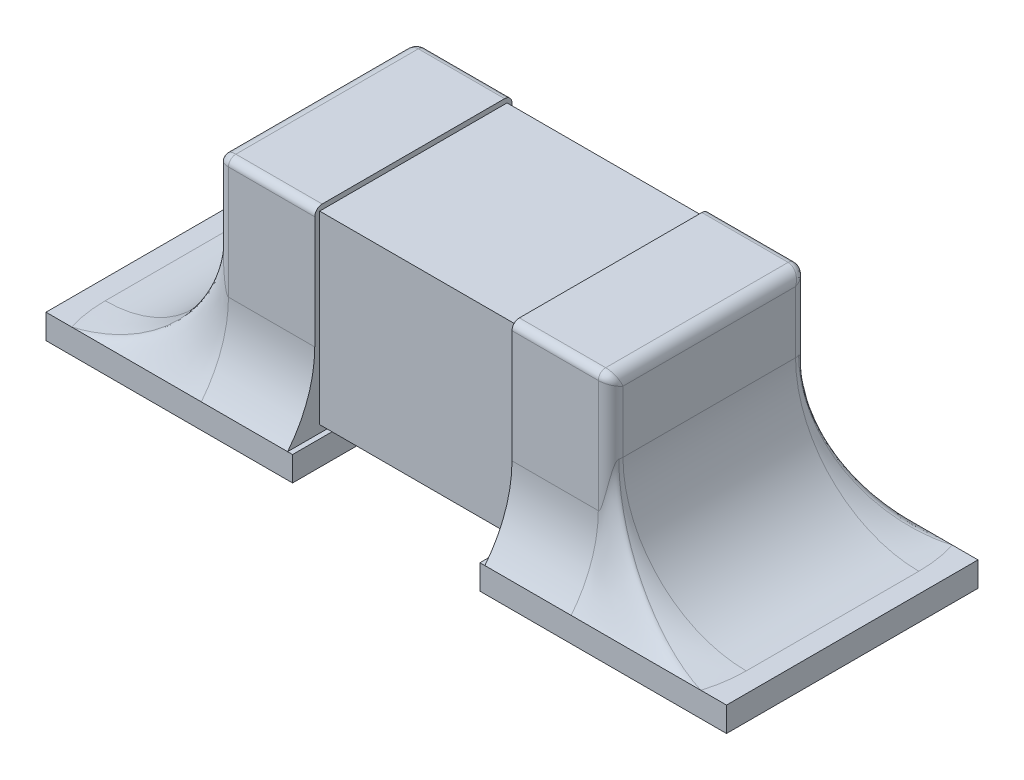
ISO-10303-21;
HEADER;
FILE_DESCRIPTION(('STEP AP214'),'2;1');
FILE_NAME('part.step','',(''),(''),'','','');
FILE_SCHEMA(('AUTOMOTIVE_DESIGN { 1 0 10303 214 1 1 1 1 }'));
ENDSEC;
DATA;
#1=APPLICATION_CONTEXT('core data for automotive mechanical design processes');
#2=APPLICATION_PROTOCOL_DEFINITION('international standard','automotive_design',2000,#1);
#3=PRODUCT_CONTEXT('',#1,'mechanical');
#4=PRODUCT('Part','Part','',(#3));
#5=PRODUCT_RELATED_PRODUCT_CATEGORY('part','',(#4));
#6=PRODUCT_DEFINITION_FORMATION('','',#4);
#7=PRODUCT_DEFINITION_CONTEXT('part definition',#1,'design');
#8=PRODUCT_DEFINITION('design','',#6,#7);
#9=PRODUCT_DEFINITION_SHAPE('','',#8);
#10=(LENGTH_UNIT() NAMED_UNIT(*) SI_UNIT(.MILLI.,.METRE.));
#11=(NAMED_UNIT(*) PLANE_ANGLE_UNIT() SI_UNIT($,.RADIAN.));
#12=(NAMED_UNIT(*) SI_UNIT($,.STERADIAN.) SOLID_ANGLE_UNIT());
#13=UNCERTAINTY_MEASURE_WITH_UNIT(LENGTH_MEASURE(1.E-05),#10,'distance_accuracy_value','');
#14=(GEOMETRIC_REPRESENTATION_CONTEXT(3) GLOBAL_UNCERTAINTY_ASSIGNED_CONTEXT((#13)) GLOBAL_UNIT_ASSIGNED_CONTEXT((#10,
#11,#12)) REPRESENTATION_CONTEXT('',''));
#15=CARTESIAN_POINT('',(0.,0.,0.));
#16=DIRECTION('',(0.,0.,1.));
#17=DIRECTION('',(1.,0.,0.));
#18=AXIS2_PLACEMENT_3D('',#15,#16,#17);
#19=CARTESIAN_POINT('',(-0.38,0.1,-0.51));
#20=DIRECTION('',(0.,1.,0.));
#21=DIRECTION('',(0.,0.,1.));
#22=AXIS2_PLACEMENT_3D('',#19,#20,#21);
#23=PLANE('',#22);
#24=DIRECTION('',(1.,0.,0.));
#25=VECTOR('',#24,1.);
#26=CARTESIAN_POINT('',(-0.38,0.1,-0.51));
#27=LINE('',#26,#25);
#28=CARTESIAN_POINT('',(-0.4,0.1,-0.51));
#29=VERTEX_POINT('',#28);
#30=CARTESIAN_POINT('',(-0.38,0.1,-0.51));
#31=VERTEX_POINT('',#30);
#32=EDGE_CURVE('E407',#29,#31,#27,.T.);
#33=ORIENTED_EDGE('',*,*,#32,.F.);
#34=DIRECTION('',(0.,0.,-1.));
#35=VECTOR('',#34,1.);
#36=CARTESIAN_POINT('',(-0.4,0.1,0.4));
#37=LINE('',#36,#35);
#38=CARTESIAN_POINT('',(-0.4,0.1,0.51));
#39=VERTEX_POINT('',#38);
#40=EDGE_CURVE('E125',#39,#29,#37,.T.);
#41=ORIENTED_EDGE('',*,*,#40,.F.);
#42=DIRECTION('',(-1.,0.,0.));
#43=VECTOR('',#42,1.);
#44=CARTESIAN_POINT('',(-0.38,0.1,0.51));
#45=LINE('',#44,#43);
#46=CARTESIAN_POINT('',(-0.38,0.1,0.51));
#47=VERTEX_POINT('',#46);
#48=EDGE_CURVE('E1360',#47,#39,#45,.T.);
#49=ORIENTED_EDGE('',*,*,#48,.F.);
#50=DIRECTION('',(0.,0.,1.));
#51=VECTOR('',#50,1.);
#52=CARTESIAN_POINT('',(-0.38,0.1,0.51));
#53=LINE('',#52,#51);
#54=EDGE_CURVE('E678',#31,#47,#53,.T.);
#55=ORIENTED_EDGE('',*,*,#54,.F.);
#56=EDGE_LOOP('',(#33,#41,#49,#55));
#57=FACE_BOUND('',#56,.T.);
#58=ADVANCED_FACE('F27',(#57),#23,.T.);
#59=CARTESIAN_POINT('',(1.38,0.1,0.51));
#60=DIRECTION('',(0.,1.,0.));
#61=DIRECTION('',(0.,0.,1.));
#62=AXIS2_PLACEMENT_3D('',#59,#60,#61);
#63=PLANE('',#62);
#64=DIRECTION('',(0.,0.,-1.));
#65=VECTOR('',#64,1.);
#66=CARTESIAN_POINT('',(0.4,0.1,0.4));
#67=LINE('',#66,#65);
#68=CARTESIAN_POINT('',(0.4,0.1,0.51));
#69=VERTEX_POINT('',#68);
#70=CARTESIAN_POINT('',(0.4,0.1,-0.51));
#71=VERTEX_POINT('',#70);
#72=EDGE_CURVE('E683',#69,#71,#67,.T.);
#73=ORIENTED_EDGE('',*,*,#72,.T.);
#74=DIRECTION('',(1.,0.,0.));
#75=VECTOR('',#74,1.);
#76=CARTESIAN_POINT('',(0.38,0.1,-0.51));
#77=LINE('',#76,#75);
#78=CARTESIAN_POINT('',(0.38,0.1,-0.51));
#79=VERTEX_POINT('',#78);
#80=EDGE_CURVE('E825',#79,#71,#77,.T.);
#81=ORIENTED_EDGE('',*,*,#80,.F.);
#82=DIRECTION('',(0.,0.,-1.));
#83=VECTOR('',#82,1.);
#84=CARTESIAN_POINT('',(0.38,0.1,0.51));
#85=LINE('',#84,#83);
#86=CARTESIAN_POINT('',(0.38,0.1,0.51));
#87=VERTEX_POINT('',#86);
#88=EDGE_CURVE('E280',#87,#79,#85,.T.);
#89=ORIENTED_EDGE('',*,*,#88,.F.);
#90=DIRECTION('',(-1.,0.,0.));
#91=VECTOR('',#90,1.);
#92=CARTESIAN_POINT('',(0.38,0.1,0.51));
#93=LINE('',#92,#91);
#94=EDGE_CURVE('E275',#69,#87,#93,.T.);
#95=ORIENTED_EDGE('',*,*,#94,.F.);
#96=EDGE_LOOP('',(#73,#81,#89,#95));
#97=FACE_BOUND('',#96,.T.);
#98=ADVANCED_FACE('F576',(#97),#63,.T.);
#99=CARTESIAN_POINT('',(0.4,0.88,0.38));
#100=DIRECTION('',(0.,0.,-1.));
#101=DIRECTION('',(0.,1.,0.));
#102=AXIS2_PLACEMENT_3D('',#99,#100,#101);
#103=PLANE('',#102);
#104=DIRECTION('',(0.,-1.,0.));
#105=VECTOR('',#104,1.);
#106=CARTESIAN_POINT('',(-0.4,0.88,0.38));
#107=LINE('',#106,#105);
#108=CARTESIAN_POINT('',(-0.4,0.88,0.38));
#109=VERTEX_POINT('',#108);
#110=CARTESIAN_POINT('',(-0.4,0.13,0.38));
#111=VERTEX_POINT('',#110);
#112=EDGE_CURVE('E735',#109,#111,#107,.T.);
#113=ORIENTED_EDGE('',*,*,#112,.T.);
#114=DIRECTION('',(-1.,0.,0.));
#115=VECTOR('',#114,1.);
#116=CARTESIAN_POINT('',(0.4,0.13,0.38));
#117=LINE('',#116,#115);
#118=CARTESIAN_POINT('',(0.4,0.13,0.38));
#119=VERTEX_POINT('',#118);
#120=EDGE_CURVE('E775',#119,#111,#117,.T.);
#121=ORIENTED_EDGE('',*,*,#120,.F.);
#122=DIRECTION('',(0.,-1.,0.));
#123=VECTOR('',#122,1.);
#124=CARTESIAN_POINT('',(0.4,0.88,0.38));
#125=LINE('',#124,#123);
#126=CARTESIAN_POINT('',(0.4,0.88,0.38));
#127=VERTEX_POINT('',#126);
#128=EDGE_CURVE('E754',#127,#119,#125,.T.);
#129=ORIENTED_EDGE('',*,*,#128,.F.);
#130=DIRECTION('',(-1.,0.,0.));
#131=VECTOR('',#130,1.);
#132=CARTESIAN_POINT('',(0.4,0.88,0.38));
#133=LINE('',#132,#131);
#134=EDGE_CURVE('E766',#127,#109,#133,.T.);
#135=ORIENTED_EDGE('',*,*,#134,.T.);
#136=EDGE_LOOP('',(#113,#121,#129,#135));
#137=FACE_BOUND('',#136,.T.);
#138=ADVANCED_FACE('F573',(#137),#103,.F.);
#139=CARTESIAN_POINT('',(0.4,0.13,0.38));
#140=DIRECTION('',(0.,1.,0.));
#141=DIRECTION('',(0.,0.,1.));
#142=AXIS2_PLACEMENT_3D('',#139,#140,#141);
#143=PLANE('',#142);
#144=DIRECTION('',(0.,0.,-1.));
#145=VECTOR('',#144,1.);
#146=CARTESIAN_POINT('',(-0.4,0.13,0.38));
#147=LINE('',#146,#145);
#148=CARTESIAN_POINT('',(-0.4,0.13,-0.38));
#149=VERTEX_POINT('',#148);
#150=EDGE_CURVE('E745',#111,#149,#147,.T.);
#151=ORIENTED_EDGE('',*,*,#150,.T.);
#152=DIRECTION('',(-1.,0.,0.));
#153=VECTOR('',#152,1.);
#154=CARTESIAN_POINT('',(0.4,0.13,-0.38));
#155=LINE('',#154,#153);
#156=CARTESIAN_POINT('',(0.4,0.13,-0.38));
#157=VERTEX_POINT('',#156);
#158=EDGE_CURVE('E772',#157,#149,#155,.T.);
#159=ORIENTED_EDGE('',*,*,#158,.F.);
#160=DIRECTION('',(0.,0.,-1.));
#161=VECTOR('',#160,1.);
#162=CARTESIAN_POINT('',(0.4,0.13,0.38));
#163=LINE('',#162,#161);
#164=EDGE_CURVE('E757',#119,#157,#163,.T.);
#165=ORIENTED_EDGE('',*,*,#164,.F.);
#166=ORIENTED_EDGE('',*,*,#120,.T.);
#167=EDGE_LOOP('',(#151,#159,#165,#166));
#168=FACE_BOUND('',#167,.T.);
#169=ADVANCED_FACE('F570',(#168),#143,.F.);
#170=CARTESIAN_POINT('',(0.4,0.88,-0.38));
#171=DIRECTION('',(0.,0.,1.));
#172=DIRECTION('',(0.,-1.,0.));
#173=AXIS2_PLACEMENT_3D('',#170,#171,#172);
#174=PLANE('',#173);
#175=DIRECTION('',(0.,1.,0.));
#176=VECTOR('',#175,1.);
#177=CARTESIAN_POINT('',(-0.4,0.88,-0.38));
#178=LINE('',#177,#176);
#179=CARTESIAN_POINT('',(-0.4,0.88,-0.38));
#180=VERTEX_POINT('',#179);
#181=EDGE_CURVE('E748',#149,#180,#178,.T.);
#182=ORIENTED_EDGE('',*,*,#181,.T.);
#183=DIRECTION('',(-1.,0.,0.));
#184=VECTOR('',#183,1.);
#185=CARTESIAN_POINT('',(0.4,0.88,-0.38));
#186=LINE('',#185,#184);
#187=CARTESIAN_POINT('',(0.4,0.88,-0.38));
#188=VERTEX_POINT('',#187);
#189=EDGE_CURVE('E769',#188,#180,#186,.T.);
#190=ORIENTED_EDGE('',*,*,#189,.F.);
#191=DIRECTION('',(0.,1.,0.));
#192=VECTOR('',#191,1.);
#193=CARTESIAN_POINT('',(0.4,0.88,-0.38));
#194=LINE('',#193,#192);
#195=EDGE_CURVE('E760',#157,#188,#194,.T.);
#196=ORIENTED_EDGE('',*,*,#195,.F.);
#197=ORIENTED_EDGE('',*,*,#158,.T.);
#198=EDGE_LOOP('',(#182,#190,#196,#197));
#199=FACE_BOUND('',#198,.T.);
#200=ADVANCED_FACE('F566',(#199),#174,.F.);
#201=CARTESIAN_POINT('',(0.4,0.88,0.38));
#202=DIRECTION('',(0.,-1.,0.));
#203=DIRECTION('',(0.,0.,-1.));
#204=AXIS2_PLACEMENT_3D('',#201,#202,#203);
#205=PLANE('',#204);
#206=DIRECTION('',(0.,0.,1.));
#207=VECTOR('',#206,1.);
#208=CARTESIAN_POINT('',(-0.4,0.88,0.38));
#209=LINE('',#208,#207);
#210=EDGE_CURVE('E751',#180,#109,#209,.T.);
#211=ORIENTED_EDGE('',*,*,#210,.T.);
#212=ORIENTED_EDGE('',*,*,#134,.F.);
#213=DIRECTION('',(0.,0.,1.));
#214=VECTOR('',#213,1.);
#215=CARTESIAN_POINT('',(0.4,0.88,0.38));
#216=LINE('',#215,#214);
#217=EDGE_CURVE('E763',#188,#127,#216,.T.);
#218=ORIENTED_EDGE('',*,*,#217,.F.);
#219=ORIENTED_EDGE('',*,*,#189,.T.);
#220=EDGE_LOOP('',(#211,#212,#218,#219));
#221=FACE_BOUND('',#220,.T.);
#222=ADVANCED_FACE('F542',(#221),#205,.F.);
#223=CARTESIAN_POINT('',(-0.4,0.87,0.37));
#224=DIRECTION('',(-1.,0.,0.));
#225=DIRECTION('',(0.,0.,1.));
#226=AXIS2_PLACEMENT_3D('',#223,#224,#225);
#227=PLANE('',#226);
#228=ORIENTED_EDGE('',*,*,#40,.T.);
#229=CARTESIAN_POINT('',(-0.4,0.41288975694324,-0.9));
#230=DIRECTION('',(-1.,0.,0.));
#231=DIRECTION('',(0.,0.,1.));
#232=AXIS2_PLACEMENT_3D('',#229,#230,#231);
#233=CIRCLE('',#232,0.5);
#234=CARTESIAN_POINT('',(-0.4,0.41288975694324,-0.4));
#235=VERTEX_POINT('',#234);
#236=EDGE_CURVE('E817',#29,#235,#233,.T.);
#237=ORIENTED_EDGE('',*,*,#236,.T.);
#238=DIRECTION('',(0.,1.,0.));
#239=VECTOR('',#238,1.);
#240=CARTESIAN_POINT('',(-0.4,0.87,-0.4));
#241=LINE('',#240,#239);
#242=CARTESIAN_POINT('',(-0.4,0.87,-0.4));
#243=VERTEX_POINT('',#242);
#244=EDGE_CURVE('E708',#235,#243,#241,.T.);
#245=ORIENTED_EDGE('',*,*,#244,.T.);
#246=CARTESIAN_POINT('',(-0.4,0.87,-0.37));
#247=DIRECTION('',(1.,0.,0.));
#248=DIRECTION('',(0.,0.,-1.));
#249=AXIS2_PLACEMENT_3D('',#246,#247,#248);
#250=CIRCLE('',#249,0.03);
#251=CARTESIAN_POINT('',(-0.4,0.9,-0.37));
#252=VERTEX_POINT('',#251);
#253=EDGE_CURVE('E719',#243,#252,#250,.T.);
#254=ORIENTED_EDGE('',*,*,#253,.T.);
#255=DIRECTION('',(0.,0.,1.));
#256=VECTOR('',#255,1.);
#257=CARTESIAN_POINT('',(-0.4,0.9,0.37));
#258=LINE('',#257,#256);
#259=CARTESIAN_POINT('',(-0.4,0.9,0.37));
#260=VERTEX_POINT('',#259);
#261=EDGE_CURVE('E722',#252,#260,#258,.T.);
#262=ORIENTED_EDGE('',*,*,#261,.T.);
#263=CARTESIAN_POINT('',(-0.4,0.87,0.37));
#264=DIRECTION('',(1.,0.,0.));
#265=DIRECTION('',(0.,0.,1.));
#266=AXIS2_PLACEMENT_3D('',#263,#264,#265);
#267=CIRCLE('',#266,0.03);
#268=CARTESIAN_POINT('',(-0.4,0.87,0.4));
#269=VERTEX_POINT('',#268);
#270=EDGE_CURVE('E725',#260,#269,#267,.T.);
#271=ORIENTED_EDGE('',*,*,#270,.T.);
#272=DIRECTION('',(0.,-1.,0.));
#273=VECTOR('',#272,1.);
#274=CARTESIAN_POINT('',(-0.4,0.87,0.4));
#275=LINE('',#274,#273);
#276=CARTESIAN_POINT('',(-0.4,0.41288975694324,0.4));
#277=VERTEX_POINT('',#276);
#278=EDGE_CURVE('E728',#269,#277,#275,.T.);
#279=ORIENTED_EDGE('',*,*,#278,.T.);
#280=CARTESIAN_POINT('',(-0.4,0.41288975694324,0.9));
#281=DIRECTION('',(-1.,0.,0.));
#282=DIRECTION('',(0.,0.,1.));
#283=AXIS2_PLACEMENT_3D('',#280,#281,#282);
#284=CIRCLE('',#283,0.5);
#285=EDGE_CURVE('E11',#277,#39,#284,.T.);
#286=ORIENTED_EDGE('',*,*,#285,.T.);
#287=EDGE_LOOP('',(#228,#237,#245,#254,#262,#271,#279,#286));
#288=FACE_BOUND('',#287,.T.);
#289=ORIENTED_EDGE('',*,*,#150,.F.);
#290=ORIENTED_EDGE('',*,*,#112,.F.);
#291=ORIENTED_EDGE('',*,*,#210,.F.);
#292=ORIENTED_EDGE('',*,*,#181,.F.);
#293=EDGE_LOOP('',(#289,#290,#291,#292));
#294=FACE_BOUND('',#293,.T.);
#295=ADVANCED_FACE('F538',(#288,#294),#227,.F.);
#296=CARTESIAN_POINT('',(-0.8,0.87,-0.4));
#297=DIRECTION('',(0.,0.,-1.));
#298=DIRECTION('',(0.,1.,0.));
#299=AXIS2_PLACEMENT_3D('',#296,#297,#298);
#300=PLANE('',#299);
#301=ORIENTED_EDGE('',*,*,#244,.F.);
#302=DIRECTION('',(-1.,0.,0.));
#303=VECTOR('',#302,1.);
#304=CARTESIAN_POINT('',(-0.75,0.41288975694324,-0.4));
#305=LINE('',#304,#303);
#306=CARTESIAN_POINT('',(-0.749999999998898,0.412889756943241,-0.4));
#307=VERTEX_POINT('',#306);
#308=EDGE_CURVE('E390',#235,#307,#305,.T.);
#309=ORIENTED_EDGE('',*,*,#308,.T.);
#310=DIRECTION('',(0.,1.,0.));
#311=VECTOR('',#310,1.);
#312=CARTESIAN_POINT('',(-0.75,0.87,-0.4));
#313=LINE('',#312,#311);
#314=CARTESIAN_POINT('',(-0.75,0.87,-0.4));
#315=VERTEX_POINT('',#314);
#316=EDGE_CURVE('E168',#307,#315,#313,.T.);
#317=ORIENTED_EDGE('',*,*,#316,.T.);
#318=DIRECTION('',(1.,0.,0.));
#319=VECTOR('',#318,1.);
#320=CARTESIAN_POINT('',(-0.8,0.87,-0.4));
#321=LINE('',#320,#319);
#322=EDGE_CURVE('E731',#315,#243,#321,.T.);
#323=ORIENTED_EDGE('',*,*,#322,.T.);
#324=EDGE_LOOP('',(#301,#309,#317,#323));
#325=FACE_BOUND('',#324,.T.);
#326=ADVANCED_FACE('F541',(#325),#300,.T.);
#327=CARTESIAN_POINT('',(-0.8,0.87,0.4));
#328=DIRECTION('',(0.,0.,1.));
#329=DIRECTION('',(0.,-1.,0.));
#330=AXIS2_PLACEMENT_3D('',#327,#328,#329);
#331=PLANE('',#330);
#332=DIRECTION('',(0.,-1.,0.));
#333=VECTOR('',#332,1.);
#334=CARTESIAN_POINT('',(-0.75,0.87,0.4));
#335=LINE('',#334,#333);
#336=CARTESIAN_POINT('',(-0.75,0.87,0.4));
#337=VERTEX_POINT('',#336);
#338=CARTESIAN_POINT('',(-0.75,0.41288975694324,0.4));
#339=VERTEX_POINT('',#338);
#340=EDGE_CURVE('E306',#337,#339,#335,.T.);
#341=ORIENTED_EDGE('',*,*,#340,.T.);
#342=DIRECTION('',(1.,0.,0.));
#343=VECTOR('',#342,1.);
#344=CARTESIAN_POINT('',(-0.4,0.41288975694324,0.4));
#345=LINE('',#344,#343);
#346=EDGE_CURVE('E50',#339,#277,#345,.T.);
#347=ORIENTED_EDGE('',*,*,#346,.T.);
#348=ORIENTED_EDGE('',*,*,#278,.F.);
#349=DIRECTION('',(1.,0.,0.));
#350=VECTOR('',#349,1.);
#351=CARTESIAN_POINT('',(-0.8,0.87,0.4));
#352=LINE('',#351,#350);
#353=EDGE_CURVE('E732',#337,#269,#352,.T.);
#354=ORIENTED_EDGE('',*,*,#353,.F.);
#355=EDGE_LOOP('',(#341,#347,#348,#354));
#356=FACE_BOUND('',#355,.T.);
#357=ADVANCED_FACE('F547',(#356),#331,.T.);
#358=CARTESIAN_POINT('',(-0.8,0.87,0.37));
#359=DIRECTION('',(1.,0.,0.));
#360=DIRECTION('',(0.,0.,-1.));
#361=AXIS2_PLACEMENT_3D('',#358,#359,#360);
#362=CYLINDRICAL_SURFACE('',#361,0.03);
#363=DIRECTION('',(1.,0.,0.));
#364=VECTOR('',#363,1.);
#365=CARTESIAN_POINT('',(-0.8,0.9,0.37));
#366=LINE('',#365,#364);
#367=CARTESIAN_POINT('',(-0.75,0.9,0.37));
#368=VERTEX_POINT('',#367);
#369=EDGE_CURVE('E736',#368,#260,#366,.T.);
#370=ORIENTED_EDGE('',*,*,#369,.F.);
#371=CARTESIAN_POINT('',(-0.75,0.87,0.37));
#372=DIRECTION('',(1.,0.,0.));
#373=DIRECTION('',(0.,0.,-1.));
#374=AXIS2_PLACEMENT_3D('',#371,#372,#373);
#375=CIRCLE('',#374,0.03);
#376=EDGE_CURVE('E307',#368,#337,#375,.T.);
#377=ORIENTED_EDGE('',*,*,#376,.T.);
#378=ORIENTED_EDGE('',*,*,#353,.T.);
#379=ORIENTED_EDGE('',*,*,#270,.F.);
#380=EDGE_LOOP('',(#370,#377,#378,#379));
#381=FACE_BOUND('',#380,.T.);
#382=ADVANCED_FACE('F550',(#381),#362,.T.);
#383=CARTESIAN_POINT('',(-0.8,0.9,0.37));
#384=DIRECTION('',(0.,1.,0.));
#385=DIRECTION('',(0.,0.,1.));
#386=AXIS2_PLACEMENT_3D('',#383,#384,#385);
#387=PLANE('',#386);
#388=DIRECTION('',(1.,0.,0.));
#389=VECTOR('',#388,1.);
#390=CARTESIAN_POINT('',(-0.8,0.9,-0.37));
#391=LINE('',#390,#389);
#392=CARTESIAN_POINT('',(-0.75,0.9,-0.37));
#393=VERTEX_POINT('',#392);
#394=EDGE_CURVE('E739',#393,#252,#391,.T.);
#395=ORIENTED_EDGE('',*,*,#394,.F.);
#396=DIRECTION('',(0.,0.,1.));
#397=VECTOR('',#396,1.);
#398=CARTESIAN_POINT('',(-0.75,0.9,0.37));
#399=LINE('',#398,#397);
#400=EDGE_CURVE('E801',#393,#368,#399,.T.);
#401=ORIENTED_EDGE('',*,*,#400,.T.);
#402=ORIENTED_EDGE('',*,*,#369,.T.);
#403=ORIENTED_EDGE('',*,*,#261,.F.);
#404=EDGE_LOOP('',(#395,#401,#402,#403));
#405=FACE_BOUND('',#404,.T.);
#406=ADVANCED_FACE('F553',(#405),#387,.T.);
#407=CARTESIAN_POINT('',(-0.8,0.87,-0.37));
#408=DIRECTION('',(1.,0.,0.));
#409=DIRECTION('',(0.,0.,-1.));
#410=AXIS2_PLACEMENT_3D('',#407,#408,#409);
#411=CYLINDRICAL_SURFACE('',#410,0.03);
#412=ORIENTED_EDGE('',*,*,#322,.F.);
#413=CARTESIAN_POINT('',(-0.75,0.87,-0.37));
#414=DIRECTION('',(1.,0.,0.));
#415=DIRECTION('',(0.,0.,-1.));
#416=AXIS2_PLACEMENT_3D('',#413,#414,#415);
#417=CIRCLE('',#416,0.03);
#418=EDGE_CURVE('E798',#315,#393,#417,.T.);
#419=ORIENTED_EDGE('',*,*,#418,.T.);
#420=ORIENTED_EDGE('',*,*,#394,.T.);
#421=ORIENTED_EDGE('',*,*,#253,.F.);
#422=EDGE_LOOP('',(#412,#419,#420,#421));
#423=FACE_BOUND('',#422,.T.);
#424=ADVANCED_FACE('F546',(#423),#411,.T.);
#425=CARTESIAN_POINT('',(-0.8,0.87,0.37));
#426=DIRECTION('',(-1.,0.,0.));
#427=DIRECTION('',(0.,0.,1.));
#428=AXIS2_PLACEMENT_3D('',#425,#426,#427);
#429=PLANE('',#428);
#430=DIRECTION('',(0.,1.,0.));
#431=VECTOR('',#430,1.);
#432=CARTESIAN_POINT('',(-0.8,0.87,-0.35));
#433=LINE('',#432,#431);
#434=CARTESIAN_POINT('',(-0.8,0.85,-0.35));
#435=VERTEX_POINT('',#434);
#436=CARTESIAN_POINT('',(-0.8,0.6,-0.35));
#437=VERTEX_POINT('',#436);
#438=EDGE_CURVE('E149',#435,#437,#433,.F.);
#439=ORIENTED_EDGE('',*,*,#438,.T.);
#440=DIRECTION('',(0.,0.,-1.));
#441=VECTOR('',#440,1.);
#442=CARTESIAN_POINT('',(-0.8,0.6,0.35));
#443=LINE('',#442,#441);
#444=CARTESIAN_POINT('',(-0.8,0.6,0.35));
#445=VERTEX_POINT('',#444);
#446=EDGE_CURVE('E141',#437,#445,#443,.F.);
#447=ORIENTED_EDGE('',*,*,#446,.T.);
#448=DIRECTION('',(0.,-1.,0.));
#449=VECTOR('',#448,1.);
#450=CARTESIAN_POINT('',(-0.8,0.87,0.35));
#451=LINE('',#450,#449);
#452=CARTESIAN_POINT('',(-0.8,0.85,0.35));
#453=VERTEX_POINT('',#452);
#454=EDGE_CURVE('E146',#445,#453,#451,.F.);
#455=ORIENTED_EDGE('',*,*,#454,.T.);
#456=DIRECTION('',(0.,0.,1.));
#457=VECTOR('',#456,1.);
#458=CARTESIAN_POINT('',(-0.8,0.85,0.37));
#459=LINE('',#458,#457);
#460=EDGE_CURVE('E167',#453,#435,#459,.F.);
#461=ORIENTED_EDGE('',*,*,#460,.T.);
#462=EDGE_LOOP('',(#439,#447,#455,#461));
#463=FACE_BOUND('',#462,.T.);
#464=ADVANCED_FACE('F143',(#463),#429,.T.);
#465=CARTESIAN_POINT('',(0.4,0.87,0.37));
#466=DIRECTION('',(1.,0.,0.));
#467=DIRECTION('',(0.,0.,1.));
#468=AXIS2_PLACEMENT_3D('',#465,#466,#467);
#469=PLANE('',#468);
#470=DIRECTION('',(0.,1.,0.));
#471=VECTOR('',#470,1.);
#472=CARTESIAN_POINT('',(0.4,0.87,-0.4));
#473=LINE('',#472,#471);
#474=CARTESIAN_POINT('',(0.4,0.412889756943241,-0.4));
#475=VERTEX_POINT('',#474);
#476=CARTESIAN_POINT('',(0.4,0.87,-0.4));
#477=VERTEX_POINT('',#476);
#478=EDGE_CURVE('E679',#475,#477,#473,.T.);
#479=ORIENTED_EDGE('',*,*,#478,.F.);
#480=CARTESIAN_POINT('',(0.4,0.412889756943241,-0.9));
#481=DIRECTION('',(1.,0.,0.));
#482=DIRECTION('',(0.,0.,-1.));
#483=AXIS2_PLACEMENT_3D('',#480,#481,#482);
#484=CIRCLE('',#483,0.5);
#485=EDGE_CURVE('E814',#475,#71,#484,.T.);
#486=ORIENTED_EDGE('',*,*,#485,.T.);
#487=ORIENTED_EDGE('',*,*,#72,.F.);
#488=CARTESIAN_POINT('',(0.4,0.41288975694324,0.9));
#489=DIRECTION('',(1.,0.,0.));
#490=DIRECTION('',(0.,0.,-1.));
#491=AXIS2_PLACEMENT_3D('',#488,#489,#490);
#492=CIRCLE('',#491,0.5);
#493=CARTESIAN_POINT('',(0.4,0.41288975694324,0.4));
#494=VERTEX_POINT('',#493);
#495=EDGE_CURVE('E41',#69,#494,#492,.T.);
#496=ORIENTED_EDGE('',*,*,#495,.T.);
#497=DIRECTION('',(0.,-1.,0.));
#498=VECTOR('',#497,1.);
#499=CARTESIAN_POINT('',(0.4,0.87,0.4));
#500=LINE('',#499,#498);
#501=CARTESIAN_POINT('',(0.4,0.87,0.4));
#502=VERTEX_POINT('',#501);
#503=EDGE_CURVE('E692',#502,#494,#500,.T.);
#504=ORIENTED_EDGE('',*,*,#503,.F.);
#505=CARTESIAN_POINT('',(0.4,0.87,0.37));
#506=DIRECTION('',(1.,0.,0.));
#507=DIRECTION('',(0.,0.,1.));
#508=AXIS2_PLACEMENT_3D('',#505,#506,#507);
#509=CIRCLE('',#508,0.03);
#510=CARTESIAN_POINT('',(0.4,0.9,0.37));
#511=VERTEX_POINT('',#510);
#512=EDGE_CURVE('E695',#511,#502,#509,.T.);
#513=ORIENTED_EDGE('',*,*,#512,.F.);
#514=DIRECTION('',(0.,0.,1.));
#515=VECTOR('',#514,1.);
#516=CARTESIAN_POINT('',(0.4,0.9,0.37));
#517=LINE('',#516,#515);
#518=CARTESIAN_POINT('',(0.4,0.9,-0.37));
#519=VERTEX_POINT('',#518);
#520=EDGE_CURVE('E698',#519,#511,#517,.T.);
#521=ORIENTED_EDGE('',*,*,#520,.F.);
#522=CARTESIAN_POINT('',(0.4,0.87,-0.37));
#523=DIRECTION('',(1.,0.,0.));
#524=DIRECTION('',(0.,0.,-1.));
#525=AXIS2_PLACEMENT_3D('',#522,#523,#524);
#526=CIRCLE('',#525,0.03);
#527=EDGE_CURVE('E701',#477,#519,#526,.T.);
#528=ORIENTED_EDGE('',*,*,#527,.F.);
#529=EDGE_LOOP('',(#479,#486,#487,#496,#504,#513,#521,#528));
#530=FACE_BOUND('',#529,.T.);
#531=ORIENTED_EDGE('',*,*,#217,.T.);
#532=ORIENTED_EDGE('',*,*,#128,.T.);
#533=ORIENTED_EDGE('',*,*,#164,.T.);
#534=ORIENTED_EDGE('',*,*,#195,.T.);
#535=EDGE_LOOP('',(#531,#532,#533,#534));
#536=FACE_BOUND('',#535,.T.);
#537=ADVANCED_FACE('F510',(#530,#536),#469,.F.);
#538=CARTESIAN_POINT('',(0.8,0.87,-0.4));
#539=DIRECTION('',(0.,0.,1.));
#540=DIRECTION('',(0.,-1.,0.));
#541=AXIS2_PLACEMENT_3D('',#538,#539,#540);
#542=PLANE('',#541);
#543=DIRECTION('',(0.,1.,0.));
#544=VECTOR('',#543,1.);
#545=CARTESIAN_POINT('',(0.75,0.1,-0.4));
#546=LINE('',#545,#544);
#547=CARTESIAN_POINT('',(0.75,0.87,-0.4));
#548=VERTEX_POINT('',#547);
#549=CARTESIAN_POINT('',(0.75,0.412889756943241,-0.4));
#550=VERTEX_POINT('',#549);
#551=EDGE_CURVE('E787',#548,#550,#546,.F.);
#552=ORIENTED_EDGE('',*,*,#551,.T.);
#553=DIRECTION('',(1.,0.,0.));
#554=VECTOR('',#553,1.);
#555=CARTESIAN_POINT('',(0.8,0.412889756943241,-0.4));
#556=LINE('',#555,#554);
#557=EDGE_CURVE('E840',#550,#475,#556,.F.);
#558=ORIENTED_EDGE('',*,*,#557,.T.);
#559=ORIENTED_EDGE('',*,*,#478,.T.);
#560=DIRECTION('',(-1.,0.,0.));
#561=VECTOR('',#560,1.);
#562=CARTESIAN_POINT('',(0.8,0.87,-0.4));
#563=LINE('',#562,#561);
#564=EDGE_CURVE('E705',#548,#477,#563,.T.);
#565=ORIENTED_EDGE('',*,*,#564,.F.);
#566=EDGE_LOOP('',(#552,#558,#559,#565));
#567=FACE_BOUND('',#566,.T.);
#568=ADVANCED_FACE('F513',(#567),#542,.F.);
#569=CARTESIAN_POINT('',(0.8,0.87,-0.37));
#570=DIRECTION('',(-1.,0.,0.));
#571=DIRECTION('',(0.,0.,1.));
#572=AXIS2_PLACEMENT_3D('',#569,#570,#571);
#573=CYLINDRICAL_SURFACE('',#572,0.03);
#574=DIRECTION('',(-1.,0.,0.));
#575=VECTOR('',#574,1.);
#576=CARTESIAN_POINT('',(0.8,0.9,-0.37));
#577=LINE('',#576,#575);
#578=CARTESIAN_POINT('',(0.75,0.9,-0.37));
#579=VERTEX_POINT('',#578);
#580=EDGE_CURVE('E709',#579,#519,#577,.T.);
#581=ORIENTED_EDGE('',*,*,#580,.F.);
#582=CARTESIAN_POINT('',(0.75,0.87,-0.37));
#583=DIRECTION('',(-1.,0.,0.));
#584=DIRECTION('',(0.,0.,1.));
#585=AXIS2_PLACEMENT_3D('',#582,#583,#584);
#586=CIRCLE('',#585,0.03);
#587=EDGE_CURVE('E788',#579,#548,#586,.T.);
#588=ORIENTED_EDGE('',*,*,#587,.T.);
#589=ORIENTED_EDGE('',*,*,#564,.T.);
#590=ORIENTED_EDGE('',*,*,#527,.T.);
#591=EDGE_LOOP('',(#581,#588,#589,#590));
#592=FACE_BOUND('',#591,.T.);
#593=ADVANCED_FACE('F520',(#592),#573,.T.);
#594=CARTESIAN_POINT('',(0.8,0.9,0.37));
#595=DIRECTION('',(0.,-1.,0.));
#596=DIRECTION('',(0.,0.,-1.));
#597=AXIS2_PLACEMENT_3D('',#594,#595,#596);
#598=PLANE('',#597);
#599=DIRECTION('',(-1.,0.,0.));
#600=VECTOR('',#599,1.);
#601=CARTESIAN_POINT('',(0.8,0.9,0.37));
#602=LINE('',#601,#600);
#603=CARTESIAN_POINT('',(0.75,0.9,0.37));
#604=VERTEX_POINT('',#603);
#605=EDGE_CURVE('E712',#604,#511,#602,.T.);
#606=ORIENTED_EDGE('',*,*,#605,.F.);
#607=DIRECTION('',(0.,0.,1.));
#608=VECTOR('',#607,1.);
#609=CARTESIAN_POINT('',(0.75,0.9,-0.37));
#610=LINE('',#609,#608);
#611=EDGE_CURVE('E791',#604,#579,#610,.F.);
#612=ORIENTED_EDGE('',*,*,#611,.T.);
#613=ORIENTED_EDGE('',*,*,#580,.T.);
#614=ORIENTED_EDGE('',*,*,#520,.T.);
#615=EDGE_LOOP('',(#606,#612,#613,#614));
#616=FACE_BOUND('',#615,.T.);
#617=ADVANCED_FACE('F523',(#616),#598,.F.);
#618=CARTESIAN_POINT('',(0.8,0.87,0.37));
#619=DIRECTION('',(-1.,0.,0.));
#620=DIRECTION('',(0.,0.,1.));
#621=AXIS2_PLACEMENT_3D('',#618,#619,#620);
#622=CYLINDRICAL_SURFACE('',#621,0.03);
#623=DIRECTION('',(-1.,0.,0.));
#624=VECTOR('',#623,1.);
#625=CARTESIAN_POINT('',(0.8,0.87,0.4));
#626=LINE('',#625,#624);
#627=CARTESIAN_POINT('',(0.75,0.87,0.4));
#628=VERTEX_POINT('',#627);
#629=EDGE_CURVE('E704',#628,#502,#626,.T.);
#630=ORIENTED_EDGE('',*,*,#629,.F.);
#631=CARTESIAN_POINT('',(0.75,0.87,0.37));
#632=DIRECTION('',(-1.,0.,0.));
#633=DIRECTION('',(0.,0.,1.));
#634=AXIS2_PLACEMENT_3D('',#631,#632,#633);
#635=CIRCLE('',#634,0.03);
#636=EDGE_CURVE('E399',#628,#604,#635,.T.);
#637=ORIENTED_EDGE('',*,*,#636,.T.);
#638=ORIENTED_EDGE('',*,*,#605,.T.);
#639=ORIENTED_EDGE('',*,*,#512,.T.);
#640=EDGE_LOOP('',(#630,#637,#638,#639));
#641=FACE_BOUND('',#640,.T.);
#642=ADVANCED_FACE('F527',(#641),#622,.T.);
#643=CARTESIAN_POINT('',(0.8,0.87,0.4));
#644=DIRECTION('',(0.,0.,-1.));
#645=DIRECTION('',(0.,1.,0.));
#646=AXIS2_PLACEMENT_3D('',#643,#644,#645);
#647=PLANE('',#646);
#648=ORIENTED_EDGE('',*,*,#503,.T.);
#649=DIRECTION('',(-1.,0.,0.));
#650=VECTOR('',#649,1.);
#651=CARTESIAN_POINT('',(0.8,0.41288975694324,0.4));
#652=LINE('',#651,#650);
#653=CARTESIAN_POINT('',(0.75,0.41288975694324,0.4));
#654=VERTEX_POINT('',#653);
#655=EDGE_CURVE('E180',#494,#654,#652,.F.);
#656=ORIENTED_EDGE('',*,*,#655,.T.);
#657=DIRECTION('',(0.,-1.,0.));
#658=VECTOR('',#657,1.);
#659=CARTESIAN_POINT('',(0.75,0.87,0.4));
#660=LINE('',#659,#658);
#661=EDGE_CURVE('E303',#654,#628,#660,.F.);
#662=ORIENTED_EDGE('',*,*,#661,.T.);
#663=ORIENTED_EDGE('',*,*,#629,.T.);
#664=EDGE_LOOP('',(#648,#656,#662,#663));
#665=FACE_BOUND('',#664,.T.);
#666=ADVANCED_FACE('F518',(#665),#647,.F.);
#667=CARTESIAN_POINT('',(0.8,0.87,0.37));
#668=DIRECTION('',(1.,0.,0.));
#669=DIRECTION('',(0.,0.,1.));
#670=AXIS2_PLACEMENT_3D('',#667,#668,#669);
#671=PLANE('',#670);
#672=DIRECTION('',(0.,-1.,0.));
#673=VECTOR('',#672,1.);
#674=CARTESIAN_POINT('',(0.8,0.1,0.35));
#675=LINE('',#674,#673);
#676=CARTESIAN_POINT('',(0.8,0.85,0.35));
#677=VERTEX_POINT('',#676);
#678=CARTESIAN_POINT('',(0.8,0.6,0.35));
#679=VERTEX_POINT('',#678);
#680=EDGE_CURVE('E778',#677,#679,#675,.T.);
#681=ORIENTED_EDGE('',*,*,#680,.T.);
#682=DIRECTION('',(0.,0.,-1.));
#683=VECTOR('',#682,1.);
#684=CARTESIAN_POINT('',(0.8,0.6,-0.35));
#685=LINE('',#684,#683);
#686=CARTESIAN_POINT('',(0.8,0.6,-0.35));
#687=VERTEX_POINT('',#686);
#688=EDGE_CURVE('E297',#679,#687,#685,.T.);
#689=ORIENTED_EDGE('',*,*,#688,.T.);
#690=DIRECTION('',(0.,1.,0.));
#691=VECTOR('',#690,1.);
#692=CARTESIAN_POINT('',(0.8,0.87,-0.35));
#693=LINE('',#692,#691);
#694=CARTESIAN_POINT('',(0.8,0.85,-0.35));
#695=VERTEX_POINT('',#694);
#696=EDGE_CURVE('E784',#687,#695,#693,.T.);
#697=ORIENTED_EDGE('',*,*,#696,.T.);
#698=DIRECTION('',(0.,0.,1.));
#699=VECTOR('',#698,1.);
#700=CARTESIAN_POINT('',(0.8,0.85,0.37));
#701=LINE('',#700,#699);
#702=EDGE_CURVE('E781',#695,#677,#701,.T.);
#703=ORIENTED_EDGE('',*,*,#702,.T.);
#704=EDGE_LOOP('',(#681,#689,#697,#703));
#705=FACE_BOUND('',#704,.T.);
#706=ADVANCED_FACE('F515',(#705),#671,.T.);
#707=DIRECTION('',(0.,0.,-1.));
#708=VECTOR('',#707,1.);
#709=CARTESIAN_POINT('',(-1.3,0.1,-0.35));
#710=LINE('',#709,#708);
#711=CARTESIAN_POINT('',(-1.3,0.1,0.35));
#712=VERTEX_POINT('',#711);
#713=CARTESIAN_POINT('',(-1.3,0.1,-0.350000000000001));
#714=VERTEX_POINT('',#713);
#715=EDGE_CURVE('E183',#712,#714,#710,.T.);
#716=ORIENTED_EDGE('',*,*,#715,.T.);
#717=CARTESIAN_POINT('',(-0.75,0.1,-0.35));
#718=DIRECTION('',(0.,1.,0.));
#719=DIRECTION('',(0.,0.,1.));
#720=AXIS2_PLACEMENT_3D('',#717,#718,#719);
#721=CIRCLE('',#720,0.55);
#722=CARTESIAN_POINT('',(-1.27621288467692,0.1,-0.51));
#723=VERTEX_POINT('',#722);
#724=EDGE_CURVE('E394',#714,#723,#721,.F.);
#725=ORIENTED_EDGE('',*,*,#724,.T.);
#726=CARTESIAN_POINT('',(-1.38,0.1,-0.51));
#727=VERTEX_POINT('',#726);
#728=EDGE_CURVE('E419',#727,#723,#27,.T.);
#729=ORIENTED_EDGE('',*,*,#728,.F.);
#730=DIRECTION('',(0.,0.,-1.));
#731=VECTOR('',#730,1.);
#732=CARTESIAN_POINT('',(-1.38,0.1,0.51));
#733=LINE('',#732,#731);
#734=CARTESIAN_POINT('',(-1.38,0.1,0.51));
#735=VERTEX_POINT('',#734);
#736=EDGE_CURVE('E413',#735,#727,#733,.T.);
#737=ORIENTED_EDGE('',*,*,#736,.F.);
#738=CARTESIAN_POINT('',(-1.27621288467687,0.0999999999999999,0.51));
#739=VERTEX_POINT('',#738);
#740=EDGE_CURVE('E1358',#739,#735,#45,.T.);
#741=ORIENTED_EDGE('',*,*,#740,.F.);
#742=CARTESIAN_POINT('',(-0.75,0.1,0.35));
#743=DIRECTION('',(0.,1.,0.));
#744=DIRECTION('',(0.,0.,1.));
#745=AXIS2_PLACEMENT_3D('',#742,#743,#744);
#746=CIRCLE('',#745,0.55);
#747=EDGE_CURVE('E595',#739,#712,#746,.F.);
#748=ORIENTED_EDGE('',*,*,#747,.T.);
#749=EDGE_LOOP('',(#716,#725,#729,#737,#741,#748));
#750=FACE_BOUND('',#749,.T.);
#751=ADVANCED_FACE('F508',(#750),#23,.T.);
#752=CARTESIAN_POINT('',(-0.38,0.,0.51));
#753=DIRECTION('',(-1.,0.,0.));
#754=DIRECTION('',(0.,0.,1.));
#755=AXIS2_PLACEMENT_3D('',#752,#753,#754);
#756=PLANE('',#755);
#757=ORIENTED_EDGE('',*,*,#54,.T.);
#758=DIRECTION('',(0.,1.,0.));
#759=VECTOR('',#758,1.);
#760=CARTESIAN_POINT('',(-0.38,0.,0.51));
#761=LINE('',#760,#759);
#762=CARTESIAN_POINT('',(-0.38,0.,0.51));
#763=VERTEX_POINT('',#762);
#764=EDGE_CURVE('E675',#763,#47,#761,.T.);
#765=ORIENTED_EDGE('',*,*,#764,.F.);
#766=DIRECTION('',(0.,0.,1.));
#767=VECTOR('',#766,1.);
#768=CARTESIAN_POINT('',(-0.38,0.,0.51));
#769=LINE('',#768,#767);
#770=CARTESIAN_POINT('',(-0.38,0.,-0.51));
#771=VERTEX_POINT('',#770);
#772=EDGE_CURVE('E415',#771,#763,#769,.T.);
#773=ORIENTED_EDGE('',*,*,#772,.F.);
#774=DIRECTION('',(0.,1.,0.));
#775=VECTOR('',#774,1.);
#776=CARTESIAN_POINT('',(-0.38,0.,-0.51));
#777=LINE('',#776,#775);
#778=EDGE_CURVE('E1121',#771,#31,#777,.T.);
#779=ORIENTED_EDGE('',*,*,#778,.T.);
#780=EDGE_LOOP('',(#757,#765,#773,#779));
#781=FACE_BOUND('',#780,.T.);
#782=ADVANCED_FACE('F504',(#781),#756,.F.);
#783=CARTESIAN_POINT('',(-0.38,0.,0.51));
#784=DIRECTION('',(0.,0.,-1.));
#785=DIRECTION('',(-1.,0.,0.));
#786=AXIS2_PLACEMENT_3D('',#783,#784,#785);
#787=PLANE('',#786);
#788=ORIENTED_EDGE('',*,*,#48,.T.);
#789=CARTESIAN_POINT('',(-0.75,0.0999999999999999,0.51));
#790=VERTEX_POINT('',#789);
#791=EDGE_CURVE('E117',#39,#790,#45,.T.);
#792=ORIENTED_EDGE('',*,*,#791,.T.);
#793=CARTESIAN_POINT('',(-1.27621288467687,0.0999999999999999,0.51));
#794=CARTESIAN_POINT('',(-1.08986160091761,0.100000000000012,0.51));
#795=CARTESIAN_POINT('',(-1.02817413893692,0.0999999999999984,0.51));
#796=CARTESIAN_POINT('',(-0.925718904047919,0.100000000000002,0.51));
#797=CARTESIAN_POINT('',(-0.894934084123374,0.100000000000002,0.510000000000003));
#798=CARTESIAN_POINT('',(-0.81588138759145,0.0999999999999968,0.509999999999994));
#799=CARTESIAN_POINT('',(-0.785074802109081,0.100000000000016,0.509999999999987));
#800=CARTESIAN_POINT('',(-0.75,0.0999999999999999,0.51));
#801=(BOUNDED_CURVE() B_SPLINE_CURVE(3,(#793,#794,#795,#796,#797,#798,#799,#800),.UNSPECIFIED.,
.F.,.F.) B_SPLINE_CURVE_WITH_KNOTS((4,2,2,4),(3.14159265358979,3.46049751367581,
3.77940237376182,4.41721209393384),
.UNSPECIFIED.) CURVE() GEOMETRIC_REPRESENTATION_ITEM() RATIONAL_B_SPLINE_CURVE((1.,1.,1.,1.,1.,
1.,1.,1.)) REPRESENTATION_ITEM(''));
#802=EDGE_CURVE('E489',#790,#739,#801,.F.);
#803=ORIENTED_EDGE('',*,*,#802,.T.);
#804=ORIENTED_EDGE('',*,*,#740,.T.);
#805=DIRECTION('',(0.,1.,0.));
#806=VECTOR('',#805,1.);
#807=CARTESIAN_POINT('',(-1.38,0.,0.51));
#808=LINE('',#807,#806);
#809=CARTESIAN_POINT('',(-1.38,0.,0.51));
#810=VERTEX_POINT('',#809);
#811=EDGE_CURVE('E680',#810,#735,#808,.T.);
#812=ORIENTED_EDGE('',*,*,#811,.F.);
#813=DIRECTION('',(-1.,0.,0.));
#814=VECTOR('',#813,1.);
#815=CARTESIAN_POINT('',(-0.38,0.,0.51));
#816=LINE('',#815,#814);
#817=EDGE_CURVE('E664',#763,#810,#816,.T.);
#818=ORIENTED_EDGE('',*,*,#817,.F.);
#819=ORIENTED_EDGE('',*,*,#764,.T.);
#820=EDGE_LOOP('',(#788,#792,#803,#804,#812,#818,#819));
#821=FACE_BOUND('',#820,.T.);
#822=ADVANCED_FACE('F493',(#821),#787,.F.);
#823=CARTESIAN_POINT('',(-1.38,0.,0.51));
#824=DIRECTION('',(1.,0.,0.));
#825=DIRECTION('',(0.,0.,-1.));
#826=AXIS2_PLACEMENT_3D('',#823,#824,#825);
#827=PLANE('',#826);
#828=ORIENTED_EDGE('',*,*,#736,.T.);
#829=DIRECTION('',(0.,1.,0.));
#830=VECTOR('',#829,1.);
#831=CARTESIAN_POINT('',(-1.38,0.,-0.51));
#832=LINE('',#831,#830);
#833=CARTESIAN_POINT('',(-1.38,0.,-0.51));
#834=VERTEX_POINT('',#833);
#835=EDGE_CURVE('E686',#834,#727,#832,.T.);
#836=ORIENTED_EDGE('',*,*,#835,.F.);
#837=DIRECTION('',(0.,0.,-1.));
#838=VECTOR('',#837,1.);
#839=CARTESIAN_POINT('',(-1.38,0.,0.51));
#840=LINE('',#839,#838);
#841=EDGE_CURVE('E1119',#810,#834,#840,.T.);
#842=ORIENTED_EDGE('',*,*,#841,.F.);
#843=ORIENTED_EDGE('',*,*,#811,.T.);
#844=EDGE_LOOP('',(#828,#836,#842,#843));
#845=FACE_BOUND('',#844,.T.);
#846=ADVANCED_FACE('F503',(#845),#827,.F.);
#847=CARTESIAN_POINT('',(-0.38,0.,-0.51));
#848=DIRECTION('',(0.,0.,1.));
#849=DIRECTION('',(1.,0.,0.));
#850=AXIS2_PLACEMENT_3D('',#847,#848,#849);
#851=PLANE('',#850);
#852=ORIENTED_EDGE('',*,*,#728,.T.);
#853=CARTESIAN_POINT('',(-0.749999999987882,0.1,-0.51));
#854=CARTESIAN_POINT('',(-0.785074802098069,0.0999999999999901,-0.51));
#855=CARTESIAN_POINT('',(-0.815881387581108,0.1,-0.509999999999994));
#856=CARTESIAN_POINT('',(-0.894934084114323,0.1,-0.510000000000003));
#857=CARTESIAN_POINT('',(-0.925718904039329,0.1,-0.51));
#858=CARTESIAN_POINT('',(-1.02817413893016,0.1,-0.51));
#859=CARTESIAN_POINT('',(-1.08986160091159,0.0999999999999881,-0.51));
#860=CARTESIAN_POINT('',(-1.27621288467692,0.1,-0.51));
#861=(BOUNDED_CURVE() B_SPLINE_CURVE(3,(#853,#854,#855,#856,#857,#858,#859,#860),.UNSPECIFIED.,
.F.,.F.) B_SPLINE_CURVE_WITH_KNOTS((4,2,2,4),(3.43676954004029,4.07457926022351,
4.39348412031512,4.71238898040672),
.UNSPECIFIED.) CURVE() GEOMETRIC_REPRESENTATION_ITEM() RATIONAL_B_SPLINE_CURVE((1.,1.,1.,1.,1.,
1.,1.,1.)) REPRESENTATION_ITEM(''));
#862=CARTESIAN_POINT('',(-0.749999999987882,0.1,-0.51));
#863=VERTEX_POINT('',#862);
#864=EDGE_CURVE('E406',#723,#863,#861,.F.);
#865=ORIENTED_EDGE('',*,*,#864,.T.);
#866=EDGE_CURVE('E402',#863,#29,#27,.T.);
#867=ORIENTED_EDGE('',*,*,#866,.T.);
#868=ORIENTED_EDGE('',*,*,#32,.T.);
#869=ORIENTED_EDGE('',*,*,#778,.F.);
#870=DIRECTION('',(1.,0.,0.));
#871=VECTOR('',#870,1.);
#872=CARTESIAN_POINT('',(-0.38,0.,-0.51));
#873=LINE('',#872,#871);
#874=EDGE_CURVE('E668',#834,#771,#873,.T.);
#875=ORIENTED_EDGE('',*,*,#874,.F.);
#876=ORIENTED_EDGE('',*,*,#835,.T.);
#877=EDGE_LOOP('',(#852,#865,#867,#868,#869,#875,#876));
#878=FACE_BOUND('',#877,.T.);
#879=ADVANCED_FACE('F637',(#878),#851,.F.);
#880=CARTESIAN_POINT('',(-0.38,0.,-0.51));
#881=DIRECTION('',(0.,1.,0.));
#882=DIRECTION('',(0.,0.,1.));
#883=AXIS2_PLACEMENT_3D('',#880,#881,#882);
#884=PLANE('',#883);
#885=ORIENTED_EDGE('',*,*,#772,.T.);
#886=ORIENTED_EDGE('',*,*,#817,.T.);
#887=ORIENTED_EDGE('',*,*,#841,.T.);
#888=ORIENTED_EDGE('',*,*,#874,.T.);
#889=EDGE_LOOP('',(#885,#886,#887,#888));
#890=FACE_BOUND('',#889,.T.);
#891=ADVANCED_FACE('F645',(#890),#884,.F.);
#892=CARTESIAN_POINT('',(1.27621288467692,0.1,-0.51));
#893=VERTEX_POINT('',#892);
#894=CARTESIAN_POINT('',(1.38,0.1,-0.51));
#895=VERTEX_POINT('',#894);
#896=EDGE_CURVE('E820',#893,#895,#77,.T.);
#897=ORIENTED_EDGE('',*,*,#896,.F.);
#898=CARTESIAN_POINT('',(0.75,0.1,-0.35));
#899=DIRECTION('',(0.,1.,0.));
#900=DIRECTION('',(0.,0.,1.));
#901=AXIS2_PLACEMENT_3D('',#898,#899,#900);
#902=CIRCLE('',#901,0.55);
#903=CARTESIAN_POINT('',(1.3,0.1,-0.35));
#904=VERTEX_POINT('',#903);
#905=EDGE_CURVE('E809',#893,#904,#902,.F.);
#906=ORIENTED_EDGE('',*,*,#905,.T.);
#907=DIRECTION('',(0.,0.,-1.));
#908=VECTOR('',#907,1.);
#909=CARTESIAN_POINT('',(1.3,0.1,0.35));
#910=LINE('',#909,#908);
#911=CARTESIAN_POINT('',(1.3,0.1,0.35));
#912=VERTEX_POINT('',#911);
#913=EDGE_CURVE('E806',#904,#912,#910,.F.);
#914=ORIENTED_EDGE('',*,*,#913,.T.);
#915=CARTESIAN_POINT('',(0.75,0.1,0.35));
#916=DIRECTION('',(0.,1.,0.));
#917=DIRECTION('',(0.,0.,1.));
#918=AXIS2_PLACEMENT_3D('',#915,#916,#917);
#919=CIRCLE('',#918,0.55);
#920=CARTESIAN_POINT('',(1.27621288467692,0.1,0.51));
#921=VERTEX_POINT('',#920);
#922=EDGE_CURVE('E810',#912,#921,#919,.F.);
#923=ORIENTED_EDGE('',*,*,#922,.T.);
#924=CARTESIAN_POINT('',(1.38,0.1,0.51));
#925=VERTEX_POINT('',#924);
#926=EDGE_CURVE('E287',#925,#921,#93,.T.);
#927=ORIENTED_EDGE('',*,*,#926,.F.);
#928=DIRECTION('',(0.,0.,1.));
#929=VECTOR('',#928,1.);
#930=CARTESIAN_POINT('',(1.38,0.1,0.51));
#931=LINE('',#930,#929);
#932=EDGE_CURVE('E829',#895,#925,#931,.T.);
#933=ORIENTED_EDGE('',*,*,#932,.F.);
#934=EDGE_LOOP('',(#897,#906,#914,#923,#927,#933));
#935=FACE_BOUND('',#934,.T.);
#936=ADVANCED_FACE('F582',(#935),#63,.T.);
#937=CARTESIAN_POINT('',(0.38,0.,0.51));
#938=DIRECTION('',(0.,0.,-1.));
#939=DIRECTION('',(-1.,0.,0.));
#940=AXIS2_PLACEMENT_3D('',#937,#938,#939);
#941=PLANE('',#940);
#942=ORIENTED_EDGE('',*,*,#926,.T.);
#943=CARTESIAN_POINT('',(0.75,0.1,0.51));
#944=CARTESIAN_POINT('',(0.785074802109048,0.0999999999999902,0.50999999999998));
#945=CARTESIAN_POINT('',(0.815881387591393,0.100000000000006,0.510000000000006));
#946=CARTESIAN_POINT('',(0.894934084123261,0.0999999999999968,0.509999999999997));
#947=CARTESIAN_POINT('',(0.925718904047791,0.0999999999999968,0.51));
#948=CARTESIAN_POINT('',(1.02817413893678,0.100000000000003,0.51));
#949=CARTESIAN_POINT('',(1.08986160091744,0.1,0.51));
#950=CARTESIAN_POINT('',(1.27621288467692,0.1,0.51));
#951=(BOUNDED_CURVE() B_SPLINE_CURVE(3,(#943,#944,#945,#946,#947,#948,#949,#950),.UNSPECIFIED.,
.F.,.F.) B_SPLINE_CURVE_WITH_KNOTS((4,2,2,4),(1.8659732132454,2.50378293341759,2.82268779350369,
3.14159265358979),
.UNSPECIFIED.) CURVE() GEOMETRIC_REPRESENTATION_ITEM() RATIONAL_B_SPLINE_CURVE((1.,1.,1.,1.,1.,
1.,1.,1.)) REPRESENTATION_ITEM(''));
#952=CARTESIAN_POINT('',(0.75,0.1,0.51));
#953=VERTEX_POINT('',#952);
#954=EDGE_CURVE('E291',#921,#953,#951,.F.);
#955=ORIENTED_EDGE('',*,*,#954,.T.);
#956=EDGE_CURVE('E279',#953,#69,#93,.T.);
#957=ORIENTED_EDGE('',*,*,#956,.T.);
#958=ORIENTED_EDGE('',*,*,#94,.T.);
#959=DIRECTION('',(0.,1.,0.));
#960=VECTOR('',#959,1.);
#961=CARTESIAN_POINT('',(0.38,0.,0.51));
#962=LINE('',#961,#960);
#963=CARTESIAN_POINT('',(0.38,0.,0.51));
#964=VERTEX_POINT('',#963);
#965=EDGE_CURVE('E1365',#964,#87,#962,.T.);
#966=ORIENTED_EDGE('',*,*,#965,.F.);
#967=DIRECTION('',(-1.,0.,0.));
#968=VECTOR('',#967,1.);
#969=CARTESIAN_POINT('',(0.38,0.,0.51));
#970=LINE('',#969,#968);
#971=CARTESIAN_POINT('',(1.38,0.,0.51));
#972=VERTEX_POINT('',#971);
#973=EDGE_CURVE('E1385',#972,#964,#970,.T.);
#974=ORIENTED_EDGE('',*,*,#973,.F.);
#975=DIRECTION('',(0.,1.,0.));
#976=VECTOR('',#975,1.);
#977=CARTESIAN_POINT('',(1.38,0.,0.51));
#978=LINE('',#977,#976);
#979=EDGE_CURVE('E1374',#972,#925,#978,.T.);
#980=ORIENTED_EDGE('',*,*,#979,.T.);
#981=EDGE_LOOP('',(#942,#955,#957,#958,#966,#974,#980));
#982=FACE_BOUND('',#981,.T.);
#983=ADVANCED_FACE('F653',(#982),#941,.F.);
#984=CARTESIAN_POINT('',(0.38,0.,0.51));
#985=DIRECTION('',(1.,0.,0.));
#986=DIRECTION('',(0.,0.,-1.));
#987=AXIS2_PLACEMENT_3D('',#984,#985,#986);
#988=PLANE('',#987);
#989=ORIENTED_EDGE('',*,*,#88,.T.);
#990=DIRECTION('',(0.,1.,0.));
#991=VECTOR('',#990,1.);
#992=CARTESIAN_POINT('',(0.38,0.,-0.51));
#993=LINE('',#992,#991);
#994=CARTESIAN_POINT('',(0.38,0.,-0.51));
#995=VERTEX_POINT('',#994);
#996=EDGE_CURVE('E1368',#995,#79,#993,.T.);
#997=ORIENTED_EDGE('',*,*,#996,.F.);
#998=DIRECTION('',(0.,0.,-1.));
#999=VECTOR('',#998,1.);
#1000=CARTESIAN_POINT('',(0.38,0.,0.51));
#1001=LINE('',#1000,#999);
#1002=EDGE_CURVE('E1383',#964,#995,#1001,.T.);
#1003=ORIENTED_EDGE('',*,*,#1002,.F.);
#1004=ORIENTED_EDGE('',*,*,#965,.T.);
#1005=EDGE_LOOP('',(#989,#997,#1003,#1004));
#1006=FACE_BOUND('',#1005,.T.);
#1007=ADVANCED_FACE('F918',(#1006),#988,.F.);
#1008=CARTESIAN_POINT('',(0.38,0.,-0.51));
#1009=DIRECTION('',(0.,0.,1.));
#1010=DIRECTION('',(1.,0.,0.));
#1011=AXIS2_PLACEMENT_3D('',#1008,#1009,#1010);
#1012=PLANE('',#1011);
#1013=ORIENTED_EDGE('',*,*,#80,.T.);
#1014=CARTESIAN_POINT('',(0.75,0.1,-0.51));
#1015=VERTEX_POINT('',#1014);
#1016=EDGE_CURVE('E830',#71,#1015,#77,.T.);
#1017=ORIENTED_EDGE('',*,*,#1016,.T.);
#1018=CARTESIAN_POINT('',(1.27621288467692,0.1,-0.51));
#1019=CARTESIAN_POINT('',(1.08986160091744,0.1,-0.51));
#1020=CARTESIAN_POINT('',(1.02817413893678,0.0999999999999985,-0.51));
#1021=CARTESIAN_POINT('',(0.925718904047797,0.100000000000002,-0.51));
#1022=CARTESIAN_POINT('',(0.894934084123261,0.1,-0.509999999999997));
#1023=CARTESIAN_POINT('',(0.815881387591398,0.1,-0.510000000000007));
#1024=CARTESIAN_POINT('',(0.785074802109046,0.1,-0.510000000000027));
#1025=CARTESIAN_POINT('',(0.75,0.1,-0.51));
#1026=(BOUNDED_CURVE() B_SPLINE_CURVE(3,(#1018,#1019,#1020,#1021,#1022,#1023,#1024,#1025),
.UNSPECIFIED.,.F.,.F.) B_SPLINE_CURVE_WITH_KNOTS((4,2,2,4),(0.,0.318904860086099,
0.637809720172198,1.2756194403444),
.UNSPECIFIED.) CURVE() GEOMETRIC_REPRESENTATION_ITEM() RATIONAL_B_SPLINE_CURVE((1.,1.,1.,1.,1.,
1.,1.,1.)) REPRESENTATION_ITEM(''));
#1027=EDGE_CURVE('E823',#1015,#893,#1026,.F.);
#1028=ORIENTED_EDGE('',*,*,#1027,.T.);
#1029=ORIENTED_EDGE('',*,*,#896,.T.);
#1030=DIRECTION('',(0.,1.,0.));
#1031=VECTOR('',#1030,1.);
#1032=CARTESIAN_POINT('',(1.38,0.,-0.51));
#1033=LINE('',#1032,#1031);
#1034=CARTESIAN_POINT('',(1.38,0.,-0.51));
#1035=VERTEX_POINT('',#1034);
#1036=EDGE_CURVE('E1371',#1035,#895,#1033,.T.);
#1037=ORIENTED_EDGE('',*,*,#1036,.F.);
#1038=DIRECTION('',(1.,0.,0.));
#1039=VECTOR('',#1038,1.);
#1040=CARTESIAN_POINT('',(0.38,0.,-0.51));
#1041=LINE('',#1040,#1039);
#1042=EDGE_CURVE('E1380',#995,#1035,#1041,.T.);
#1043=ORIENTED_EDGE('',*,*,#1042,.F.);
#1044=ORIENTED_EDGE('',*,*,#996,.T.);
#1045=EDGE_LOOP('',(#1013,#1017,#1028,#1029,#1037,#1043,#1044));
#1046=FACE_BOUND('',#1045,.T.);
#1047=ADVANCED_FACE('F920',(#1046),#1012,.F.);
#1048=CARTESIAN_POINT('',(1.38,0.,0.51));
#1049=DIRECTION('',(-1.,0.,0.));
#1050=DIRECTION('',(0.,0.,1.));
#1051=AXIS2_PLACEMENT_3D('',#1048,#1049,#1050);
#1052=PLANE('',#1051);
#1053=ORIENTED_EDGE('',*,*,#932,.T.);
#1054=ORIENTED_EDGE('',*,*,#979,.F.);
#1055=DIRECTION('',(0.,0.,1.));
#1056=VECTOR('',#1055,1.);
#1057=CARTESIAN_POINT('',(1.38,0.,0.51));
#1058=LINE('',#1057,#1056);
#1059=EDGE_CURVE('E1377',#1035,#972,#1058,.T.);
#1060=ORIENTED_EDGE('',*,*,#1059,.F.);
#1061=ORIENTED_EDGE('',*,*,#1036,.T.);
#1062=EDGE_LOOP('',(#1053,#1054,#1060,#1061));
#1063=FACE_BOUND('',#1062,.T.);
#1064=ADVANCED_FACE('F925',(#1063),#1052,.F.);
#1065=CARTESIAN_POINT('',(1.38,0.,0.51));
#1066=DIRECTION('',(0.,1.,0.));
#1067=DIRECTION('',(0.,0.,1.));
#1068=AXIS2_PLACEMENT_3D('',#1065,#1066,#1067);
#1069=PLANE('',#1068);
#1070=ORIENTED_EDGE('',*,*,#973,.T.);
#1071=ORIENTED_EDGE('',*,*,#1002,.T.);
#1072=ORIENTED_EDGE('',*,*,#1042,.T.);
#1073=ORIENTED_EDGE('',*,*,#1059,.T.);
#1074=EDGE_LOOP('',(#1070,#1071,#1072,#1073));
#1075=FACE_BOUND('',#1074,.T.);
#1076=ADVANCED_FACE('F1420',(#1075),#1069,.F.);
#1077=CARTESIAN_POINT('',(0.75,0.87,0.35));
#1078=DIRECTION('',(0.,1.,0.));
#1079=DIRECTION('',(0.,0.,1.));
#1080=AXIS2_PLACEMENT_3D('',#1077,#1078,#1079);
#1081=CYLINDRICAL_SURFACE('',#1080,0.05);
#1082=ORIENTED_EDGE('',*,*,#661,.F.);
#1083=CARTESIAN_POINT('',(0.797837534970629,0.6,0.364545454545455));
#1084=CARTESIAN_POINT('',(0.79629120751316,0.599999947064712,0.369631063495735));
#1085=CARTESIAN_POINT('',(0.793927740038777,0.590533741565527,0.374466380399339));
#1086=CARTESIAN_POINT('',(0.787802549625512,0.55894574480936,0.383154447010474));
#1087=CARTESIAN_POINT('',(0.784042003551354,0.536736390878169,0.387005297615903));
#1088=CARTESIAN_POINT('',(0.771231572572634,0.465453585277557,0.396499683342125));
#1089=CARTESIAN_POINT('',(0.760643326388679,0.412889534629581,0.4));
#1090=CARTESIAN_POINT('',(0.75,0.41288975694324,0.4));
#1091=(BOUNDED_CURVE() B_SPLINE_CURVE(3,(#1083,#1084,#1085,#1086,#1087,#1088,#1089,#1090),
.UNSPECIFIED.,.F.,.F.) B_SPLINE_CURVE_WITH_KNOTS((4,2,2,4),(1.8659732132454,2.18487807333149,
2.50378293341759,3.14159265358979),
.UNSPECIFIED.) CURVE() GEOMETRIC_REPRESENTATION_ITEM() RATIONAL_B_SPLINE_CURVE((1.,1.,1.,1.,1.,
1.,1.,1.)) REPRESENTATION_ITEM(''));
#1092=CARTESIAN_POINT('',(0.797837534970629,0.6,0.364545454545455));
#1093=VERTEX_POINT('',#1092);
#1094=EDGE_CURVE('E296',#654,#1093,#1091,.F.);
#1095=ORIENTED_EDGE('',*,*,#1094,.T.);
#1096=CARTESIAN_POINT('',(0.75,0.6,0.35));
#1097=DIRECTION('',(0.,1.,0.));
#1098=DIRECTION('',(0.,0.,1.));
#1099=AXIS2_PLACEMENT_3D('',#1096,#1097,#1098);
#1100=CIRCLE('',#1099,0.05);
#1101=EDGE_CURVE('E293',#1093,#679,#1100,.T.);
#1102=ORIENTED_EDGE('',*,*,#1101,.T.);
#1103=ORIENTED_EDGE('',*,*,#680,.F.);
#1104=CARTESIAN_POINT('',(0.75,0.85,0.35));
#1105=DIRECTION('',(0.,-0.928476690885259,0.371390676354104));
#1106=DIRECTION('',(0.,0.371390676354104,0.928476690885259));
#1107=AXIS2_PLACEMENT_3D('',#1104,#1105,#1106);
#1108=ELLIPSE('',#1107,0.0538516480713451,0.05);
#1109=EDGE_CURVE('E274',#628,#677,#1108,.F.);
#1110=ORIENTED_EDGE('',*,*,#1109,.F.);
#1111=EDGE_LOOP('',(#1082,#1095,#1102,#1103,#1110));
#1112=FACE_BOUND('',#1111,.T.);
#1113=ADVANCED_FACE('F268',(#1112),#1081,.T.);
#1114=CARTESIAN_POINT('',(0.7,0.85,0.35));
#1115=CARTESIAN_POINT('',(0.7,0.85,0.35));
#1116=CARTESIAN_POINT('',(0.7,0.85,0.35));
#1117=CARTESIAN_POINT('',(0.70000087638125,0.850871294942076,0.35217823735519));
#1118=CARTESIAN_POINT('',(0.700001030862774,0.851525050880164,0.351525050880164));
#1119=CARTESIAN_POINT('',(0.70000087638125,0.85217823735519,0.350871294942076));
#1120=CARTESIAN_POINT('',(0.700142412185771,0.851742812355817,0.354357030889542));
#1121=CARTESIAN_POINT('',(0.700057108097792,0.853054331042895,0.353054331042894));
#1122=CARTESIAN_POINT('',(0.700142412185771,0.854357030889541,0.351742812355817));
#1123=CARTESIAN_POINT('',(0.700710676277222,0.853470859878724,0.358677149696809));
#1124=CARTESIAN_POINT('',(0.700286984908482,0.856111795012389,0.356111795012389));
#1125=CARTESIAN_POINT('',(0.700710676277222,0.858677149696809,0.353470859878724));
#1126=CARTESIAN_POINT('',(0.701134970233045,0.854327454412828,0.360818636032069));
#1127=CARTESIAN_POINT('',(0.700461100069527,0.857648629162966,0.357648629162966));
#1128=CARTESIAN_POINT('',(0.701134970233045,0.860818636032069,0.354327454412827));
#1129=CARTESIAN_POINT('',(0.702262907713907,0.856011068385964,0.36502767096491));
#1130=CARTESIAN_POINT('',(0.700936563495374,0.860729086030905,0.360729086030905));
#1131=CARTESIAN_POINT('',(0.702262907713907,0.86502767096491,0.356011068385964));
#1132=CARTESIAN_POINT('',(0.702961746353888,0.856838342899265,0.367095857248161));
#1133=CARTESIAN_POINT('',(0.701238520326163,0.862281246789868,0.362281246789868));
#1134=CARTESIAN_POINT('',(0.702961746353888,0.867095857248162,0.356838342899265));
#1135=CARTESIAN_POINT('',(0.704629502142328,0.858448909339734,0.371122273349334));
#1136=CARTESIAN_POINT('',(0.701990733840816,0.865400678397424,0.365400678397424));
#1137=CARTESIAN_POINT('',(0.704629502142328,0.871122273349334,0.358448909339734));
#1138=CARTESIAN_POINT('',(0.705591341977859,0.859232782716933,0.373081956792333));
#1139=CARTESIAN_POINT('',(0.702441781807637,0.866976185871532,0.366976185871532));
#1140=CARTESIAN_POINT('',(0.705591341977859,0.873081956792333,0.359232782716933));
#1141=CARTESIAN_POINT('',(0.707770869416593,0.860742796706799,0.376856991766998));
#1142=CARTESIAN_POINT('',(0.703526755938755,0.870149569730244,0.370149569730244));
#1143=CARTESIAN_POINT('',(0.707770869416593,0.876856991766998,0.360742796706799));
#1144=CARTESIAN_POINT('',(0.708979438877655,0.861469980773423,0.378674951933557));
#1145=CARTESIAN_POINT('',(0.704161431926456,0.871755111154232,0.371755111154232));
#1146=CARTESIAN_POINT('',(0.708979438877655,0.878674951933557,0.361469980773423));
#1147=CARTESIAN_POINT('',(0.711633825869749,0.862853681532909,0.382134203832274));
#1148=CARTESIAN_POINT('',(0.705667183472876,0.8749910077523,0.3749910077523));
#1149=CARTESIAN_POINT('',(0.711633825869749,0.882134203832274,0.36285368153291));
#1150=CARTESIAN_POINT('',(0.713068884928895,0.863511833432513,0.383779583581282));
#1151=CARTESIAN_POINT('',(0.706538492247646,0.876628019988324,0.376628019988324));
#1152=CARTESIAN_POINT('',(0.713068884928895,0.883779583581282,0.363511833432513));
#1153=CARTESIAN_POINT('',(0.71615330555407,0.864745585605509,0.386863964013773));
#1154=CARTESIAN_POINT('',(0.708593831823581,0.879916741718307,0.379916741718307));
#1155=CARTESIAN_POINT('',(0.71615330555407,0.886863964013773,0.364745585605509));
#1156=CARTESIAN_POINT('',(0.717790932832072,0.86532350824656,0.3883087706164));
#1157=CARTESIAN_POINT('',(0.709776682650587,0.88157349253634,0.38157349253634));
#1158=CARTESIAN_POINT('',(0.717790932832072,0.8883087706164,0.36532350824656));
#1159=CARTESIAN_POINT('',(0.721253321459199,0.866386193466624,0.390965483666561));
#1160=CARTESIAN_POINT('',(0.712552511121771,0.884865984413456,0.384865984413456));
#1161=CARTESIAN_POINT('',(0.721253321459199,0.890965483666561,0.366386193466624));
#1162=CARTESIAN_POINT('',(0.723066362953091,0.866873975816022,0.392184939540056));
#1163=CARTESIAN_POINT('',(0.714141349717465,0.886504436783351,0.386504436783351));
#1164=CARTESIAN_POINT('',(0.72306636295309,0.892184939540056,0.366873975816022));
#1165=CARTESIAN_POINT('',(0.726848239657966,0.867747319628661,0.394368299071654));
#1166=CARTESIAN_POINT('',(0.717831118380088,0.889682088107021,0.389682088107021));
#1167=CARTESIAN_POINT('',(0.726848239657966,0.894368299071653,0.367747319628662));
#1168=CARTESIAN_POINT('',(0.728806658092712,0.86813644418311,0.395341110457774));
#1169=CARTESIAN_POINT('',(0.719922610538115,0.891221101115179,0.391221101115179));
#1170=CARTESIAN_POINT('',(0.728806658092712,0.895341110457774,0.36813644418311));
#1171=CARTESIAN_POINT('',(0.732843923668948,0.868805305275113,0.397013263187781));
#1172=CARTESIAN_POINT('',(0.724682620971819,0.894067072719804,0.394067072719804));
#1173=CARTESIAN_POINT('',(0.732843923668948,0.897013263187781,0.368805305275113));
#1174=CARTESIAN_POINT('',(0.734914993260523,0.869088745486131,0.397721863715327));
#1175=CARTESIAN_POINT('',(0.727333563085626,0.895371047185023,0.395371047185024));
#1176=CARTESIAN_POINT('',(0.734914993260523,0.897721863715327,0.369088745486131));
#1177=CARTESIAN_POINT('',(0.73913872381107,0.869541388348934,0.398853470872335));
#1178=CARTESIAN_POINT('',(0.733176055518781,0.897571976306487,0.397571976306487));
#1179=CARTESIAN_POINT('',(0.73913872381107,0.898853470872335,0.369541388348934));
#1180=CARTESIAN_POINT('',(0.741287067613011,0.869713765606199,0.399284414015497));
#1181=CARTESIAN_POINT('',(0.736339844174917,0.898464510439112,0.398464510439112));
#1182=CARTESIAN_POINT('',(0.741287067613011,0.899284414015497,0.369713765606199));
#1183=CARTESIAN_POINT('',(0.74562443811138,0.869942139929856,0.399855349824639));
#1184=CARTESIAN_POINT('',(0.743020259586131,0.899680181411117,0.399680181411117));
#1185=CARTESIAN_POINT('',(0.74562443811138,0.899855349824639,0.369942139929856));
#1186=CARTESIAN_POINT('',(0.74781221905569,0.87,0.4));
#1187=CARTESIAN_POINT('',(0.746499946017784,0.9,0.4));
#1188=CARTESIAN_POINT('',(0.74781221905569,0.9,0.37));
#1189=CARTESIAN_POINT('',(0.75218778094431,0.87,0.4));
#1190=CARTESIAN_POINT('',(0.753500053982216,0.9,0.4));
#1191=CARTESIAN_POINT('',(0.75218778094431,0.9,0.37));
#1192=CARTESIAN_POINT('',(0.75437556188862,0.869942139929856,0.399855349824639));
#1193=CARTESIAN_POINT('',(0.756979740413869,0.899680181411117,0.399680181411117));
#1194=CARTESIAN_POINT('',(0.75437556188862,0.899855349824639,0.369942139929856));
#1195=CARTESIAN_POINT('',(0.758712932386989,0.869713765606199,0.399284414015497));
#1196=CARTESIAN_POINT('',(0.763660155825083,0.898464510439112,0.398464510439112));
#1197=CARTESIAN_POINT('',(0.758712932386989,0.899284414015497,0.369713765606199));
#1198=CARTESIAN_POINT('',(0.76086127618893,0.869541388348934,0.398853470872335));
#1199=CARTESIAN_POINT('',(0.766823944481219,0.897571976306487,0.397571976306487));
#1200=CARTESIAN_POINT('',(0.76086127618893,0.898853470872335,0.369541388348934));
#1201=CARTESIAN_POINT('',(0.765085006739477,0.869088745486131,0.397721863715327));
#1202=CARTESIAN_POINT('',(0.772666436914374,0.895371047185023,0.395371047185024));
#1203=CARTESIAN_POINT('',(0.765085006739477,0.897721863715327,0.369088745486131));
#1204=CARTESIAN_POINT('',(0.767156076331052,0.868805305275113,0.397013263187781));
#1205=CARTESIAN_POINT('',(0.775317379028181,0.894067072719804,0.394067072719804));
#1206=CARTESIAN_POINT('',(0.767156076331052,0.897013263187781,0.368805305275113));
#1207=CARTESIAN_POINT('',(0.771193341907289,0.86813644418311,0.395341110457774));
#1208=CARTESIAN_POINT('',(0.780077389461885,0.891221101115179,0.391221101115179));
#1209=CARTESIAN_POINT('',(0.771193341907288,0.895341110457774,0.36813644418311));
#1210=CARTESIAN_POINT('',(0.773151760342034,0.867747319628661,0.394368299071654));
#1211=CARTESIAN_POINT('',(0.782168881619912,0.889682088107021,0.389682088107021));
#1212=CARTESIAN_POINT('',(0.773151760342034,0.894368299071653,0.367747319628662));
#1213=CARTESIAN_POINT('',(0.77693363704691,0.866873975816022,0.392184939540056));
#1214=CARTESIAN_POINT('',(0.785858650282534,0.886504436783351,0.386504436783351));
#1215=CARTESIAN_POINT('',(0.77693363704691,0.892184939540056,0.366873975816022));
#1216=CARTESIAN_POINT('',(0.778746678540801,0.866386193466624,0.390965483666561));
#1217=CARTESIAN_POINT('',(0.787447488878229,0.884865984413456,0.384865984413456));
#1218=CARTESIAN_POINT('',(0.778746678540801,0.890965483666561,0.366386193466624));
#1219=CARTESIAN_POINT('',(0.782209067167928,0.86532350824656,0.3883087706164));
#1220=CARTESIAN_POINT('',(0.790223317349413,0.88157349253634,0.38157349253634));
#1221=CARTESIAN_POINT('',(0.782209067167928,0.8883087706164,0.36532350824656));
#1222=CARTESIAN_POINT('',(0.78384669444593,0.864745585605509,0.386863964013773));
#1223=CARTESIAN_POINT('',(0.791406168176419,0.879916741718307,0.379916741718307));
#1224=CARTESIAN_POINT('',(0.78384669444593,0.886863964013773,0.364745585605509));
#1225=CARTESIAN_POINT('',(0.786931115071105,0.863511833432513,0.383779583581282));
#1226=CARTESIAN_POINT('',(0.793461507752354,0.876628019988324,0.376628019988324));
#1227=CARTESIAN_POINT('',(0.786931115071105,0.883779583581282,0.363511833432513));
#1228=CARTESIAN_POINT('',(0.788366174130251,0.862853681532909,0.382134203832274));
#1229=CARTESIAN_POINT('',(0.794332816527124,0.8749910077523,0.3749910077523));
#1230=CARTESIAN_POINT('',(0.788366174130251,0.882134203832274,0.36285368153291));
#1231=CARTESIAN_POINT('',(0.791020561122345,0.861469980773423,0.378674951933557));
#1232=CARTESIAN_POINT('',(0.795838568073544,0.871755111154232,0.371755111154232));
#1233=CARTESIAN_POINT('',(0.791020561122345,0.878674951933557,0.361469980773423));
#1234=CARTESIAN_POINT('',(0.792229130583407,0.860742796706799,0.376856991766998));
#1235=CARTESIAN_POINT('',(0.796473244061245,0.870149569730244,0.370149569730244));
#1236=CARTESIAN_POINT('',(0.792229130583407,0.876856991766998,0.360742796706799));
#1237=CARTESIAN_POINT('',(0.794408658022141,0.859232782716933,0.373081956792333));
#1238=CARTESIAN_POINT('',(0.797558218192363,0.866976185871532,0.366976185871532));
#1239=CARTESIAN_POINT('',(0.794408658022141,0.873081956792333,0.359232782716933));
#1240=CARTESIAN_POINT('',(0.795370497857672,0.858448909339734,0.371122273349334));
#1241=CARTESIAN_POINT('',(0.798009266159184,0.865400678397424,0.365400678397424));
#1242=CARTESIAN_POINT('',(0.795370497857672,0.871122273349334,0.358448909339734));
#1243=CARTESIAN_POINT('',(0.797038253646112,0.856838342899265,0.367095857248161));
#1244=CARTESIAN_POINT('',(0.798761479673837,0.862281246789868,0.362281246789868));
#1245=CARTESIAN_POINT('',(0.797038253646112,0.867095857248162,0.356838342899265));
#1246=CARTESIAN_POINT('',(0.797737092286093,0.856011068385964,0.36502767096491));
#1247=CARTESIAN_POINT('',(0.799063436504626,0.860729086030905,0.360729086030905));
#1248=CARTESIAN_POINT('',(0.797737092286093,0.86502767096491,0.356011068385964));
#1249=CARTESIAN_POINT('',(0.798865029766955,0.854327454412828,0.360818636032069));
#1250=CARTESIAN_POINT('',(0.799538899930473,0.857648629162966,0.357648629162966));
#1251=CARTESIAN_POINT('',(0.798865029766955,0.860818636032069,0.354327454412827));
#1252=CARTESIAN_POINT('',(0.799289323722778,0.853470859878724,0.358677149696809));
#1253=CARTESIAN_POINT('',(0.799713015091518,0.856111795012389,0.356111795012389));
#1254=CARTESIAN_POINT('',(0.799289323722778,0.858677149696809,0.353470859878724));
#1255=CARTESIAN_POINT('',(0.799857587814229,0.851742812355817,0.354357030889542));
#1256=CARTESIAN_POINT('',(0.799942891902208,0.853054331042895,0.353054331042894));
#1257=CARTESIAN_POINT('',(0.799857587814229,0.854357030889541,0.351742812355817));
#1258=CARTESIAN_POINT('',(0.79999912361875,0.850871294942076,0.35217823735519));
#1259=CARTESIAN_POINT('',(0.799998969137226,0.851525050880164,0.351525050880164));
#1260=CARTESIAN_POINT('',(0.79999912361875,0.85217823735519,0.350871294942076));
#1261=CARTESIAN_POINT('',(0.8,0.85,0.35));
#1262=CARTESIAN_POINT('',(0.8,0.85,0.35));
#1263=CARTESIAN_POINT('',(0.8,0.85,0.35));
#1264=(BOUNDED_SURFACE() B_SPLINE_SURFACE(3,2,((#1114,#1115,#1116),(#1117,#1118,#1119),(#1120,
#1121,#1122),(#1123,#1124,#1125),(#1126,#1127,#1128),(#1129,#1130,#1131),(#1132,#1133,#1134),
(#1135,#1136,#1137),(#1138,#1139,#1140),(#1141,#1142,#1143),(#1144,#1145,#1146),(#1147,#1148,
#1149),(#1150,#1151,#1152),(#1153,#1154,#1155),(#1156,#1157,#1158),(#1159,#1160,#1161),(#1162,
#1163,#1164),(#1165,#1166,#1167),(#1168,#1169,#1170),(#1171,#1172,#1173),(#1174,#1175,#1176),
(#1177,#1178,#1179),(#1180,#1181,#1182),(#1183,#1184,#1185),(#1186,#1187,#1188),(#1189,#1190,
#1191),(#1192,#1193,#1194),(#1195,#1196,#1197),(#1198,#1199,#1200),(#1201,#1202,#1203),(#1204,
#1205,#1206),(#1207,#1208,#1209),(#1210,#1211,#1212),(#1213,#1214,#1215),(#1216,#1217,#1218),
(#1219,#1220,#1221),(#1222,#1223,#1224),(#1225,#1226,#1227),(#1228,#1229,#1230),(#1231,#1232,
#1233),(#1234,#1235,#1236),(#1237,#1238,#1239),(#1240,#1241,#1242),(#1243,#1244,#1245),(#1246,
#1247,#1248),(#1249,#1250,#1251),(#1252,#1253,#1254),(#1255,#1256,#1257),(#1258,#1259,#1260),
(#1261,#1262,#1263)),.UNSPECIFIED.,.F.,.F.,.F.) B_SPLINE_SURFACE_WITH_KNOTS((4,2,2,2,2,2,2,2,2,
2,2,2,2,2,2,2,2,2,2,2,2,2,2,2,4),(3,3),(0.,0.00369580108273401,0.00736018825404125,
0.010963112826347,0.0144772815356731,0.0178795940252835,0.0211526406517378,0.0242862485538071,
0.027279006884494,0.0301395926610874,0.0328875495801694,0.0355529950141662,0.0381747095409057,
0.0407964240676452,0.043461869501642,0.0462098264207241,0.0490704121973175,0.0520631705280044,
0.0551967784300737,0.058469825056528,0.0618721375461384,0.0653863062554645,0.0689892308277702,
0.0726536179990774,0.0763494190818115),(0.,1.),
.UNSPECIFIED.) GEOMETRIC_REPRESENTATION_ITEM() RATIONAL_B_SPLINE_SURFACE(((1.,1.,1.),(1.,
1.00000566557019,1.),(1.,0.998576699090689,1.),(1.,0.992910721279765,1.),(1.,0.988697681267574,
1.),(1.,0.977617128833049,1.),(1.,0.970795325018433,1.),(1.,0.954789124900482,1.),(1.,
0.945667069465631,1.),(1.,0.925487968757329,1.),(1.,0.914501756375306,1.),(1.,0.891169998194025,
1.),(1.,0.878891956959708,1.),(1.,0.853706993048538,1.),(1.,0.84084914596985,1.),(1.,
0.815387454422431,1.),(1.,0.802798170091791,1.),(1.,0.778880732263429,1.),(1.,0.767521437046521,
1.),(1.,0.747118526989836,1.),(1.,0.738001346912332,1.),(1.,0.723039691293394,1.),(1.,
0.717105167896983,1.),(1.,0.709170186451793,1.),(1.,0.707106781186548,1.),(1.,0.707106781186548,
1.),(1.,0.709170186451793,1.),(1.,0.717105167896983,1.),(1.,0.723039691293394,1.),(1.,
0.738001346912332,1.),(1.,0.747118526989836,1.),(1.,0.767521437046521,1.),(1.,0.778880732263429,
1.),(1.,0.802798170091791,1.),(1.,0.815387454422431,1.),(1.,0.84084914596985,1.),(1.,
0.853706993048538,1.),(1.,0.878891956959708,1.),(1.,0.891169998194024,1.),(1.,0.914501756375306,
1.),(1.,0.925487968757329,1.),(1.,0.945667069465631,1.),(1.,0.954789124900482,1.),(1.,
0.970795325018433,1.),(1.,0.977617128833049,1.),(1.,0.988697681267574,1.),(1.,0.992910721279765,
1.),(1.,0.998576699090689,1.),(1.,1.00000566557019,1.),(1.,1.,1.))) REPRESENTATION_ITEM('') SURFACE());
#1265=ORIENTED_EDGE('',*,*,#636,.F.);
#1266=ORIENTED_EDGE('',*,*,#1109,.T.);
#1267=CARTESIAN_POINT('',(0.75,0.85,0.35));
#1268=DIRECTION('',(0.,-0.371390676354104,0.928476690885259));
#1269=DIRECTION('',(0.,0.928476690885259,0.371390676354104));
#1270=AXIS2_PLACEMENT_3D('',#1267,#1268,#1269);
#1271=ELLIPSE('',#1270,0.0538516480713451,0.05);
#1272=EDGE_CURVE('E243',#604,#677,#1271,.F.);
#1273=ORIENTED_EDGE('',*,*,#1272,.F.);
#1274=EDGE_LOOP('',(#1265,#1266,#1273));
#1275=FACE_BOUND('',#1274,.T.);
#1276=ADVANCED_FACE('F260',(#1275),#1264,.T.);
#1277=CARTESIAN_POINT('',(0.75,0.85,0.37));
#1278=DIRECTION('',(0.,0.,-1.));
#1279=DIRECTION('',(-1.,0.,0.));
#1280=AXIS2_PLACEMENT_3D('',#1277,#1278,#1279);
#1281=CYLINDRICAL_SURFACE('',#1280,0.05);
#1282=ORIENTED_EDGE('',*,*,#1272,.T.);
#1283=ORIENTED_EDGE('',*,*,#702,.F.);
#1284=CARTESIAN_POINT('',(0.75,0.85,-0.35));
#1285=DIRECTION('',(0.,0.371390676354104,0.928476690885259));
#1286=DIRECTION('',(0.,0.928476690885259,-0.371390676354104));
#1287=AXIS2_PLACEMENT_3D('',#1284,#1285,#1286);
#1288=ELLIPSE('',#1287,0.0538516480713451,0.05);
#1289=EDGE_CURVE('E240',#579,#695,#1288,.F.);
#1290=ORIENTED_EDGE('',*,*,#1289,.F.);
#1291=ORIENTED_EDGE('',*,*,#611,.F.);
#1292=EDGE_LOOP('',(#1282,#1283,#1290,#1291));
#1293=FACE_BOUND('',#1292,.T.);
#1294=ADVANCED_FACE('F254',(#1293),#1281,.T.);
#1295=CARTESIAN_POINT('',(0.7,0.85,-0.35));
#1296=CARTESIAN_POINT('',(0.7,0.85,-0.35));
#1297=CARTESIAN_POINT('',(0.7,0.85,-0.35));
#1298=CARTESIAN_POINT('',(0.70000087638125,0.85217823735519,-0.350871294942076));
#1299=CARTESIAN_POINT('',(0.700001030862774,0.851525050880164,-0.351525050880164));
#1300=CARTESIAN_POINT('',(0.70000087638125,0.850871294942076,-0.352178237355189));
#1301=CARTESIAN_POINT('',(0.700142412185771,0.854357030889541,-0.351742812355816));
#1302=CARTESIAN_POINT('',(0.700057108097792,0.853054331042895,-0.353054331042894));
#1303=CARTESIAN_POINT('',(0.700142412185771,0.851742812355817,-0.354357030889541));
#1304=CARTESIAN_POINT('',(0.700710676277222,0.858677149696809,-0.353470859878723));
#1305=CARTESIAN_POINT('',(0.700286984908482,0.856111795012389,-0.356111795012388));
#1306=CARTESIAN_POINT('',(0.700710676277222,0.853470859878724,-0.358677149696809));
#1307=CARTESIAN_POINT('',(0.701134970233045,0.860818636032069,-0.354327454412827));
#1308=CARTESIAN_POINT('',(0.700461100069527,0.857648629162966,-0.357648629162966));
#1309=CARTESIAN_POINT('',(0.701134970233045,0.854327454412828,-0.360818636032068));
#1310=CARTESIAN_POINT('',(0.702262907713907,0.86502767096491,-0.356011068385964));
#1311=CARTESIAN_POINT('',(0.700936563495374,0.860729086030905,-0.360729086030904));
#1312=CARTESIAN_POINT('',(0.702262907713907,0.856011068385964,-0.365027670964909));
#1313=CARTESIAN_POINT('',(0.702961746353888,0.867095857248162,-0.356838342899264));
#1314=CARTESIAN_POINT('',(0.701238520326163,0.862281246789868,-0.362281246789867));
#1315=CARTESIAN_POINT('',(0.702961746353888,0.856838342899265,-0.367095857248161));
#1316=CARTESIAN_POINT('',(0.704629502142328,0.871122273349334,-0.358448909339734));
#1317=CARTESIAN_POINT('',(0.701990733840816,0.865400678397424,-0.365400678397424));
#1318=CARTESIAN_POINT('',(0.704629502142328,0.858448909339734,-0.371122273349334));
#1319=CARTESIAN_POINT('',(0.705591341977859,0.873081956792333,-0.359232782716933));
#1320=CARTESIAN_POINT('',(0.702441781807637,0.866976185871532,-0.366976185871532));
#1321=CARTESIAN_POINT('',(0.705591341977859,0.859232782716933,-0.373081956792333));
#1322=CARTESIAN_POINT('',(0.707770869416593,0.876856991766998,-0.360742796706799));
#1323=CARTESIAN_POINT('',(0.703526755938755,0.870149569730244,-0.370149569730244));
#1324=CARTESIAN_POINT('',(0.707770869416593,0.860742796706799,-0.376856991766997));
#1325=CARTESIAN_POINT('',(0.708979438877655,0.878674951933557,-0.361469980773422));
#1326=CARTESIAN_POINT('',(0.704161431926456,0.871755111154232,-0.371755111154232));
#1327=CARTESIAN_POINT('',(0.708979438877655,0.861469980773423,-0.378674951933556));
#1328=CARTESIAN_POINT('',(0.711633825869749,0.882134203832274,-0.362853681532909));
#1329=CARTESIAN_POINT('',(0.705667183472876,0.8749910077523,-0.3749910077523));
#1330=CARTESIAN_POINT('',(0.711633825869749,0.862853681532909,-0.382134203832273));
#1331=CARTESIAN_POINT('',(0.713068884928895,0.883779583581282,-0.363511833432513));
#1332=CARTESIAN_POINT('',(0.706538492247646,0.876628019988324,-0.376628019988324));
#1333=CARTESIAN_POINT('',(0.713068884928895,0.863511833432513,-0.383779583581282));
#1334=CARTESIAN_POINT('',(0.71615330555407,0.886863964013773,-0.364745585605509));
#1335=CARTESIAN_POINT('',(0.708593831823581,0.879916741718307,-0.379916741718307));
#1336=CARTESIAN_POINT('',(0.71615330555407,0.864745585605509,-0.386863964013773));
#1337=CARTESIAN_POINT('',(0.717790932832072,0.8883087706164,-0.36532350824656));
#1338=CARTESIAN_POINT('',(0.709776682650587,0.88157349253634,-0.38157349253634));
#1339=CARTESIAN_POINT('',(0.717790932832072,0.86532350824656,-0.388308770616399));
#1340=CARTESIAN_POINT('',(0.721253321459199,0.890965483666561,-0.366386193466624));
#1341=CARTESIAN_POINT('',(0.712552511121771,0.884865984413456,-0.384865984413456));
#1342=CARTESIAN_POINT('',(0.721253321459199,0.866386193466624,-0.39096548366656));
#1343=CARTESIAN_POINT('',(0.72306636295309,0.892184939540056,-0.366873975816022));
#1344=CARTESIAN_POINT('',(0.714141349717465,0.886504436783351,-0.386504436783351));
#1345=CARTESIAN_POINT('',(0.723066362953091,0.866873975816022,-0.392184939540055));
#1346=CARTESIAN_POINT('',(0.726848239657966,0.894368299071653,-0.367747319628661));
#1347=CARTESIAN_POINT('',(0.717831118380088,0.889682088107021,-0.389682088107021));
#1348=CARTESIAN_POINT('',(0.726848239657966,0.867747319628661,-0.394368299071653));
#1349=CARTESIAN_POINT('',(0.728806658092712,0.895341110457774,-0.368136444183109));
#1350=CARTESIAN_POINT('',(0.719922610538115,0.891221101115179,-0.391221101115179));
#1351=CARTESIAN_POINT('',(0.728806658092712,0.86813644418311,-0.395341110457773));
#1352=CARTESIAN_POINT('',(0.732843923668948,0.897013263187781,-0.368805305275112));
#1353=CARTESIAN_POINT('',(0.724682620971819,0.894067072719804,-0.394067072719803));
#1354=CARTESIAN_POINT('',(0.732843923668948,0.868805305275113,-0.397013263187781));
#1355=CARTESIAN_POINT('',(0.734914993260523,0.897721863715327,-0.369088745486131));
#1356=CARTESIAN_POINT('',(0.727333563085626,0.895371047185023,-0.395371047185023));
#1357=CARTESIAN_POINT('',(0.734914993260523,0.869088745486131,-0.397721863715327));
#1358=CARTESIAN_POINT('',(0.73913872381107,0.898853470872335,-0.369541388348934));
#1359=CARTESIAN_POINT('',(0.733176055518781,0.897571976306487,-0.397571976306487));
#1360=CARTESIAN_POINT('',(0.73913872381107,0.869541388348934,-0.398853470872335));
#1361=CARTESIAN_POINT('',(0.741287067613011,0.899284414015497,-0.369713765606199));
#1362=CARTESIAN_POINT('',(0.736339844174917,0.898464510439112,-0.398464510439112));
#1363=CARTESIAN_POINT('',(0.741287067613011,0.869713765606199,-0.399284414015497));
#1364=CARTESIAN_POINT('',(0.74562443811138,0.899855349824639,-0.369942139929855));
#1365=CARTESIAN_POINT('',(0.743020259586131,0.899680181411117,-0.399680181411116));
#1366=CARTESIAN_POINT('',(0.74562443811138,0.869942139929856,-0.399855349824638));
#1367=CARTESIAN_POINT('',(0.74781221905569,0.9,-0.37));
#1368=CARTESIAN_POINT('',(0.746499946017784,0.9,-0.4));
#1369=CARTESIAN_POINT('',(0.74781221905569,0.87,-0.4));
#1370=CARTESIAN_POINT('',(0.75218778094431,0.9,-0.37));
#1371=CARTESIAN_POINT('',(0.753500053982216,0.9,-0.4));
#1372=CARTESIAN_POINT('',(0.75218778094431,0.87,-0.4));
#1373=CARTESIAN_POINT('',(0.75437556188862,0.899855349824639,-0.369942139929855));
#1374=CARTESIAN_POINT('',(0.756979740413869,0.899680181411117,-0.399680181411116));
#1375=CARTESIAN_POINT('',(0.75437556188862,0.869942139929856,-0.399855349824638));
#1376=CARTESIAN_POINT('',(0.758712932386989,0.899284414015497,-0.369713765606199));
#1377=CARTESIAN_POINT('',(0.763660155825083,0.898464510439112,-0.398464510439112));
#1378=CARTESIAN_POINT('',(0.758712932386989,0.869713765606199,-0.399284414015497));
#1379=CARTESIAN_POINT('',(0.76086127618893,0.898853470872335,-0.369541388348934));
#1380=CARTESIAN_POINT('',(0.766823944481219,0.897571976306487,-0.397571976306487));
#1381=CARTESIAN_POINT('',(0.76086127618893,0.869541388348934,-0.398853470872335));
#1382=CARTESIAN_POINT('',(0.765085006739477,0.897721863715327,-0.369088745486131));
#1383=CARTESIAN_POINT('',(0.772666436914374,0.895371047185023,-0.395371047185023));
#1384=CARTESIAN_POINT('',(0.765085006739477,0.869088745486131,-0.397721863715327));
#1385=CARTESIAN_POINT('',(0.767156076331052,0.897013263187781,-0.368805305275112));
#1386=CARTESIAN_POINT('',(0.775317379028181,0.894067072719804,-0.394067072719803));
#1387=CARTESIAN_POINT('',(0.767156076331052,0.868805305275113,-0.397013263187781));
#1388=CARTESIAN_POINT('',(0.771193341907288,0.895341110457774,-0.368136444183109));
#1389=CARTESIAN_POINT('',(0.780077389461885,0.891221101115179,-0.391221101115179));
#1390=CARTESIAN_POINT('',(0.771193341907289,0.86813644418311,-0.395341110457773));
#1391=CARTESIAN_POINT('',(0.773151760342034,0.894368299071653,-0.367747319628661));
#1392=CARTESIAN_POINT('',(0.782168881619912,0.889682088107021,-0.389682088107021));
#1393=CARTESIAN_POINT('',(0.773151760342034,0.867747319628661,-0.394368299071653));
#1394=CARTESIAN_POINT('',(0.77693363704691,0.892184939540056,-0.366873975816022));
#1395=CARTESIAN_POINT('',(0.785858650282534,0.886504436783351,-0.386504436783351));
#1396=CARTESIAN_POINT('',(0.77693363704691,0.866873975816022,-0.392184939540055));
#1397=CARTESIAN_POINT('',(0.778746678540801,0.890965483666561,-0.366386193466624));
#1398=CARTESIAN_POINT('',(0.787447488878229,0.884865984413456,-0.384865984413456));
#1399=CARTESIAN_POINT('',(0.778746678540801,0.866386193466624,-0.39096548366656));
#1400=CARTESIAN_POINT('',(0.782209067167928,0.8883087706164,-0.36532350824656));
#1401=CARTESIAN_POINT('',(0.790223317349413,0.88157349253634,-0.38157349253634));
#1402=CARTESIAN_POINT('',(0.782209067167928,0.86532350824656,-0.388308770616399));
#1403=CARTESIAN_POINT('',(0.78384669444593,0.886863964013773,-0.364745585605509));
#1404=CARTESIAN_POINT('',(0.791406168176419,0.879916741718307,-0.379916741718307));
#1405=CARTESIAN_POINT('',(0.78384669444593,0.864745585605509,-0.386863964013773));
#1406=CARTESIAN_POINT('',(0.786931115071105,0.883779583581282,-0.363511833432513));
#1407=CARTESIAN_POINT('',(0.793461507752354,0.876628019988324,-0.376628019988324));
#1408=CARTESIAN_POINT('',(0.786931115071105,0.863511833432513,-0.383779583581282));
#1409=CARTESIAN_POINT('',(0.788366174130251,0.882134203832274,-0.362853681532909));
#1410=CARTESIAN_POINT('',(0.794332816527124,0.8749910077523,-0.3749910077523));
#1411=CARTESIAN_POINT('',(0.788366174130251,0.862853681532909,-0.382134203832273));
#1412=CARTESIAN_POINT('',(0.791020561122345,0.878674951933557,-0.361469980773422));
#1413=CARTESIAN_POINT('',(0.795838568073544,0.871755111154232,-0.371755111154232));
#1414=CARTESIAN_POINT('',(0.791020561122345,0.861469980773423,-0.378674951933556));
#1415=CARTESIAN_POINT('',(0.792229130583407,0.876856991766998,-0.360742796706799));
#1416=CARTESIAN_POINT('',(0.796473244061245,0.870149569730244,-0.370149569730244));
#1417=CARTESIAN_POINT('',(0.792229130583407,0.860742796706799,-0.376856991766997));
#1418=CARTESIAN_POINT('',(0.794408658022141,0.873081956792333,-0.359232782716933));
#1419=CARTESIAN_POINT('',(0.797558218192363,0.866976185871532,-0.366976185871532));
#1420=CARTESIAN_POINT('',(0.794408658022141,0.859232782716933,-0.373081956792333));
#1421=CARTESIAN_POINT('',(0.795370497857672,0.871122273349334,-0.358448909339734));
#1422=CARTESIAN_POINT('',(0.798009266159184,0.865400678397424,-0.365400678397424));
#1423=CARTESIAN_POINT('',(0.795370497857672,0.858448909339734,-0.371122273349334));
#1424=CARTESIAN_POINT('',(0.797038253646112,0.867095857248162,-0.356838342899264));
#1425=CARTESIAN_POINT('',(0.798761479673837,0.862281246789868,-0.362281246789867));
#1426=CARTESIAN_POINT('',(0.797038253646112,0.856838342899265,-0.367095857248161));
#1427=CARTESIAN_POINT('',(0.797737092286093,0.86502767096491,-0.356011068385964));
#1428=CARTESIAN_POINT('',(0.799063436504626,0.860729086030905,-0.360729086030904));
#1429=CARTESIAN_POINT('',(0.797737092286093,0.856011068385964,-0.365027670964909));
#1430=CARTESIAN_POINT('',(0.798865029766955,0.860818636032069,-0.354327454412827));
#1431=CARTESIAN_POINT('',(0.799538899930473,0.857648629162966,-0.357648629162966));
#1432=CARTESIAN_POINT('',(0.798865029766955,0.854327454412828,-0.360818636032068));
#1433=CARTESIAN_POINT('',(0.799289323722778,0.858677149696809,-0.353470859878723));
#1434=CARTESIAN_POINT('',(0.799713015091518,0.856111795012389,-0.356111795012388));
#1435=CARTESIAN_POINT('',(0.799289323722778,0.853470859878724,-0.358677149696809));
#1436=CARTESIAN_POINT('',(0.799857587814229,0.854357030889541,-0.351742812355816));
#1437=CARTESIAN_POINT('',(0.799942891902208,0.853054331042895,-0.353054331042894));
#1438=CARTESIAN_POINT('',(0.799857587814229,0.851742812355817,-0.354357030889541));
#1439=CARTESIAN_POINT('',(0.79999912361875,0.85217823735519,-0.350871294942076));
#1440=CARTESIAN_POINT('',(0.799998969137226,0.851525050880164,-0.351525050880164));
#1441=CARTESIAN_POINT('',(0.79999912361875,0.850871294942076,-0.352178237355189));
#1442=CARTESIAN_POINT('',(0.8,0.85,-0.35));
#1443=CARTESIAN_POINT('',(0.8,0.85,-0.35));
#1444=CARTESIAN_POINT('',(0.8,0.85,-0.35));
#1445=(BOUNDED_SURFACE() B_SPLINE_SURFACE(3,2,((#1295,#1296,#1297),(#1298,#1299,#1300),(#1301,
#1302,#1303),(#1304,#1305,#1306),(#1307,#1308,#1309),(#1310,#1311,#1312),(#1313,#1314,#1315),
(#1316,#1317,#1318),(#1319,#1320,#1321),(#1322,#1323,#1324),(#1325,#1326,#1327),(#1328,#1329,
#1330),(#1331,#1332,#1333),(#1334,#1335,#1336),(#1337,#1338,#1339),(#1340,#1341,#1342),(#1343,
#1344,#1345),(#1346,#1347,#1348),(#1349,#1350,#1351),(#1352,#1353,#1354),(#1355,#1356,#1357),
(#1358,#1359,#1360),(#1361,#1362,#1363),(#1364,#1365,#1366),(#1367,#1368,#1369),(#1370,#1371,
#1372),(#1373,#1374,#1375),(#1376,#1377,#1378),(#1379,#1380,#1381),(#1382,#1383,#1384),(#1385,
#1386,#1387),(#1388,#1389,#1390),(#1391,#1392,#1393),(#1394,#1395,#1396),(#1397,#1398,#1399),
(#1400,#1401,#1402),(#1403,#1404,#1405),(#1406,#1407,#1408),(#1409,#1410,#1411),(#1412,#1413,
#1414),(#1415,#1416,#1417),(#1418,#1419,#1420),(#1421,#1422,#1423),(#1424,#1425,#1426),(#1427,
#1428,#1429),(#1430,#1431,#1432),(#1433,#1434,#1435),(#1436,#1437,#1438),(#1439,#1440,#1441),
(#1442,#1443,#1444)),.UNSPECIFIED.,.F.,.F.,.F.) B_SPLINE_SURFACE_WITH_KNOTS((4,2,2,2,2,2,2,2,2,
2,2,2,2,2,2,2,2,2,2,2,2,2,2,2,4),(3,3),(0.,0.00369580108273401,0.00736018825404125,
0.010963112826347,0.0144772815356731,0.0178795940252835,0.0211526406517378,0.0242862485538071,
0.027279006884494,0.0301395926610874,0.0328875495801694,0.0355529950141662,0.0381747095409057,
0.0407964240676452,0.043461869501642,0.0462098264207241,0.0490704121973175,0.0520631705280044,
0.0551967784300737,0.058469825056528,0.0618721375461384,0.0653863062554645,0.0689892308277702,
0.0726536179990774,0.0763494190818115),(0.,1.),
.UNSPECIFIED.) GEOMETRIC_REPRESENTATION_ITEM() RATIONAL_B_SPLINE_SURFACE(((1.,1.,1.),(1.,
1.00000566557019,1.),(1.,0.998576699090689,1.),(1.,0.992910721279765,1.),(1.,0.988697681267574,
1.),(1.,0.977617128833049,1.),(1.,0.970795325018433,1.),(1.,0.954789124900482,1.),(1.,
0.945667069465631,1.),(1.,0.925487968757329,1.),(1.,0.914501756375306,1.),(1.,0.891169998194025,
1.),(1.,0.878891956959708,1.),(1.,0.853706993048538,1.),(1.,0.84084914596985,1.),(1.,
0.815387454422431,1.),(1.,0.802798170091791,1.),(1.,0.778880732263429,1.),(1.,0.767521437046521,
1.),(1.,0.747118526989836,1.),(1.,0.738001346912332,1.),(1.,0.723039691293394,1.),(1.,
0.717105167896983,1.),(1.,0.709170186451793,1.),(1.,0.707106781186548,1.),(1.,0.707106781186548,
1.),(1.,0.709170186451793,1.),(1.,0.717105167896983,1.),(1.,0.723039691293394,1.),(1.,
0.738001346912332,1.),(1.,0.747118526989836,1.),(1.,0.767521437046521,1.),(1.,0.778880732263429,
1.),(1.,0.802798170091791,1.),(1.,0.815387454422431,1.),(1.,0.84084914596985,1.),(1.,
0.853706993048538,1.),(1.,0.878891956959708,1.),(1.,0.891169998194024,1.),(1.,0.914501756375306,
1.),(1.,0.925487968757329,1.),(1.,0.945667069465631,1.),(1.,0.954789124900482,1.),(1.,
0.970795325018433,1.),(1.,0.977617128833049,1.),(1.,0.988697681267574,1.),(1.,0.992910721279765,
1.),(1.,0.998576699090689,1.),(1.,1.00000566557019,1.),(1.,1.,1.))) REPRESENTATION_ITEM('') SURFACE());
#1446=ORIENTED_EDGE('',*,*,#587,.F.);
#1447=ORIENTED_EDGE('',*,*,#1289,.T.);
#1448=CARTESIAN_POINT('',(0.75,0.85,-0.35));
#1449=DIRECTION('',(0.,0.928476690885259,0.371390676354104));
#1450=DIRECTION('',(0.,0.371390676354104,-0.928476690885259));
#1451=AXIS2_PLACEMENT_3D('',#1448,#1449,#1450);
#1452=ELLIPSE('',#1451,0.0538516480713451,0.05);
#1453=EDGE_CURVE('E237',#548,#695,#1452,.F.);
#1454=ORIENTED_EDGE('',*,*,#1453,.F.);
#1455=EDGE_LOOP('',(#1446,#1447,#1454));
#1456=FACE_BOUND('',#1455,.T.);
#1457=ADVANCED_FACE('F248',(#1456),#1445,.T.);
#1458=CARTESIAN_POINT('',(0.75,0.87,-0.35));
#1459=DIRECTION('',(0.,-1.,0.));
#1460=DIRECTION('',(0.,0.,-1.));
#1461=AXIS2_PLACEMENT_3D('',#1458,#1459,#1460);
#1462=CYLINDRICAL_SURFACE('',#1461,0.05);
#1463=ORIENTED_EDGE('',*,*,#696,.F.);
#1464=CARTESIAN_POINT('',(0.75,0.6,-0.35));
#1465=DIRECTION('',(0.,1.,0.));
#1466=DIRECTION('',(0.,0.,1.));
#1467=AXIS2_PLACEMENT_3D('',#1464,#1465,#1466);
#1468=CIRCLE('',#1467,0.05);
#1469=CARTESIAN_POINT('',(0.797837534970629,0.6,-0.364545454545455));
#1470=VERTEX_POINT('',#1469);
#1471=EDGE_CURVE('E812',#687,#1470,#1468,.T.);
#1472=ORIENTED_EDGE('',*,*,#1471,.T.);
#1473=CARTESIAN_POINT('',(0.75,0.412889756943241,-0.4));
#1474=CARTESIAN_POINT('',(0.760643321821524,0.412889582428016,-0.399999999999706));
#1475=CARTESIAN_POINT('',(0.771231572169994,0.465453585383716,-0.396499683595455));
#1476=CARTESIAN_POINT('',(0.784042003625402,0.536736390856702,-0.387005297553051));
#1477=CARTESIAN_POINT('',(0.787802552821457,0.558945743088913,-0.383154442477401));
#1478=CARTESIAN_POINT('',(0.79392773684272,0.590533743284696,-0.374466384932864));
#1479=CARTESIAN_POINT('',(0.796291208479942,0.600000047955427,-0.369631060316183));
#1480=CARTESIAN_POINT('',(0.797837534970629,0.6,-0.364545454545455));
#1481=(BOUNDED_CURVE() B_SPLINE_CURVE(3,(#1473,#1474,#1475,#1476,#1477,#1478,#1479,#1480),
.UNSPECIFIED.,.F.,.F.) B_SPLINE_CURVE_WITH_KNOTS((4,2,2,4),(0.,0.637809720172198,
0.956714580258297,1.2756194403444),
.UNSPECIFIED.) CURVE() GEOMETRIC_REPRESENTATION_ITEM() RATIONAL_B_SPLINE_CURVE((1.,1.,1.,1.,1.,
1.,1.,1.)) REPRESENTATION_ITEM(''));
#1482=EDGE_CURVE('E846',#1470,#550,#1481,.F.);
#1483=ORIENTED_EDGE('',*,*,#1482,.T.);
#1484=ORIENTED_EDGE('',*,*,#551,.F.);
#1485=ORIENTED_EDGE('',*,*,#1453,.T.);
#1486=EDGE_LOOP('',(#1463,#1472,#1483,#1484,#1485));
#1487=FACE_BOUND('',#1486,.T.);
#1488=ADVANCED_FACE('F253',(#1487),#1462,.T.);
#1489=CARTESIAN_POINT('',(-0.75,0.87,0.35));
#1490=DIRECTION('',(0.,-1.,0.));
#1491=DIRECTION('',(0.,0.,-1.));
#1492=AXIS2_PLACEMENT_3D('',#1489,#1490,#1491);
#1493=CYLINDRICAL_SURFACE('',#1492,0.05);
#1494=ORIENTED_EDGE('',*,*,#454,.F.);
#1495=CARTESIAN_POINT('',(-0.75,0.6,0.35));
#1496=DIRECTION('',(0.,1.,0.));
#1497=DIRECTION('',(0.,0.,1.));
#1498=AXIS2_PLACEMENT_3D('',#1495,#1496,#1497);
#1499=CIRCLE('',#1498,0.05);
#1500=CARTESIAN_POINT('',(-0.797837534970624,0.6,0.364545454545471));
#1501=VERTEX_POINT('',#1500);
#1502=EDGE_CURVE('E161',#445,#1501,#1499,.T.);
#1503=ORIENTED_EDGE('',*,*,#1502,.T.);
#1504=CARTESIAN_POINT('',(-0.75,0.41288975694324,0.4));
#1505=CARTESIAN_POINT('',(-0.760643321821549,0.41288958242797,0.399999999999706));
#1506=CARTESIAN_POINT('',(-0.771231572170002,0.465453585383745,0.396499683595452));
#1507=CARTESIAN_POINT('',(-0.784042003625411,0.536736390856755,0.387005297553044));
#1508=CARTESIAN_POINT('',(-0.787802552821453,0.558945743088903,0.383154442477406));
#1509=CARTESIAN_POINT('',(-0.793927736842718,0.590533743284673,0.374466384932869));
#1510=CARTESIAN_POINT('',(-0.796291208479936,0.600000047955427,0.369631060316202));
#1511=CARTESIAN_POINT('',(-0.797837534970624,0.6,0.364545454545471));
#1512=(BOUNDED_CURVE() B_SPLINE_CURVE(3,(#1504,#1505,#1506,#1507,#1508,#1509,#1510,#1511),
.UNSPECIFIED.,.F.,.F.) B_SPLINE_CURVE_WITH_KNOTS((4,2,2,4),(3.14159265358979,3.77940237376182,
4.09830723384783,4.41721209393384),
.UNSPECIFIED.) CURVE() GEOMETRIC_REPRESENTATION_ITEM() RATIONAL_B_SPLINE_CURVE((1.,1.,1.,1.,1.,
1.,1.,1.)) REPRESENTATION_ITEM(''));
#1513=EDGE_CURVE('E154',#1501,#339,#1512,.F.);
#1514=ORIENTED_EDGE('',*,*,#1513,.T.);
#1515=ORIENTED_EDGE('',*,*,#340,.F.);
#1516=CARTESIAN_POINT('',(-0.75,0.85,0.35));
#1517=DIRECTION('',(0.,0.928476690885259,-0.371390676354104));
#1518=DIRECTION('',(0.,0.371390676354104,0.928476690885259));
#1519=AXIS2_PLACEMENT_3D('',#1516,#1517,#1518);
#1520=ELLIPSE('',#1519,0.0538516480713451,0.05);
#1521=EDGE_CURVE('E165',#453,#337,#1520,.T.);
#1522=ORIENTED_EDGE('',*,*,#1521,.F.);
#1523=EDGE_LOOP('',(#1494,#1503,#1514,#1515,#1522));
#1524=FACE_BOUND('',#1523,.T.);
#1525=ADVANCED_FACE('F160',(#1524),#1493,.T.);
#1526=CARTESIAN_POINT('',(-0.7,0.85,0.35));
#1527=CARTESIAN_POINT('',(-0.7,0.85,0.35));
#1528=CARTESIAN_POINT('',(-0.7,0.85,0.35));
#1529=CARTESIAN_POINT('',(-0.70000087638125,0.85217823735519,0.350871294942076));
#1530=CARTESIAN_POINT('',(-0.700001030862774,0.851525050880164,0.351525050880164));
#1531=CARTESIAN_POINT('',(-0.70000087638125,0.850871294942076,0.35217823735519));
#1532=CARTESIAN_POINT('',(-0.700142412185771,0.854357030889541,0.351742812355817));
#1533=CARTESIAN_POINT('',(-0.700057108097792,0.853054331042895,0.353054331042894));
#1534=CARTESIAN_POINT('',(-0.700142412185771,0.851742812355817,0.354357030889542));
#1535=CARTESIAN_POINT('',(-0.700710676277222,0.858677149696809,0.353470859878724));
#1536=CARTESIAN_POINT('',(-0.700286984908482,0.856111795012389,0.356111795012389));
#1537=CARTESIAN_POINT('',(-0.700710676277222,0.853470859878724,0.358677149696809));
#1538=CARTESIAN_POINT('',(-0.701134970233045,0.860818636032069,0.354327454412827));
#1539=CARTESIAN_POINT('',(-0.700461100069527,0.857648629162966,0.357648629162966));
#1540=CARTESIAN_POINT('',(-0.701134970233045,0.854327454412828,0.360818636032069));
#1541=CARTESIAN_POINT('',(-0.702262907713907,0.86502767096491,0.356011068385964));
#1542=CARTESIAN_POINT('',(-0.700936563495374,0.860729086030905,0.360729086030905));
#1543=CARTESIAN_POINT('',(-0.702262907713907,0.856011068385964,0.36502767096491));
#1544=CARTESIAN_POINT('',(-0.702961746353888,0.867095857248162,0.356838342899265));
#1545=CARTESIAN_POINT('',(-0.701238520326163,0.862281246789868,0.362281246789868));
#1546=CARTESIAN_POINT('',(-0.702961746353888,0.856838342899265,0.367095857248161));
#1547=CARTESIAN_POINT('',(-0.704629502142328,0.871122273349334,0.358448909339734));
#1548=CARTESIAN_POINT('',(-0.701990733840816,0.865400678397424,0.365400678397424));
#1549=CARTESIAN_POINT('',(-0.704629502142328,0.858448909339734,0.371122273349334));
#1550=CARTESIAN_POINT('',(-0.705591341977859,0.873081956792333,0.359232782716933));
#1551=CARTESIAN_POINT('',(-0.702441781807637,0.866976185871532,0.366976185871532));
#1552=CARTESIAN_POINT('',(-0.705591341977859,0.859232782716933,0.373081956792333));
#1553=CARTESIAN_POINT('',(-0.707770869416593,0.876856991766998,0.360742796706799));
#1554=CARTESIAN_POINT('',(-0.703526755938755,0.870149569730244,0.370149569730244));
#1555=CARTESIAN_POINT('',(-0.707770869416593,0.860742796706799,0.376856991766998));
#1556=CARTESIAN_POINT('',(-0.708979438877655,0.878674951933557,0.361469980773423));
#1557=CARTESIAN_POINT('',(-0.704161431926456,0.871755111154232,0.371755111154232));
#1558=CARTESIAN_POINT('',(-0.708979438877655,0.861469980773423,0.378674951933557));
#1559=CARTESIAN_POINT('',(-0.711633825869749,0.882134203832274,0.36285368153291));
#1560=CARTESIAN_POINT('',(-0.705667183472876,0.8749910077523,0.3749910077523));
#1561=CARTESIAN_POINT('',(-0.711633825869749,0.862853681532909,0.382134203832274));
#1562=CARTESIAN_POINT('',(-0.713068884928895,0.883779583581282,0.363511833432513));
#1563=CARTESIAN_POINT('',(-0.706538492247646,0.876628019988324,0.376628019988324));
#1564=CARTESIAN_POINT('',(-0.713068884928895,0.863511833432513,0.383779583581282));
#1565=CARTESIAN_POINT('',(-0.71615330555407,0.886863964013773,0.364745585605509));
#1566=CARTESIAN_POINT('',(-0.708593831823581,0.879916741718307,0.379916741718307));
#1567=CARTESIAN_POINT('',(-0.71615330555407,0.864745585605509,0.386863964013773));
#1568=CARTESIAN_POINT('',(-0.717790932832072,0.8883087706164,0.36532350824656));
#1569=CARTESIAN_POINT('',(-0.709776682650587,0.88157349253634,0.38157349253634));
#1570=CARTESIAN_POINT('',(-0.717790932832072,0.86532350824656,0.3883087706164));
#1571=CARTESIAN_POINT('',(-0.721253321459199,0.890965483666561,0.366386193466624));
#1572=CARTESIAN_POINT('',(-0.712552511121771,0.884865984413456,0.384865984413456));
#1573=CARTESIAN_POINT('',(-0.721253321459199,0.866386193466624,0.390965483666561));
#1574=CARTESIAN_POINT('',(-0.72306636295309,0.892184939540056,0.366873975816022));
#1575=CARTESIAN_POINT('',(-0.714141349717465,0.886504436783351,0.386504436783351));
#1576=CARTESIAN_POINT('',(-0.723066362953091,0.866873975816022,0.392184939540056));
#1577=CARTESIAN_POINT('',(-0.726848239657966,0.894368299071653,0.367747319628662));
#1578=CARTESIAN_POINT('',(-0.717831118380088,0.889682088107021,0.389682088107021));
#1579=CARTESIAN_POINT('',(-0.726848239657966,0.867747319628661,0.394368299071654));
#1580=CARTESIAN_POINT('',(-0.728806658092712,0.895341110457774,0.36813644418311));
#1581=CARTESIAN_POINT('',(-0.719922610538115,0.891221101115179,0.391221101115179));
#1582=CARTESIAN_POINT('',(-0.728806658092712,0.86813644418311,0.395341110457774));
#1583=CARTESIAN_POINT('',(-0.732843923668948,0.897013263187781,0.368805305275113));
#1584=CARTESIAN_POINT('',(-0.724682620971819,0.894067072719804,0.394067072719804));
#1585=CARTESIAN_POINT('',(-0.732843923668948,0.868805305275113,0.397013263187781));
#1586=CARTESIAN_POINT('',(-0.734914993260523,0.897721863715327,0.369088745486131));
#1587=CARTESIAN_POINT('',(-0.727333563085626,0.895371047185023,0.395371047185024));
#1588=CARTESIAN_POINT('',(-0.734914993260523,0.869088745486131,0.397721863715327));
#1589=CARTESIAN_POINT('',(-0.73913872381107,0.898853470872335,0.369541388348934));
#1590=CARTESIAN_POINT('',(-0.733176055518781,0.897571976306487,0.397571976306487));
#1591=CARTESIAN_POINT('',(-0.73913872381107,0.869541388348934,0.398853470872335));
#1592=CARTESIAN_POINT('',(-0.741287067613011,0.899284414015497,0.369713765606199));
#1593=CARTESIAN_POINT('',(-0.736339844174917,0.898464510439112,0.398464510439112));
#1594=CARTESIAN_POINT('',(-0.741287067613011,0.869713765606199,0.399284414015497));
#1595=CARTESIAN_POINT('',(-0.74562443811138,0.899855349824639,0.369942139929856));
#1596=CARTESIAN_POINT('',(-0.743020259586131,0.899680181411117,0.399680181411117));
#1597=CARTESIAN_POINT('',(-0.74562443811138,0.869942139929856,0.399855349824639));
#1598=CARTESIAN_POINT('',(-0.74781221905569,0.9,0.37));
#1599=CARTESIAN_POINT('',(-0.746499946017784,0.9,0.4));
#1600=CARTESIAN_POINT('',(-0.74781221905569,0.87,0.4));
#1601=CARTESIAN_POINT('',(-0.75218778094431,0.9,0.37));
#1602=CARTESIAN_POINT('',(-0.753500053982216,0.9,0.4));
#1603=CARTESIAN_POINT('',(-0.75218778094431,0.87,0.4));
#1604=CARTESIAN_POINT('',(-0.75437556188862,0.899855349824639,0.369942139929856));
#1605=CARTESIAN_POINT('',(-0.756979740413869,0.899680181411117,0.399680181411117));
#1606=CARTESIAN_POINT('',(-0.75437556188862,0.869942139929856,0.399855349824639));
#1607=CARTESIAN_POINT('',(-0.758712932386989,0.899284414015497,0.369713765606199));
#1608=CARTESIAN_POINT('',(-0.763660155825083,0.898464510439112,0.398464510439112));
#1609=CARTESIAN_POINT('',(-0.758712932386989,0.869713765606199,0.399284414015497));
#1610=CARTESIAN_POINT('',(-0.76086127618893,0.898853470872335,0.369541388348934));
#1611=CARTESIAN_POINT('',(-0.766823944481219,0.897571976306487,0.397571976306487));
#1612=CARTESIAN_POINT('',(-0.76086127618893,0.869541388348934,0.398853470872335));
#1613=CARTESIAN_POINT('',(-0.765085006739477,0.897721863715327,0.369088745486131));
#1614=CARTESIAN_POINT('',(-0.772666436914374,0.895371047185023,0.395371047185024));
#1615=CARTESIAN_POINT('',(-0.765085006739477,0.869088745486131,0.397721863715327));
#1616=CARTESIAN_POINT('',(-0.767156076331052,0.897013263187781,0.368805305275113));
#1617=CARTESIAN_POINT('',(-0.775317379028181,0.894067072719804,0.394067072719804));
#1618=CARTESIAN_POINT('',(-0.767156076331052,0.868805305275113,0.397013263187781));
#1619=CARTESIAN_POINT('',(-0.771193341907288,0.895341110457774,0.36813644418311));
#1620=CARTESIAN_POINT('',(-0.780077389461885,0.891221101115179,0.391221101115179));
#1621=CARTESIAN_POINT('',(-0.771193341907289,0.86813644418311,0.395341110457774));
#1622=CARTESIAN_POINT('',(-0.773151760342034,0.894368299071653,0.367747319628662));
#1623=CARTESIAN_POINT('',(-0.782168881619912,0.889682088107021,0.389682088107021));
#1624=CARTESIAN_POINT('',(-0.773151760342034,0.867747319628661,0.394368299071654));
#1625=CARTESIAN_POINT('',(-0.77693363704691,0.892184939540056,0.366873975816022));
#1626=CARTESIAN_POINT('',(-0.785858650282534,0.886504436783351,0.386504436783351));
#1627=CARTESIAN_POINT('',(-0.77693363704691,0.866873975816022,0.392184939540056));
#1628=CARTESIAN_POINT('',(-0.778746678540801,0.890965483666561,0.366386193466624));
#1629=CARTESIAN_POINT('',(-0.787447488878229,0.884865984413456,0.384865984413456));
#1630=CARTESIAN_POINT('',(-0.778746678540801,0.866386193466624,0.390965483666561));
#1631=CARTESIAN_POINT('',(-0.782209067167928,0.8883087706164,0.36532350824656));
#1632=CARTESIAN_POINT('',(-0.790223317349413,0.88157349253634,0.38157349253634));
#1633=CARTESIAN_POINT('',(-0.782209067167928,0.86532350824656,0.3883087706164));
#1634=CARTESIAN_POINT('',(-0.78384669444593,0.886863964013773,0.364745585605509));
#1635=CARTESIAN_POINT('',(-0.791406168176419,0.879916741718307,0.379916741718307));
#1636=CARTESIAN_POINT('',(-0.78384669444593,0.864745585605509,0.386863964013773));
#1637=CARTESIAN_POINT('',(-0.786931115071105,0.883779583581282,0.363511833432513));
#1638=CARTESIAN_POINT('',(-0.793461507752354,0.876628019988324,0.376628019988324));
#1639=CARTESIAN_POINT('',(-0.786931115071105,0.863511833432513,0.383779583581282));
#1640=CARTESIAN_POINT('',(-0.788366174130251,0.882134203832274,0.36285368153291));
#1641=CARTESIAN_POINT('',(-0.794332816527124,0.8749910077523,0.3749910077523));
#1642=CARTESIAN_POINT('',(-0.788366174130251,0.862853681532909,0.382134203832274));
#1643=CARTESIAN_POINT('',(-0.791020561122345,0.878674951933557,0.361469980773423));
#1644=CARTESIAN_POINT('',(-0.795838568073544,0.871755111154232,0.371755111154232));
#1645=CARTESIAN_POINT('',(-0.791020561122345,0.861469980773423,0.378674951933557));
#1646=CARTESIAN_POINT('',(-0.792229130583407,0.876856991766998,0.360742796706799));
#1647=CARTESIAN_POINT('',(-0.796473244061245,0.870149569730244,0.370149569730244));
#1648=CARTESIAN_POINT('',(-0.792229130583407,0.860742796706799,0.376856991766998));
#1649=CARTESIAN_POINT('',(-0.794408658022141,0.873081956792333,0.359232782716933));
#1650=CARTESIAN_POINT('',(-0.797558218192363,0.866976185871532,0.366976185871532));
#1651=CARTESIAN_POINT('',(-0.794408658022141,0.859232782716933,0.373081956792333));
#1652=CARTESIAN_POINT('',(-0.795370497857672,0.871122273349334,0.358448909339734));
#1653=CARTESIAN_POINT('',(-0.798009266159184,0.865400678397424,0.365400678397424));
#1654=CARTESIAN_POINT('',(-0.795370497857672,0.858448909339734,0.371122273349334));
#1655=CARTESIAN_POINT('',(-0.797038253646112,0.867095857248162,0.356838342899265));
#1656=CARTESIAN_POINT('',(-0.798761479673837,0.862281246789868,0.362281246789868));
#1657=CARTESIAN_POINT('',(-0.797038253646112,0.856838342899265,0.367095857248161));
#1658=CARTESIAN_POINT('',(-0.797737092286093,0.86502767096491,0.356011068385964));
#1659=CARTESIAN_POINT('',(-0.799063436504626,0.860729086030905,0.360729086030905));
#1660=CARTESIAN_POINT('',(-0.797737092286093,0.856011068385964,0.36502767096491));
#1661=CARTESIAN_POINT('',(-0.798865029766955,0.860818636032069,0.354327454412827));
#1662=CARTESIAN_POINT('',(-0.799538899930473,0.857648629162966,0.357648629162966));
#1663=CARTESIAN_POINT('',(-0.798865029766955,0.854327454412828,0.360818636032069));
#1664=CARTESIAN_POINT('',(-0.799289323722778,0.858677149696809,0.353470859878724));
#1665=CARTESIAN_POINT('',(-0.799713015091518,0.856111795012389,0.356111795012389));
#1666=CARTESIAN_POINT('',(-0.799289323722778,0.853470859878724,0.358677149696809));
#1667=CARTESIAN_POINT('',(-0.799857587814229,0.854357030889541,0.351742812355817));
#1668=CARTESIAN_POINT('',(-0.799942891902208,0.853054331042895,0.353054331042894));
#1669=CARTESIAN_POINT('',(-0.799857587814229,0.851742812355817,0.354357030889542));
#1670=CARTESIAN_POINT('',(-0.79999912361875,0.85217823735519,0.350871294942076));
#1671=CARTESIAN_POINT('',(-0.799998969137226,0.851525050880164,0.351525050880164));
#1672=CARTESIAN_POINT('',(-0.79999912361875,0.850871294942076,0.35217823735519));
#1673=CARTESIAN_POINT('',(-0.8,0.85,0.35));
#1674=CARTESIAN_POINT('',(-0.8,0.85,0.35));
#1675=CARTESIAN_POINT('',(-0.8,0.85,0.35));
#1676=(BOUNDED_SURFACE() B_SPLINE_SURFACE(3,2,((#1526,#1527,#1528),(#1529,#1530,#1531),(#1532,
#1533,#1534),(#1535,#1536,#1537),(#1538,#1539,#1540),(#1541,#1542,#1543),(#1544,#1545,#1546),
(#1547,#1548,#1549),(#1550,#1551,#1552),(#1553,#1554,#1555),(#1556,#1557,#1558),(#1559,#1560,
#1561),(#1562,#1563,#1564),(#1565,#1566,#1567),(#1568,#1569,#1570),(#1571,#1572,#1573),(#1574,
#1575,#1576),(#1577,#1578,#1579),(#1580,#1581,#1582),(#1583,#1584,#1585),(#1586,#1587,#1588),
(#1589,#1590,#1591),(#1592,#1593,#1594),(#1595,#1596,#1597),(#1598,#1599,#1600),(#1601,#1602,
#1603),(#1604,#1605,#1606),(#1607,#1608,#1609),(#1610,#1611,#1612),(#1613,#1614,#1615),(#1616,
#1617,#1618),(#1619,#1620,#1621),(#1622,#1623,#1624),(#1625,#1626,#1627),(#1628,#1629,#1630),
(#1631,#1632,#1633),(#1634,#1635,#1636),(#1637,#1638,#1639),(#1640,#1641,#1642),(#1643,#1644,
#1645),(#1646,#1647,#1648),(#1649,#1650,#1651),(#1652,#1653,#1654),(#1655,#1656,#1657),(#1658,
#1659,#1660),(#1661,#1662,#1663),(#1664,#1665,#1666),(#1667,#1668,#1669),(#1670,#1671,#1672),
(#1673,#1674,#1675)),.UNSPECIFIED.,.F.,.F.,.F.) B_SPLINE_SURFACE_WITH_KNOTS((4,2,2,2,2,2,2,2,2,
2,2,2,2,2,2,2,2,2,2,2,2,2,2,2,4),(3,3),(0.,0.00369580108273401,0.00736018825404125,
0.010963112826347,0.0144772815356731,0.0178795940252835,0.0211526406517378,0.0242862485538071,
0.027279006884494,0.0301395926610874,0.0328875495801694,0.0355529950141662,0.0381747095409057,
0.0407964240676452,0.043461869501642,0.0462098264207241,0.0490704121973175,0.0520631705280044,
0.0551967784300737,0.058469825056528,0.0618721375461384,0.0653863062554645,0.0689892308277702,
0.0726536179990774,0.0763494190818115),(0.,1.),
.UNSPECIFIED.) GEOMETRIC_REPRESENTATION_ITEM() RATIONAL_B_SPLINE_SURFACE(((1.,1.,1.),(1.,
1.00000566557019,1.),(1.,0.998576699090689,1.),(1.,0.992910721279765,1.),(1.,0.988697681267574,
1.),(1.,0.977617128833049,1.),(1.,0.970795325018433,1.),(1.,0.954789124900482,1.),(1.,
0.945667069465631,1.),(1.,0.925487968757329,1.),(1.,0.914501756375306,1.),(1.,0.891169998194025,
1.),(1.,0.878891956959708,1.),(1.,0.853706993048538,1.),(1.,0.84084914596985,1.),(1.,
0.815387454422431,1.),(1.,0.802798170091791,1.),(1.,0.778880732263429,1.),(1.,0.767521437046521,
1.),(1.,0.747118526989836,1.),(1.,0.738001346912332,1.),(1.,0.723039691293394,1.),(1.,
0.717105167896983,1.),(1.,0.709170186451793,1.),(1.,0.707106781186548,1.),(1.,0.707106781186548,
1.),(1.,0.709170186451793,1.),(1.,0.717105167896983,1.),(1.,0.723039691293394,1.),(1.,
0.738001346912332,1.),(1.,0.747118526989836,1.),(1.,0.767521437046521,1.),(1.,0.778880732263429,
1.),(1.,0.802798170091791,1.),(1.,0.815387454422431,1.),(1.,0.84084914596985,1.),(1.,
0.853706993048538,1.),(1.,0.878891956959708,1.),(1.,0.891169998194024,1.),(1.,0.914501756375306,
1.),(1.,0.925487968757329,1.),(1.,0.945667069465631,1.),(1.,0.954789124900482,1.),(1.,
0.970795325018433,1.),(1.,0.977617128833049,1.),(1.,0.988697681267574,1.),(1.,0.992910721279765,
1.),(1.,0.998576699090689,1.),(1.,1.00000566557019,1.),(1.,1.,1.))) REPRESENTATION_ITEM('') SURFACE());
#1677=ORIENTED_EDGE('',*,*,#1521,.T.);
#1678=ORIENTED_EDGE('',*,*,#376,.F.);
#1679=CARTESIAN_POINT('',(-0.75,0.85,0.35));
#1680=DIRECTION('',(0.,0.371390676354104,-0.928476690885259));
#1681=DIRECTION('',(0.,0.928476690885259,0.371390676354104));
#1682=AXIS2_PLACEMENT_3D('',#1679,#1680,#1681);
#1683=ELLIPSE('',#1682,0.0538516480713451,0.05);
#1684=EDGE_CURVE('E205',#453,#368,#1683,.T.);
#1685=ORIENTED_EDGE('',*,*,#1684,.F.);
#1686=EDGE_LOOP('',(#1677,#1678,#1685));
#1687=FACE_BOUND('',#1686,.T.);
#1688=ADVANCED_FACE('F224',(#1687),#1676,.T.);
#1689=CARTESIAN_POINT('',(-0.75,0.85,0.37));
#1690=DIRECTION('',(0.,0.,1.));
#1691=DIRECTION('',(1.,0.,0.));
#1692=AXIS2_PLACEMENT_3D('',#1689,#1690,#1691);
#1693=CYLINDRICAL_SURFACE('',#1692,0.05);
#1694=ORIENTED_EDGE('',*,*,#1684,.T.);
#1695=ORIENTED_EDGE('',*,*,#400,.F.);
#1696=CARTESIAN_POINT('',(-0.75,0.85,-0.35));
#1697=DIRECTION('',(0.,-0.371390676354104,-0.928476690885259));
#1698=DIRECTION('',(0.,0.928476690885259,-0.371390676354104));
#1699=AXIS2_PLACEMENT_3D('',#1696,#1697,#1698);
#1700=ELLIPSE('',#1699,0.0538516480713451,0.05);
#1701=EDGE_CURVE('E201',#435,#393,#1700,.T.);
#1702=ORIENTED_EDGE('',*,*,#1701,.F.);
#1703=ORIENTED_EDGE('',*,*,#460,.F.);
#1704=EDGE_LOOP('',(#1694,#1695,#1702,#1703));
#1705=FACE_BOUND('',#1704,.T.);
#1706=ADVANCED_FACE('F217',(#1705),#1693,.T.);
#1707=CARTESIAN_POINT('',(-0.7,0.85,-0.35));
#1708=CARTESIAN_POINT('',(-0.7,0.85,-0.35));
#1709=CARTESIAN_POINT('',(-0.7,0.85,-0.35));
#1710=CARTESIAN_POINT('',(-0.70000087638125,0.850871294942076,-0.352178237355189));
#1711=CARTESIAN_POINT('',(-0.700001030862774,0.851525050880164,-0.351525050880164));
#1712=CARTESIAN_POINT('',(-0.70000087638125,0.85217823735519,-0.350871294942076));
#1713=CARTESIAN_POINT('',(-0.700142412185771,0.851742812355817,-0.354357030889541));
#1714=CARTESIAN_POINT('',(-0.700057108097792,0.853054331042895,-0.353054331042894));
#1715=CARTESIAN_POINT('',(-0.700142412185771,0.854357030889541,-0.351742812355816));
#1716=CARTESIAN_POINT('',(-0.700710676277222,0.853470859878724,-0.358677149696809));
#1717=CARTESIAN_POINT('',(-0.700286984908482,0.856111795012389,-0.356111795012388));
#1718=CARTESIAN_POINT('',(-0.700710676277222,0.858677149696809,-0.353470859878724));
#1719=CARTESIAN_POINT('',(-0.701134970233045,0.854327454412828,-0.360818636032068));
#1720=CARTESIAN_POINT('',(-0.700461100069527,0.857648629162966,-0.357648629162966));
#1721=CARTESIAN_POINT('',(-0.701134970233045,0.860818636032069,-0.354327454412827));
#1722=CARTESIAN_POINT('',(-0.702262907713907,0.856011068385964,-0.365027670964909));
#1723=CARTESIAN_POINT('',(-0.700936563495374,0.860729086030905,-0.360729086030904));
#1724=CARTESIAN_POINT('',(-0.702262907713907,0.86502767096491,-0.356011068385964));
#1725=CARTESIAN_POINT('',(-0.702961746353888,0.856838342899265,-0.367095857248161));
#1726=CARTESIAN_POINT('',(-0.701238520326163,0.862281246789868,-0.362281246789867));
#1727=CARTESIAN_POINT('',(-0.702961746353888,0.867095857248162,-0.356838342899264));
#1728=CARTESIAN_POINT('',(-0.704629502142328,0.858448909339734,-0.371122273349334));
#1729=CARTESIAN_POINT('',(-0.701990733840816,0.865400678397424,-0.365400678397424));
#1730=CARTESIAN_POINT('',(-0.704629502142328,0.871122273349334,-0.358448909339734));
#1731=CARTESIAN_POINT('',(-0.705591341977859,0.859232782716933,-0.373081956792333));
#1732=CARTESIAN_POINT('',(-0.702441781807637,0.866976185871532,-0.366976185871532));
#1733=CARTESIAN_POINT('',(-0.705591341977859,0.873081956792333,-0.359232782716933));
#1734=CARTESIAN_POINT('',(-0.707770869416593,0.860742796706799,-0.376856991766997));
#1735=CARTESIAN_POINT('',(-0.703526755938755,0.870149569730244,-0.370149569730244));
#1736=CARTESIAN_POINT('',(-0.707770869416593,0.876856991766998,-0.360742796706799));
#1737=CARTESIAN_POINT('',(-0.708979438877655,0.861469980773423,-0.378674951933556));
#1738=CARTESIAN_POINT('',(-0.704161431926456,0.871755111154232,-0.371755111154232));
#1739=CARTESIAN_POINT('',(-0.708979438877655,0.878674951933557,-0.361469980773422));
#1740=CARTESIAN_POINT('',(-0.711633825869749,0.862853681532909,-0.382134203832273));
#1741=CARTESIAN_POINT('',(-0.705667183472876,0.8749910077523,-0.3749910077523));
#1742=CARTESIAN_POINT('',(-0.711633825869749,0.882134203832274,-0.362853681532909));
#1743=CARTESIAN_POINT('',(-0.713068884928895,0.863511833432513,-0.383779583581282));
#1744=CARTESIAN_POINT('',(-0.706538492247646,0.876628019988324,-0.376628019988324));
#1745=CARTESIAN_POINT('',(-0.713068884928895,0.883779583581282,-0.363511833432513));
#1746=CARTESIAN_POINT('',(-0.71615330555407,0.864745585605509,-0.386863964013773));
#1747=CARTESIAN_POINT('',(-0.708593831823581,0.879916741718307,-0.379916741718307));
#1748=CARTESIAN_POINT('',(-0.71615330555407,0.886863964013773,-0.364745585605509));
#1749=CARTESIAN_POINT('',(-0.717790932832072,0.86532350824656,-0.388308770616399));
#1750=CARTESIAN_POINT('',(-0.709776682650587,0.88157349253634,-0.38157349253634));
#1751=CARTESIAN_POINT('',(-0.717790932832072,0.8883087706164,-0.36532350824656));
#1752=CARTESIAN_POINT('',(-0.721253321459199,0.866386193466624,-0.39096548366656));
#1753=CARTESIAN_POINT('',(-0.712552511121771,0.884865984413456,-0.384865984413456));
#1754=CARTESIAN_POINT('',(-0.721253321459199,0.890965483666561,-0.366386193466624));
#1755=CARTESIAN_POINT('',(-0.723066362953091,0.866873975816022,-0.392184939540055));
#1756=CARTESIAN_POINT('',(-0.714141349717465,0.886504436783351,-0.386504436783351));
#1757=CARTESIAN_POINT('',(-0.72306636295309,0.892184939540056,-0.366873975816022));
#1758=CARTESIAN_POINT('',(-0.726848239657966,0.867747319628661,-0.394368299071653));
#1759=CARTESIAN_POINT('',(-0.717831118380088,0.889682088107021,-0.389682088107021));
#1760=CARTESIAN_POINT('',(-0.726848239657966,0.894368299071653,-0.367747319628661));
#1761=CARTESIAN_POINT('',(-0.728806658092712,0.86813644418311,-0.395341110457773));
#1762=CARTESIAN_POINT('',(-0.719922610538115,0.891221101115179,-0.391221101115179));
#1763=CARTESIAN_POINT('',(-0.728806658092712,0.895341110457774,-0.368136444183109));
#1764=CARTESIAN_POINT('',(-0.732843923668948,0.868805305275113,-0.397013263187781));
#1765=CARTESIAN_POINT('',(-0.724682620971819,0.894067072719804,-0.394067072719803));
#1766=CARTESIAN_POINT('',(-0.732843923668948,0.897013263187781,-0.368805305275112));
#1767=CARTESIAN_POINT('',(-0.734914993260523,0.869088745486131,-0.397721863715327));
#1768=CARTESIAN_POINT('',(-0.727333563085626,0.895371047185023,-0.395371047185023));
#1769=CARTESIAN_POINT('',(-0.734914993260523,0.897721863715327,-0.369088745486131));
#1770=CARTESIAN_POINT('',(-0.73913872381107,0.869541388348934,-0.398853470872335));
#1771=CARTESIAN_POINT('',(-0.733176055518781,0.897571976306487,-0.397571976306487));
#1772=CARTESIAN_POINT('',(-0.73913872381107,0.898853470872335,-0.369541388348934));
#1773=CARTESIAN_POINT('',(-0.741287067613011,0.869713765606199,-0.399284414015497));
#1774=CARTESIAN_POINT('',(-0.736339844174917,0.898464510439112,-0.398464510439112));
#1775=CARTESIAN_POINT('',(-0.741287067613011,0.899284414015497,-0.369713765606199));
#1776=CARTESIAN_POINT('',(-0.74562443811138,0.869942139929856,-0.399855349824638));
#1777=CARTESIAN_POINT('',(-0.743020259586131,0.899680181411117,-0.399680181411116));
#1778=CARTESIAN_POINT('',(-0.74562443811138,0.899855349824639,-0.369942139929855));
#1779=CARTESIAN_POINT('',(-0.74781221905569,0.87,-0.4));
#1780=CARTESIAN_POINT('',(-0.746499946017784,0.9,-0.4));
#1781=CARTESIAN_POINT('',(-0.74781221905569,0.9,-0.37));
#1782=CARTESIAN_POINT('',(-0.75218778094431,0.87,-0.4));
#1783=CARTESIAN_POINT('',(-0.753500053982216,0.9,-0.4));
#1784=CARTESIAN_POINT('',(-0.75218778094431,0.9,-0.37));
#1785=CARTESIAN_POINT('',(-0.75437556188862,0.869942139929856,-0.399855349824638));
#1786=CARTESIAN_POINT('',(-0.756979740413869,0.899680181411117,-0.399680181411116));
#1787=CARTESIAN_POINT('',(-0.75437556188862,0.899855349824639,-0.369942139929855));
#1788=CARTESIAN_POINT('',(-0.758712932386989,0.869713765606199,-0.399284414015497));
#1789=CARTESIAN_POINT('',(-0.763660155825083,0.898464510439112,-0.398464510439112));
#1790=CARTESIAN_POINT('',(-0.758712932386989,0.899284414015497,-0.369713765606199));
#1791=CARTESIAN_POINT('',(-0.76086127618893,0.869541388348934,-0.398853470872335));
#1792=CARTESIAN_POINT('',(-0.766823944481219,0.897571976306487,-0.397571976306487));
#1793=CARTESIAN_POINT('',(-0.76086127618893,0.898853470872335,-0.369541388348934));
#1794=CARTESIAN_POINT('',(-0.765085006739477,0.869088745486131,-0.397721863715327));
#1795=CARTESIAN_POINT('',(-0.772666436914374,0.895371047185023,-0.395371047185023));
#1796=CARTESIAN_POINT('',(-0.765085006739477,0.897721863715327,-0.369088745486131));
#1797=CARTESIAN_POINT('',(-0.767156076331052,0.868805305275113,-0.397013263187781));
#1798=CARTESIAN_POINT('',(-0.775317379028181,0.894067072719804,-0.394067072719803));
#1799=CARTESIAN_POINT('',(-0.767156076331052,0.897013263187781,-0.368805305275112));
#1800=CARTESIAN_POINT('',(-0.771193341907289,0.86813644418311,-0.395341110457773));
#1801=CARTESIAN_POINT('',(-0.780077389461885,0.891221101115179,-0.391221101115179));
#1802=CARTESIAN_POINT('',(-0.771193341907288,0.895341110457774,-0.368136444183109));
#1803=CARTESIAN_POINT('',(-0.773151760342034,0.867747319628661,-0.394368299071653));
#1804=CARTESIAN_POINT('',(-0.782168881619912,0.889682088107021,-0.389682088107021));
#1805=CARTESIAN_POINT('',(-0.773151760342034,0.894368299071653,-0.367747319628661));
#1806=CARTESIAN_POINT('',(-0.77693363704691,0.866873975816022,-0.392184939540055));
#1807=CARTESIAN_POINT('',(-0.785858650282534,0.886504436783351,-0.386504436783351));
#1808=CARTESIAN_POINT('',(-0.77693363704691,0.892184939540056,-0.366873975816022));
#1809=CARTESIAN_POINT('',(-0.778746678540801,0.866386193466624,-0.39096548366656));
#1810=CARTESIAN_POINT('',(-0.787447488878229,0.884865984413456,-0.384865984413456));
#1811=CARTESIAN_POINT('',(-0.778746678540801,0.890965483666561,-0.366386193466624));
#1812=CARTESIAN_POINT('',(-0.782209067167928,0.86532350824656,-0.388308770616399));
#1813=CARTESIAN_POINT('',(-0.790223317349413,0.88157349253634,-0.38157349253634));
#1814=CARTESIAN_POINT('',(-0.782209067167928,0.8883087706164,-0.36532350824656));
#1815=CARTESIAN_POINT('',(-0.78384669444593,0.864745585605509,-0.386863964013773));
#1816=CARTESIAN_POINT('',(-0.791406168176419,0.879916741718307,-0.379916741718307));
#1817=CARTESIAN_POINT('',(-0.78384669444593,0.886863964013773,-0.364745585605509));
#1818=CARTESIAN_POINT('',(-0.786931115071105,0.863511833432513,-0.383779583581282));
#1819=CARTESIAN_POINT('',(-0.793461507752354,0.876628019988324,-0.376628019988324));
#1820=CARTESIAN_POINT('',(-0.786931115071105,0.883779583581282,-0.363511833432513));
#1821=CARTESIAN_POINT('',(-0.788366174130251,0.862853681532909,-0.382134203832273));
#1822=CARTESIAN_POINT('',(-0.794332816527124,0.8749910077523,-0.3749910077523));
#1823=CARTESIAN_POINT('',(-0.788366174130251,0.882134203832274,-0.362853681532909));
#1824=CARTESIAN_POINT('',(-0.791020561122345,0.861469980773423,-0.378674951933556));
#1825=CARTESIAN_POINT('',(-0.795838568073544,0.871755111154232,-0.371755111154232));
#1826=CARTESIAN_POINT('',(-0.791020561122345,0.878674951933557,-0.361469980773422));
#1827=CARTESIAN_POINT('',(-0.792229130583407,0.860742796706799,-0.376856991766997));
#1828=CARTESIAN_POINT('',(-0.796473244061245,0.870149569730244,-0.370149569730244));
#1829=CARTESIAN_POINT('',(-0.792229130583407,0.876856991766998,-0.360742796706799));
#1830=CARTESIAN_POINT('',(-0.794408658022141,0.859232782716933,-0.373081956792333));
#1831=CARTESIAN_POINT('',(-0.797558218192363,0.866976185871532,-0.366976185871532));
#1832=CARTESIAN_POINT('',(-0.794408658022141,0.873081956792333,-0.359232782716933));
#1833=CARTESIAN_POINT('',(-0.795370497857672,0.858448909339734,-0.371122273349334));
#1834=CARTESIAN_POINT('',(-0.798009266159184,0.865400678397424,-0.365400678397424));
#1835=CARTESIAN_POINT('',(-0.795370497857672,0.871122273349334,-0.358448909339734));
#1836=CARTESIAN_POINT('',(-0.797038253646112,0.856838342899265,-0.367095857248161));
#1837=CARTESIAN_POINT('',(-0.798761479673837,0.862281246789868,-0.362281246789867));
#1838=CARTESIAN_POINT('',(-0.797038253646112,0.867095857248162,-0.356838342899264));
#1839=CARTESIAN_POINT('',(-0.797737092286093,0.856011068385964,-0.365027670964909));
#1840=CARTESIAN_POINT('',(-0.799063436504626,0.860729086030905,-0.360729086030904));
#1841=CARTESIAN_POINT('',(-0.797737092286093,0.86502767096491,-0.356011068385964));
#1842=CARTESIAN_POINT('',(-0.798865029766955,0.854327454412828,-0.360818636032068));
#1843=CARTESIAN_POINT('',(-0.799538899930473,0.857648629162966,-0.357648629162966));
#1844=CARTESIAN_POINT('',(-0.798865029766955,0.860818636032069,-0.354327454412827));
#1845=CARTESIAN_POINT('',(-0.799289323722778,0.853470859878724,-0.358677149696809));
#1846=CARTESIAN_POINT('',(-0.799713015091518,0.856111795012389,-0.356111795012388));
#1847=CARTESIAN_POINT('',(-0.799289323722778,0.858677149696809,-0.353470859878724));
#1848=CARTESIAN_POINT('',(-0.799857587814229,0.851742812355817,-0.354357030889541));
#1849=CARTESIAN_POINT('',(-0.799942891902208,0.853054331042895,-0.353054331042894));
#1850=CARTESIAN_POINT('',(-0.799857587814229,0.854357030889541,-0.351742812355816));
#1851=CARTESIAN_POINT('',(-0.79999912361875,0.850871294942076,-0.352178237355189));
#1852=CARTESIAN_POINT('',(-0.799998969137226,0.851525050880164,-0.351525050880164));
#1853=CARTESIAN_POINT('',(-0.79999912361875,0.85217823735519,-0.350871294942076));
#1854=CARTESIAN_POINT('',(-0.8,0.85,-0.35));
#1855=CARTESIAN_POINT('',(-0.8,0.85,-0.35));
#1856=CARTESIAN_POINT('',(-0.8,0.85,-0.35));
#1857=(BOUNDED_SURFACE() B_SPLINE_SURFACE(3,2,((#1707,#1708,#1709),(#1710,#1711,#1712),(#1713,
#1714,#1715),(#1716,#1717,#1718),(#1719,#1720,#1721),(#1722,#1723,#1724),(#1725,#1726,#1727),
(#1728,#1729,#1730),(#1731,#1732,#1733),(#1734,#1735,#1736),(#1737,#1738,#1739),(#1740,#1741,
#1742),(#1743,#1744,#1745),(#1746,#1747,#1748),(#1749,#1750,#1751),(#1752,#1753,#1754),(#1755,
#1756,#1757),(#1758,#1759,#1760),(#1761,#1762,#1763),(#1764,#1765,#1766),(#1767,#1768,#1769),
(#1770,#1771,#1772),(#1773,#1774,#1775),(#1776,#1777,#1778),(#1779,#1780,#1781),(#1782,#1783,
#1784),(#1785,#1786,#1787),(#1788,#1789,#1790),(#1791,#1792,#1793),(#1794,#1795,#1796),(#1797,
#1798,#1799),(#1800,#1801,#1802),(#1803,#1804,#1805),(#1806,#1807,#1808),(#1809,#1810,#1811),
(#1812,#1813,#1814),(#1815,#1816,#1817),(#1818,#1819,#1820),(#1821,#1822,#1823),(#1824,#1825,
#1826),(#1827,#1828,#1829),(#1830,#1831,#1832),(#1833,#1834,#1835),(#1836,#1837,#1838),(#1839,
#1840,#1841),(#1842,#1843,#1844),(#1845,#1846,#1847),(#1848,#1849,#1850),(#1851,#1852,#1853),
(#1854,#1855,#1856)),.UNSPECIFIED.,.F.,.F.,.F.) B_SPLINE_SURFACE_WITH_KNOTS((4,2,2,2,2,2,2,2,2,
2,2,2,2,2,2,2,2,2,2,2,2,2,2,2,4),(3,3),(0.,0.00369580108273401,0.00736018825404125,
0.010963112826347,0.0144772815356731,0.0178795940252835,0.0211526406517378,0.0242862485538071,
0.027279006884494,0.0301395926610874,0.0328875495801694,0.0355529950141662,0.0381747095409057,
0.0407964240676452,0.043461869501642,0.0462098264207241,0.0490704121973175,0.0520631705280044,
0.0551967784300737,0.058469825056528,0.0618721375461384,0.0653863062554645,0.0689892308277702,
0.0726536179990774,0.0763494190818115),(0.,1.),
.UNSPECIFIED.) GEOMETRIC_REPRESENTATION_ITEM() RATIONAL_B_SPLINE_SURFACE(((1.,1.,1.),(1.,
1.00000566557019,1.),(1.,0.998576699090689,1.),(1.,0.992910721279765,1.),(1.,0.988697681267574,
1.),(1.,0.977617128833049,1.),(1.,0.970795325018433,1.),(1.,0.954789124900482,1.),(1.,
0.945667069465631,1.),(1.,0.925487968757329,1.),(1.,0.914501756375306,1.),(1.,0.891169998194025,
1.),(1.,0.878891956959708,1.),(1.,0.853706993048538,1.),(1.,0.84084914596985,1.),(1.,
0.815387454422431,1.),(1.,0.802798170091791,1.),(1.,0.778880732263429,1.),(1.,0.767521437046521,
1.),(1.,0.747118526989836,1.),(1.,0.738001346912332,1.),(1.,0.723039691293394,1.),(1.,
0.717105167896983,1.),(1.,0.709170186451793,1.),(1.,0.707106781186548,1.),(1.,0.707106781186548,
1.),(1.,0.709170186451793,1.),(1.,0.717105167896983,1.),(1.,0.723039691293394,1.),(1.,
0.738001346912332,1.),(1.,0.747118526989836,1.),(1.,0.767521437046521,1.),(1.,0.778880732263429,
1.),(1.,0.802798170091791,1.),(1.,0.815387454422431,1.),(1.,0.84084914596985,1.),(1.,
0.853706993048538,1.),(1.,0.878891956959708,1.),(1.,0.891169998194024,1.),(1.,0.914501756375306,
1.),(1.,0.925487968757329,1.),(1.,0.945667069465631,1.),(1.,0.954789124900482,1.),(1.,
0.970795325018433,1.),(1.,0.977617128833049,1.),(1.,0.988697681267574,1.),(1.,0.992910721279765,
1.),(1.,0.998576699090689,1.),(1.,1.00000566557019,1.),(1.,1.,1.))) REPRESENTATION_ITEM('') SURFACE());
#1858=ORIENTED_EDGE('',*,*,#1701,.T.);
#1859=ORIENTED_EDGE('',*,*,#418,.F.);
#1860=CARTESIAN_POINT('',(-0.75,0.85,-0.35));
#1861=DIRECTION('',(0.,-0.928476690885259,-0.371390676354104));
#1862=DIRECTION('',(0.,0.371390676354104,-0.928476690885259));
#1863=AXIS2_PLACEMENT_3D('',#1860,#1861,#1862);
#1864=ELLIPSE('',#1863,0.0538516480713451,0.05);
#1865=EDGE_CURVE('E198',#435,#315,#1864,.T.);
#1866=ORIENTED_EDGE('',*,*,#1865,.F.);
#1867=EDGE_LOOP('',(#1858,#1859,#1866));
#1868=FACE_BOUND('',#1867,.T.);
#1869=ADVANCED_FACE('F210',(#1868),#1857,.T.);
#1870=CARTESIAN_POINT('',(-0.75,0.87,-0.35));
#1871=DIRECTION('',(0.,1.,0.));
#1872=DIRECTION('',(0.,0.,1.));
#1873=AXIS2_PLACEMENT_3D('',#1870,#1871,#1872);
#1874=CYLINDRICAL_SURFACE('',#1873,0.05);
#1875=ORIENTED_EDGE('',*,*,#316,.F.);
#1876=CARTESIAN_POINT('',(-0.797837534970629,0.6,-0.364545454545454));
#1877=CARTESIAN_POINT('',(-0.796291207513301,0.599999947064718,-0.369631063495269));
#1878=CARTESIAN_POINT('',(-0.793927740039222,0.590533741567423,-0.374466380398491));
#1879=CARTESIAN_POINT('',(-0.787802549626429,0.558945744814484,-0.38315444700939));
#1880=CARTESIAN_POINT('',(-0.78404200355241,0.536736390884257,-0.387005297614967));
#1881=CARTESIAN_POINT('',(-0.771231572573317,0.465453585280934,-0.396499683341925));
#1882=CARTESIAN_POINT('',(-0.760643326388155,0.412889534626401,-0.4));
#1883=CARTESIAN_POINT('',(-0.749999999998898,0.412889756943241,-0.4));
#1884=(BOUNDED_CURVE() B_SPLINE_CURVE(3,(#1876,#1877,#1878,#1879,#1880,#1881,#1882,#1883),
.UNSPECIFIED.,.F.,.F.) B_SPLINE_CURVE_WITH_KNOTS((4,2,2,4),(3.43676954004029,3.7556744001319,
4.07457926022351,4.71238898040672),
.UNSPECIFIED.) CURVE() GEOMETRIC_REPRESENTATION_ITEM() RATIONAL_B_SPLINE_CURVE((1.,1.,1.,1.,1.,
1.,1.,1.)) REPRESENTATION_ITEM(''));
#1885=CARTESIAN_POINT('',(-0.797837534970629,0.6,-0.364545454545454));
#1886=VERTEX_POINT('',#1885);
#1887=EDGE_CURVE('E155',#307,#1886,#1884,.F.);
#1888=ORIENTED_EDGE('',*,*,#1887,.T.);
#1889=CARTESIAN_POINT('',(-0.75,0.6,-0.35));
#1890=DIRECTION('',(0.,1.,0.));
#1891=DIRECTION('',(0.,0.,1.));
#1892=AXIS2_PLACEMENT_3D('',#1889,#1890,#1891);
#1893=CIRCLE('',#1892,0.05);
#1894=EDGE_CURVE('E383',#1886,#437,#1893,.T.);
#1895=ORIENTED_EDGE('',*,*,#1894,.T.);
#1896=ORIENTED_EDGE('',*,*,#438,.F.);
#1897=ORIENTED_EDGE('',*,*,#1865,.T.);
#1898=EDGE_LOOP('',(#1875,#1888,#1895,#1896,#1897));
#1899=FACE_BOUND('',#1898,.T.);
#1900=ADVANCED_FACE('F216',(#1899),#1874,.T.);
#1901=CARTESIAN_POINT('',(1.38,0.41288975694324,0.9));
#1902=DIRECTION('',(-1.,0.,0.));
#1903=DIRECTION('',(0.,0.,1.));
#1904=AXIS2_PLACEMENT_3D('',#1901,#1902,#1903);
#1905=CYLINDRICAL_SURFACE('',#1904,0.5);
#1906=ORIENTED_EDGE('',*,*,#495,.F.);
#1907=ORIENTED_EDGE('',*,*,#956,.F.);
#1908=CARTESIAN_POINT('',(0.75,0.41288975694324,0.4));
#1909=CARTESIAN_POINT('',(0.75,0.23710899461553,0.4));
#1910=CARTESIAN_POINT('',(0.75,0.1,0.51));
#1911=(BOUNDED_CURVE() B_SPLINE_CURVE(2,(#1908,#1909,#1910),.UNSPECIFIED.,.F.,
.F.) B_SPLINE_CURVE_WITH_KNOTS((3,3),(0.,1.),
.UNSPECIFIED.) CURVE() GEOMETRIC_REPRESENTATION_ITEM() RATIONAL_B_SPLINE_CURVE((1.,
0.943398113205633,1.)) REPRESENTATION_ITEM(''));
#1912=EDGE_CURVE('E202',#654,#953,#1911,.T.);
#1913=ORIENTED_EDGE('',*,*,#1912,.F.);
#1914=ORIENTED_EDGE('',*,*,#655,.F.);
#1915=EDGE_LOOP('',(#1906,#1907,#1913,#1914));
#1916=FACE_BOUND('',#1915,.T.);
#1917=ADVANCED_FACE('F333',(#1916),#1905,.F.);
#1918=CARTESIAN_POINT('',(0.797837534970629,0.6,0.364545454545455));
#1919=CARTESIAN_POINT('',(0.79629120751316,0.599999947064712,0.369631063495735));
#1920=CARTESIAN_POINT('',(0.793927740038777,0.590533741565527,0.374466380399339));
#1921=CARTESIAN_POINT('',(0.787802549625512,0.55894574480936,0.383154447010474));
#1922=CARTESIAN_POINT('',(0.784042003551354,0.536736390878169,0.387005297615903));
#1923=CARTESIAN_POINT('',(0.771231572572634,0.465453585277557,0.396499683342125));
#1924=CARTESIAN_POINT('',(0.760643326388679,0.412889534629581,0.4));
#1925=CARTESIAN_POINT('',(0.75,0.41288975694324,0.4));
#1926=CARTESIAN_POINT('',(0.797837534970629,0.0999999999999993,0.364545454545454));
#1927=CARTESIAN_POINT('',(0.79651671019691,0.264230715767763,0.368889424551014));
#1928=CARTESIAN_POINT('',(0.793927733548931,0.272408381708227,0.374466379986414));
#1929=CARTESIAN_POINT('',(0.787802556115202,0.293141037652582,0.383154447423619));
#1930=CARTESIAN_POINT('',(0.784042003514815,0.287316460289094,0.387005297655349));
#1931=CARTESIAN_POINT('',(0.77123157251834,0.26402646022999,0.396499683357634));
#1932=CARTESIAN_POINT('',(0.760643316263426,0.237108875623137,0.400000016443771));
#1933=CARTESIAN_POINT('',(0.75,0.23710899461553,0.4));
#1934=CARTESIAN_POINT('',(1.27621288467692,0.1,0.51));
#1935=CARTESIAN_POINT('',(1.08986160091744,0.1,0.51));
#1936=CARTESIAN_POINT('',(1.02817413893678,0.100000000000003,0.51));
#1937=CARTESIAN_POINT('',(0.925718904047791,0.0999999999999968,0.51));
#1938=CARTESIAN_POINT('',(0.894934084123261,0.0999999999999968,0.509999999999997));
#1939=CARTESIAN_POINT('',(0.815881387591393,0.100000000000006,0.510000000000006));
#1940=CARTESIAN_POINT('',(0.785074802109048,0.0999999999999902,0.50999999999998));
#1941=CARTESIAN_POINT('',(0.75,0.1,0.51));
#1942=(BOUNDED_SURFACE() B_SPLINE_SURFACE(2,3,((#1918,#1919,#1920,#1921,#1922,#1923,#1924,
#1925),(#1926,#1927,#1928,#1929,#1930,#1931,#1932,#1933),(#1934,#1935,#1936,#1937,#1938,#1939,
#1940,#1941)),.UNSPECIFIED.,.F.,.F.,.F.) B_SPLINE_SURFACE_WITH_KNOTS((3,3),(4,2,2,4),(0.,1.),
(1.8659732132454,2.18487807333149,2.50378293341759,3.14159265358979),
.UNSPECIFIED.) GEOMETRIC_REPRESENTATION_ITEM() RATIONAL_B_SPLINE_SURFACE(((1.,1.,1.,1.,1.,1.,1.,
1.),(0.707106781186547,0.837982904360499,0.876273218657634,0.927065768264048,0.935364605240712,
0.950882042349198,0.942962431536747,0.943398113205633),(1.,1.,1.,1.,1.,1.,1.,1.))) REPRESENTATION_ITEM('') SURFACE());
#1943=CARTESIAN_POINT('',(1.27621288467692,0.1,0.51));
#1944=CARTESIAN_POINT('',(0.797837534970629,0.0999999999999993,0.364545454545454));
#1945=CARTESIAN_POINT('',(0.797837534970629,0.6,0.364545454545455));
#1946=(BOUNDED_CURVE() B_SPLINE_CURVE(2,(#1943,#1944,#1945),.UNSPECIFIED.,.F.,
.F.) B_SPLINE_CURVE_WITH_KNOTS((3,3),(0.,1.),
.UNSPECIFIED.) CURVE() GEOMETRIC_REPRESENTATION_ITEM() RATIONAL_B_SPLINE_CURVE((1.,
0.707106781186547,1.)) REPRESENTATION_ITEM(''));
#1947=EDGE_CURVE('E197',#1093,#921,#1946,.F.);
#1948=ORIENTED_EDGE('',*,*,#1912,.T.);
#1949=ORIENTED_EDGE('',*,*,#954,.F.);
#1950=ORIENTED_EDGE('',*,*,#1947,.F.);
#1951=ORIENTED_EDGE('',*,*,#1094,.F.);
#1952=EDGE_LOOP('',(#1948,#1949,#1950,#1951));
#1953=FACE_BOUND('',#1952,.T.);
#1954=ADVANCED_FACE('F321',(#1953),#1942,.F.);
#1955=CARTESIAN_POINT('',(0.75,0.6,0.35));
#1956=DIRECTION('',(0.,1.,0.));
#1957=DIRECTION('',(0.,0.,1.));
#1958=AXIS2_PLACEMENT_3D('',#1955,#1956,#1957);
#1959=TOROIDAL_SURFACE('',#1958,0.55,0.5);
#1960=ORIENTED_EDGE('',*,*,#1947,.T.);
#1961=ORIENTED_EDGE('',*,*,#922,.F.);
#1962=CARTESIAN_POINT('',(1.3,0.6,0.35));
#1963=DIRECTION('',(0.,0.,1.));
#1964=DIRECTION('',(1.,0.,0.));
#1965=AXIS2_PLACEMENT_3D('',#1962,#1963,#1964);
#1966=CIRCLE('',#1965,0.5);
#1967=EDGE_CURVE('E193',#679,#912,#1966,.T.);
#1968=ORIENTED_EDGE('',*,*,#1967,.F.);
#1969=ORIENTED_EDGE('',*,*,#1101,.F.);
#1970=EDGE_LOOP('',(#1960,#1961,#1968,#1969));
#1971=FACE_BOUND('',#1970,.T.);
#1972=ADVANCED_FACE('F332',(#1971),#1959,.F.);
#1973=CARTESIAN_POINT('',(1.3,0.6,0.37));
#1974=DIRECTION('',(0.,0.,1.));
#1975=DIRECTION('',(0.,-1.,0.));
#1976=AXIS2_PLACEMENT_3D('',#1973,#1974,#1975);
#1977=CYLINDRICAL_SURFACE('',#1976,0.5);
#1978=ORIENTED_EDGE('',*,*,#1967,.T.);
#1979=ORIENTED_EDGE('',*,*,#913,.F.);
#1980=CARTESIAN_POINT('',(1.3,0.6,-0.35));
#1981=DIRECTION('',(0.,0.,1.));
#1982=DIRECTION('',(0.,-1.,0.));
#1983=AXIS2_PLACEMENT_3D('',#1980,#1981,#1982);
#1984=CIRCLE('',#1983,0.5);
#1985=EDGE_CURVE('E190',#687,#904,#1984,.T.);
#1986=ORIENTED_EDGE('',*,*,#1985,.F.);
#1987=ORIENTED_EDGE('',*,*,#688,.F.);
#1988=EDGE_LOOP('',(#1978,#1979,#1986,#1987));
#1989=FACE_BOUND('',#1988,.T.);
#1990=ADVANCED_FACE('F882',(#1989),#1977,.F.);
#1991=CARTESIAN_POINT('',(0.75,0.6,-0.35));
#1992=DIRECTION('',(0.,1.,0.));
#1993=DIRECTION('',(0.,0.,1.));
#1994=AXIS2_PLACEMENT_3D('',#1991,#1992,#1993);
#1995=TOROIDAL_SURFACE('',#1994,0.55,0.5);
#1996=ORIENTED_EDGE('',*,*,#1985,.T.);
#1997=ORIENTED_EDGE('',*,*,#905,.F.);
#1998=CARTESIAN_POINT('',(0.797837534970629,0.6,-0.364545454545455));
#1999=CARTESIAN_POINT('',(0.797837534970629,0.0999999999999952,-0.364545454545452));
#2000=CARTESIAN_POINT('',(1.27621288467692,0.1,-0.51));
#2001=(BOUNDED_CURVE() B_SPLINE_CURVE(2,(#1998,#1999,#2000),.UNSPECIFIED.,.F.,
.F.) B_SPLINE_CURVE_WITH_KNOTS((3,3),(0.,1.),
.UNSPECIFIED.) CURVE() GEOMETRIC_REPRESENTATION_ITEM() RATIONAL_B_SPLINE_CURVE((1.,
0.707106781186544,1.)) REPRESENTATION_ITEM(''));
#2002=EDGE_CURVE('E194',#1470,#893,#2001,.T.);
#2003=ORIENTED_EDGE('',*,*,#2002,.F.);
#2004=ORIENTED_EDGE('',*,*,#1471,.F.);
#2005=EDGE_LOOP('',(#1996,#1997,#2003,#2004));
#2006=FACE_BOUND('',#2005,.T.);
#2007=ADVANCED_FACE('F873',(#2006),#1995,.F.);
#2008=CARTESIAN_POINT('',(0.75,0.412889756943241,-0.4));
#2009=CARTESIAN_POINT('',(0.760643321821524,0.412889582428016,-0.399999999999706));
#2010=CARTESIAN_POINT('',(0.771231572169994,0.465453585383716,-0.396499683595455));
#2011=CARTESIAN_POINT('',(0.784042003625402,0.536736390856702,-0.387005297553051));
#2012=CARTESIAN_POINT('',(0.787802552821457,0.558945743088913,-0.383154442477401));
#2013=CARTESIAN_POINT('',(0.79392773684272,0.590533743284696,-0.374466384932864));
#2014=CARTESIAN_POINT('',(0.796291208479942,0.600000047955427,-0.369631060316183));
#2015=CARTESIAN_POINT('',(0.797837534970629,0.6,-0.364545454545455));
#2016=CARTESIAN_POINT('',(0.75,0.23710899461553,-0.4));
#2017=CARTESIAN_POINT('',(0.76064331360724,0.237108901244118,-0.400000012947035));
#2018=CARTESIAN_POINT('',(0.771231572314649,0.264026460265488,-0.396499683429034));
#2019=CARTESIAN_POINT('',(0.784042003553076,0.287316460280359,-0.387005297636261));
#2020=CARTESIAN_POINT('',(0.787802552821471,0.293141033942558,-0.383154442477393));
#2021=CARTESIAN_POINT('',(0.793927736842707,0.272408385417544,-0.374466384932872));
#2022=CARTESIAN_POINT('',(0.79651671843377,0.264230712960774,-0.368889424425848));
#2023=CARTESIAN_POINT('',(0.797837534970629,0.0999999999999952,-0.364545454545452));
#2024=CARTESIAN_POINT('',(0.75,0.1,-0.51));
#2025=CARTESIAN_POINT('',(0.785074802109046,0.1,-0.510000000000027));
#2026=CARTESIAN_POINT('',(0.815881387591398,0.1,-0.510000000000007));
#2027=CARTESIAN_POINT('',(0.894934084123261,0.1,-0.509999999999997));
#2028=CARTESIAN_POINT('',(0.925718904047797,0.100000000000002,-0.51));
#2029=CARTESIAN_POINT('',(1.02817413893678,0.0999999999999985,-0.51));
#2030=CARTESIAN_POINT('',(1.08986160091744,0.1,-0.51));
#2031=CARTESIAN_POINT('',(1.27621288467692,0.1,-0.51));
#2032=(BOUNDED_SURFACE() B_SPLINE_SURFACE(2,3,((#2008,#2009,#2010,#2011,#2012,#2013,#2014,
#2015),(#2016,#2017,#2018,#2019,#2020,#2021,#2022,#2023),(#2024,#2025,#2026,#2027,#2028,#2029,
#2030,#2031)),.UNSPECIFIED.,.F.,.F.,.F.) B_SPLINE_SURFACE_WITH_KNOTS((3,3),(4,2,2,4),(0.,1.),
(0.,0.637809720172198,0.956714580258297,1.2756194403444),
.UNSPECIFIED.) GEOMETRIC_REPRESENTATION_ITEM() RATIONAL_B_SPLINE_SURFACE(((1.,1.,1.,1.,1.,1.,1.,
1.),(0.943398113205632,0.942962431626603,0.950882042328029,0.935364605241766,0.927065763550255,
0.876273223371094,0.837982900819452,0.707106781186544),(1.,1.,1.,1.,1.,1.,1.,1.))) REPRESENTATION_ITEM('') SURFACE());
#2033=CARTESIAN_POINT('',(0.75,0.1,-0.51));
#2034=CARTESIAN_POINT('',(0.75,0.23710899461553,-0.4));
#2035=CARTESIAN_POINT('',(0.75,0.412889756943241,-0.4));
#2036=(BOUNDED_CURVE() B_SPLINE_CURVE(2,(#2033,#2034,#2035),.UNSPECIFIED.,.F.,
.F.) B_SPLINE_CURVE_WITH_KNOTS((3,3),(0.,1.),
.UNSPECIFIED.) CURVE() GEOMETRIC_REPRESENTATION_ITEM() RATIONAL_B_SPLINE_CURVE((1.,
0.943398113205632,1.)) REPRESENTATION_ITEM(''));
#2037=EDGE_CURVE('E951',#550,#1015,#2036,.F.);
#2038=ORIENTED_EDGE('',*,*,#2002,.T.);
#2039=ORIENTED_EDGE('',*,*,#1027,.F.);
#2040=ORIENTED_EDGE('',*,*,#2037,.F.);
#2041=ORIENTED_EDGE('',*,*,#1482,.F.);
#2042=EDGE_LOOP('',(#2038,#2039,#2040,#2041));
#2043=FACE_BOUND('',#2042,.T.);
#2044=ADVANCED_FACE('F334',(#2043),#2032,.F.);
#2045=CARTESIAN_POINT('',(1.38,0.412889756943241,-0.9));
#2046=DIRECTION('',(1.,0.,0.));
#2047=DIRECTION('',(0.,0.,-1.));
#2048=AXIS2_PLACEMENT_3D('',#2045,#2046,#2047);
#2049=CYLINDRICAL_SURFACE('',#2048,0.5);
#2050=ORIENTED_EDGE('',*,*,#2037,.T.);
#2051=ORIENTED_EDGE('',*,*,#1016,.F.);
#2052=ORIENTED_EDGE('',*,*,#485,.F.);
#2053=ORIENTED_EDGE('',*,*,#557,.F.);
#2054=EDGE_LOOP('',(#2050,#2051,#2052,#2053));
#2055=FACE_BOUND('',#2054,.T.);
#2056=ADVANCED_FACE('F883',(#2055),#2049,.F.);
#2057=CARTESIAN_POINT('',(-0.38,0.41288975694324,0.9));
#2058=DIRECTION('',(-1.,0.,0.));
#2059=DIRECTION('',(0.,0.,1.));
#2060=AXIS2_PLACEMENT_3D('',#2057,#2058,#2059);
#2061=CYLINDRICAL_SURFACE('',#2060,0.5);
#2062=ORIENTED_EDGE('',*,*,#285,.F.);
#2063=ORIENTED_EDGE('',*,*,#346,.F.);
#2064=CARTESIAN_POINT('',(-0.75,0.0999999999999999,0.51));
#2065=CARTESIAN_POINT('',(-0.75,0.23710899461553,0.4));
#2066=CARTESIAN_POINT('',(-0.75,0.41288975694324,0.4));
#2067=(BOUNDED_CURVE() B_SPLINE_CURVE(2,(#2064,#2065,#2066),.UNSPECIFIED.,.F.,
.F.) B_SPLINE_CURVE_WITH_KNOTS((3,3),(0.,1.),
.UNSPECIFIED.) CURVE() GEOMETRIC_REPRESENTATION_ITEM() RATIONAL_B_SPLINE_CURVE((1.,
0.943398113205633,1.)) REPRESENTATION_ITEM(''));
#2068=EDGE_CURVE('E186',#790,#339,#2067,.T.);
#2069=ORIENTED_EDGE('',*,*,#2068,.F.);
#2070=ORIENTED_EDGE('',*,*,#791,.F.);
#2071=EDGE_LOOP('',(#2062,#2063,#2069,#2070));
#2072=FACE_BOUND('',#2071,.T.);
#2073=ADVANCED_FACE('F463',(#2072),#2061,.F.);
#2074=CARTESIAN_POINT('',(-0.75,0.41288975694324,0.4));
#2075=CARTESIAN_POINT('',(-0.760643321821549,0.41288958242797,0.399999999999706));
#2076=CARTESIAN_POINT('',(-0.771231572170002,0.465453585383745,0.396499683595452));
#2077=CARTESIAN_POINT('',(-0.784042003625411,0.536736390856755,0.387005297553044));
#2078=CARTESIAN_POINT('',(-0.787802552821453,0.558945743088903,0.383154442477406));
#2079=CARTESIAN_POINT('',(-0.793927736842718,0.590533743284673,0.374466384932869));
#2080=CARTESIAN_POINT('',(-0.796291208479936,0.600000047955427,0.369631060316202));
#2081=CARTESIAN_POINT('',(-0.797837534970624,0.6,0.364545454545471));
#2082=CARTESIAN_POINT('',(-0.75,0.23710899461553,0.4));
#2083=CARTESIAN_POINT('',(-0.760643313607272,0.23710890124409,0.400000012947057));
#2084=CARTESIAN_POINT('',(-0.771231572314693,0.26402646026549,0.396499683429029));
#2085=CARTESIAN_POINT('',(-0.784042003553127,0.287316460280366,0.38700529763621));
#2086=CARTESIAN_POINT('',(-0.787802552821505,0.2931410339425,0.383154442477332));
#2087=CARTESIAN_POINT('',(-0.793927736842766,0.272408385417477,0.3744663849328));
#2088=CARTESIAN_POINT('',(-0.796516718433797,0.264230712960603,0.368889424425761));
#2089=CARTESIAN_POINT('',(-0.797837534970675,0.100000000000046,0.364545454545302));
#2090=CARTESIAN_POINT('',(-0.75,0.0999999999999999,0.51));
#2091=CARTESIAN_POINT('',(-0.785074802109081,0.100000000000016,0.509999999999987));
#2092=CARTESIAN_POINT('',(-0.81588138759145,0.0999999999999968,0.509999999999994));
#2093=CARTESIAN_POINT('',(-0.894934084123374,0.100000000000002,0.510000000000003));
#2094=CARTESIAN_POINT('',(-0.925718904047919,0.100000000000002,0.51));
#2095=CARTESIAN_POINT('',(-1.02817413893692,0.0999999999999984,0.51));
#2096=CARTESIAN_POINT('',(-1.08986160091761,0.100000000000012,0.51));
#2097=CARTESIAN_POINT('',(-1.27621288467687,0.0999999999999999,0.51));
#2098=(BOUNDED_SURFACE() B_SPLINE_SURFACE(2,3,((#2074,#2075,#2076,#2077,#2078,#2079,#2080,
#2081),(#2082,#2083,#2084,#2085,#2086,#2087,#2088,#2089),(#2090,#2091,#2092,#2093,#2094,#2095,
#2096,#2097)),.UNSPECIFIED.,.F.,.F.,.F.) B_SPLINE_SURFACE_WITH_KNOTS((3,3),(4,2,2,4),(0.,1.),
(3.14159265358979,3.77940237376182,4.09830723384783,4.41721209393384),
.UNSPECIFIED.) GEOMETRIC_REPRESENTATION_ITEM() RATIONAL_B_SPLINE_SURFACE(((1.,1.,1.,1.,1.,1.,1.,
1.),(0.943398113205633,0.942962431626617,0.950882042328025,0.935364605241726,0.92706576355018,
0.876273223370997,0.837982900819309,0.70710678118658),(1.,1.,1.,1.,1.,1.,1.,1.))) REPRESENTATION_ITEM('') SURFACE());
#2099=CARTESIAN_POINT('',(-0.797837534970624,0.6,0.364545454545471));
#2100=CARTESIAN_POINT('',(-0.797837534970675,0.100000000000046,0.364545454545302));
#2101=CARTESIAN_POINT('',(-1.27621288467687,0.0999999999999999,0.51));
#2102=(BOUNDED_CURVE() B_SPLINE_CURVE(2,(#2099,#2100,#2101),.UNSPECIFIED.,.F.,
.F.) B_SPLINE_CURVE_WITH_KNOTS((3,3),(0.,1.),
.UNSPECIFIED.) CURVE() GEOMETRIC_REPRESENTATION_ITEM() RATIONAL_B_SPLINE_CURVE((1.,
0.70710678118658,1.)) REPRESENTATION_ITEM(''));
#2103=EDGE_CURVE('E178',#739,#1501,#2102,.F.);
#2104=ORIENTED_EDGE('',*,*,#2068,.T.);
#2105=ORIENTED_EDGE('',*,*,#1513,.F.);
#2106=ORIENTED_EDGE('',*,*,#2103,.F.);
#2107=ORIENTED_EDGE('',*,*,#802,.F.);
#2108=EDGE_LOOP('',(#2104,#2105,#2106,#2107));
#2109=FACE_BOUND('',#2108,.T.);
#2110=ADVANCED_FACE('F29',(#2109),#2098,.F.);
#2111=CARTESIAN_POINT('',(-0.75,0.6,0.35));
#2112=DIRECTION('',(0.,1.,0.));
#2113=DIRECTION('',(0.,0.,1.));
#2114=AXIS2_PLACEMENT_3D('',#2111,#2112,#2113);
#2115=TOROIDAL_SURFACE('',#2114,0.55,0.5);
#2116=ORIENTED_EDGE('',*,*,#2103,.T.);
#2117=ORIENTED_EDGE('',*,*,#1502,.F.);
#2118=CARTESIAN_POINT('',(-1.3,0.6,0.35));
#2119=DIRECTION('',(0.,0.,1.));
#2120=DIRECTION('',(1.,0.,0.));
#2121=AXIS2_PLACEMENT_3D('',#2118,#2119,#2120);
#2122=CIRCLE('',#2121,0.5);
#2123=EDGE_CURVE('E175',#712,#445,#2122,.T.);
#2124=ORIENTED_EDGE('',*,*,#2123,.F.);
#2125=ORIENTED_EDGE('',*,*,#747,.F.);
#2126=EDGE_LOOP('',(#2116,#2117,#2124,#2125));
#2127=FACE_BOUND('',#2126,.T.);
#2128=ADVANCED_FACE('F173',(#2127),#2115,.F.);
#2129=CARTESIAN_POINT('',(-1.3,0.6,-0.51));
#2130=DIRECTION('',(0.,0.,1.));
#2131=DIRECTION('',(0.,-1.,0.));
#2132=AXIS2_PLACEMENT_3D('',#2129,#2130,#2131);
#2133=CYLINDRICAL_SURFACE('',#2132,0.5);
#2134=ORIENTED_EDGE('',*,*,#2123,.T.);
#2135=ORIENTED_EDGE('',*,*,#446,.F.);
#2136=CARTESIAN_POINT('',(-1.3,0.6,-0.350000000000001));
#2137=DIRECTION('',(0.,0.,1.));
#2138=DIRECTION('',(1.,0.,0.));
#2139=AXIS2_PLACEMENT_3D('',#2136,#2137,#2138);
#2140=CIRCLE('',#2139,0.5);
#2141=EDGE_CURVE('E184',#714,#437,#2140,.T.);
#2142=ORIENTED_EDGE('',*,*,#2141,.F.);
#2143=ORIENTED_EDGE('',*,*,#715,.F.);
#2144=EDGE_LOOP('',(#2134,#2135,#2142,#2143));
#2145=FACE_BOUND('',#2144,.T.);
#2146=ADVANCED_FACE('F182',(#2145),#2133,.F.);
#2147=CARTESIAN_POINT('',(-0.75,0.6,-0.35));
#2148=DIRECTION('',(0.,1.,0.));
#2149=DIRECTION('',(0.,0.,1.));
#2150=AXIS2_PLACEMENT_3D('',#2147,#2148,#2149);
#2151=TOROIDAL_SURFACE('',#2150,0.55,0.5);
#2152=ORIENTED_EDGE('',*,*,#2141,.T.);
#2153=ORIENTED_EDGE('',*,*,#1894,.F.);
#2154=CARTESIAN_POINT('',(-1.27621288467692,0.1,-0.51));
#2155=CARTESIAN_POINT('',(-0.797837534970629,0.0999999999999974,-0.364545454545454));
#2156=CARTESIAN_POINT('',(-0.797837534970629,0.6,-0.364545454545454));
#2157=(BOUNDED_CURVE() B_SPLINE_CURVE(2,(#2154,#2155,#2156),.UNSPECIFIED.,.F.,
.F.) B_SPLINE_CURVE_WITH_KNOTS((3,3),(0.,1.),
.UNSPECIFIED.) CURVE() GEOMETRIC_REPRESENTATION_ITEM() RATIONAL_B_SPLINE_CURVE((1.,
0.707106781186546,1.)) REPRESENTATION_ITEM(''));
#2158=EDGE_CURVE('E187',#723,#1886,#2157,.T.);
#2159=ORIENTED_EDGE('',*,*,#2158,.F.);
#2160=ORIENTED_EDGE('',*,*,#724,.F.);
#2161=EDGE_LOOP('',(#2152,#2153,#2159,#2160));
#2162=FACE_BOUND('',#2161,.T.);
#2163=ADVANCED_FACE('F446',(#2162),#2151,.F.);
#2164=CARTESIAN_POINT('',(-0.797837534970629,0.6,-0.364545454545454));
#2165=CARTESIAN_POINT('',(-0.796291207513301,0.599999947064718,-0.369631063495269));
#2166=CARTESIAN_POINT('',(-0.793927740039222,0.590533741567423,-0.374466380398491));
#2167=CARTESIAN_POINT('',(-0.787802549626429,0.558945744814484,-0.38315444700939));
#2168=CARTESIAN_POINT('',(-0.78404200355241,0.536736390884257,-0.387005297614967));
#2169=CARTESIAN_POINT('',(-0.771231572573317,0.465453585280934,-0.396499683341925));
#2170=CARTESIAN_POINT('',(-0.760643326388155,0.412889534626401,-0.4));
#2171=CARTESIAN_POINT('',(-0.749999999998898,0.412889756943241,-0.4));
#2172=CARTESIAN_POINT('',(-0.797837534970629,0.0999999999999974,-0.364545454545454));
#2173=CARTESIAN_POINT('',(-0.796516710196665,0.26423071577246,-0.36888942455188));
#2174=CARTESIAN_POINT('',(-0.793927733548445,0.27240838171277,-0.374466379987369));
#2175=CARTESIAN_POINT('',(-0.787802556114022,0.293141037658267,-0.383154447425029));
#2176=CARTESIAN_POINT('',(-0.784042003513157,0.287316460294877,-0.387005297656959));
#2177=CARTESIAN_POINT('',(-0.771231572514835,0.26402646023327,-0.396499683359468));
#2178=CARTESIAN_POINT('',(-0.760643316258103,0.237108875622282,-0.400000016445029));
#2179=CARTESIAN_POINT('',(-0.749999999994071,0.23710899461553,-0.4));
#2180=CARTESIAN_POINT('',(-1.27621288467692,0.1,-0.51));
#2181=CARTESIAN_POINT('',(-1.08986160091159,0.0999999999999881,-0.51));
#2182=CARTESIAN_POINT('',(-1.02817413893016,0.1,-0.51));
#2183=CARTESIAN_POINT('',(-0.925718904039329,0.1,-0.51));
#2184=CARTESIAN_POINT('',(-0.894934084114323,0.1,-0.510000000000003));
#2185=CARTESIAN_POINT('',(-0.815881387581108,0.1,-0.509999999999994));
#2186=CARTESIAN_POINT('',(-0.785074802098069,0.0999999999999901,-0.51));
#2187=CARTESIAN_POINT('',(-0.749999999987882,0.1,-0.51));
#2188=(BOUNDED_SURFACE() B_SPLINE_SURFACE(2,3,((#2164,#2165,#2166,#2167,#2168,#2169,#2170,
#2171),(#2172,#2173,#2174,#2175,#2176,#2177,#2178,#2179),(#2180,#2181,#2182,#2183,#2184,#2185,
#2186,#2187)),.UNSPECIFIED.,.F.,.F.,.F.) B_SPLINE_SURFACE_WITH_KNOTS((3,3),(4,2,2,4),(0.,1.),
(3.43676954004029,3.7556744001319,4.07457926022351,4.71238898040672),
.UNSPECIFIED.) GEOMETRIC_REPRESENTATION_ITEM() RATIONAL_B_SPLINE_SURFACE(((1.,1.,1.,1.,1.,1.,1.,
1.),(0.707106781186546,0.837982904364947,0.876273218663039,0.927065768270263,0.935364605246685,
0.950882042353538,0.942962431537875,0.943398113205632),(1.,1.,1.,1.,1.,1.,1.,1.))) REPRESENTATION_ITEM('') SURFACE());
#2189=CARTESIAN_POINT('',(-0.749999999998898,0.412889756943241,-0.4));
#2190=CARTESIAN_POINT('',(-0.749999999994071,0.23710899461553,-0.4));
#2191=CARTESIAN_POINT('',(-0.749999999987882,0.1,-0.51));
#2192=(BOUNDED_CURVE() B_SPLINE_CURVE(2,(#2189,#2190,#2191),.UNSPECIFIED.,.F.,
.F.) B_SPLINE_CURVE_WITH_KNOTS((3,3),(0.,1.),
.UNSPECIFIED.) CURVE() GEOMETRIC_REPRESENTATION_ITEM() RATIONAL_B_SPLINE_CURVE((1.,
0.943398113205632,1.)) REPRESENTATION_ITEM(''));
#2193=EDGE_CURVE('E604',#863,#307,#2192,.F.);
#2194=ORIENTED_EDGE('',*,*,#2158,.T.);
#2195=ORIENTED_EDGE('',*,*,#1887,.F.);
#2196=ORIENTED_EDGE('',*,*,#2193,.F.);
#2197=ORIENTED_EDGE('',*,*,#864,.F.);
#2198=EDGE_LOOP('',(#2194,#2195,#2196,#2197));
#2199=FACE_BOUND('',#2198,.T.);
#2200=ADVANCED_FACE('F339',(#2199),#2188,.F.);
#2201=CARTESIAN_POINT('',(-0.38,0.41288975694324,-0.9));
#2202=DIRECTION('',(1.,0.,0.));
#2203=DIRECTION('',(0.,0.,-1.));
#2204=AXIS2_PLACEMENT_3D('',#2201,#2202,#2203);
#2205=CYLINDRICAL_SURFACE('',#2204,0.5);
#2206=ORIENTED_EDGE('',*,*,#2193,.T.);
#2207=ORIENTED_EDGE('',*,*,#308,.F.);
#2208=ORIENTED_EDGE('',*,*,#236,.F.);
#2209=ORIENTED_EDGE('',*,*,#866,.F.);
#2210=EDGE_LOOP('',(#2206,#2207,#2208,#2209));
#2211=FACE_BOUND('',#2210,.T.);
#2212=ADVANCED_FACE('F456',(#2211),#2205,.F.);
#2213=CLOSED_SHELL('',(#58,#98,#138,#169,#200,#222,#295,#326,#357,#382,#406,#424,#464,#537,#568,
#593,#617,#642,#666,#706,#751,#782,#822,#846,#879,#891,#936,#983,#1007,#1047,#1064,#1076,#1113,
#1276,#1294,#1457,#1488,#1525,#1688,#1706,#1869,#1900,#1917,#1954,#1972,#1990,#2007,#2044,#2056,
#2073,#2110,#2128,#2146,#2163,#2200,#2212));
#2214=MANIFOLD_SOLID_BREP('B2',#2213);
#2215=ADVANCED_BREP_SHAPE_REPRESENTATION('',(#18,#2214),#14);
#2216=SHAPE_DEFINITION_REPRESENTATION(#9,#2215);
ENDSEC;
END-ISO-10303-21;
